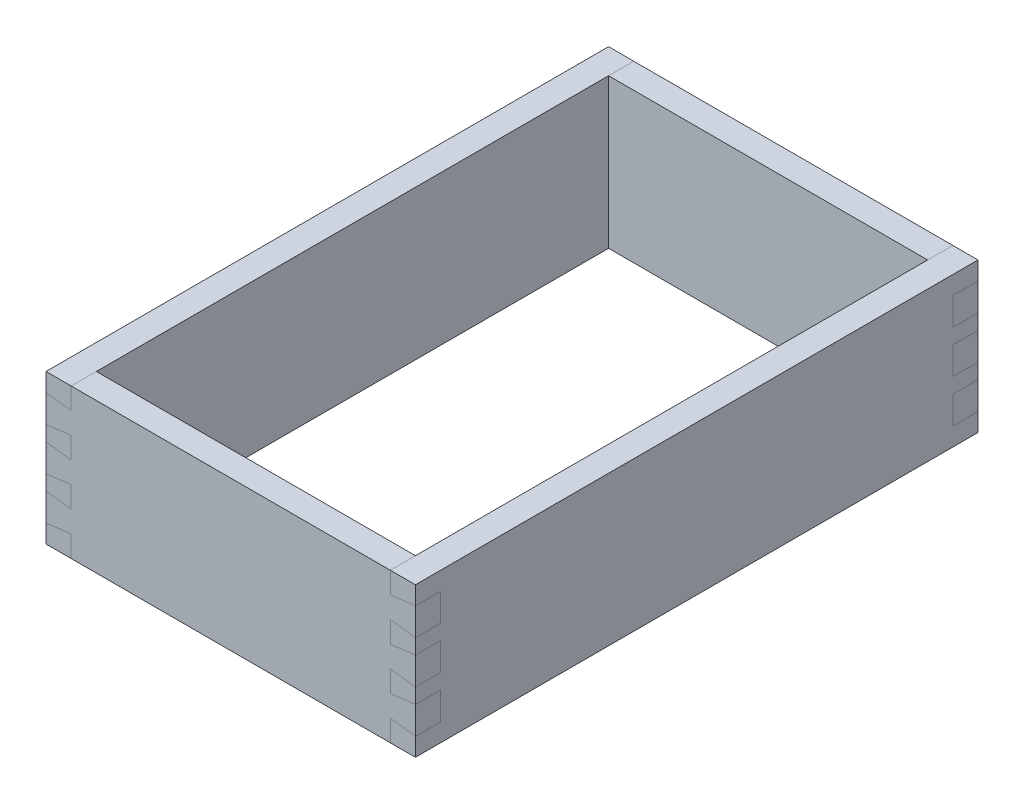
ISO-10303-21;
HEADER;
FILE_DESCRIPTION(('STEP AP214'),'2;1');
FILE_NAME('part.step','',(''),(''),'','','');
FILE_SCHEMA(('AUTOMOTIVE_DESIGN { 1 0 10303 214 1 1 1 1 }'));
ENDSEC;
DATA;
#1=APPLICATION_CONTEXT('core data for automotive mechanical design processes');
#2=APPLICATION_PROTOCOL_DEFINITION('international standard','automotive_design',2000,#1);
#3=PRODUCT_CONTEXT('',#1,'mechanical');
#4=PRODUCT('Part','Part','',(#3));
#5=PRODUCT_RELATED_PRODUCT_CATEGORY('part','',(#4));
#6=PRODUCT_DEFINITION_FORMATION('','',#4);
#7=PRODUCT_DEFINITION_CONTEXT('part definition',#1,'design');
#8=PRODUCT_DEFINITION('design','',#6,#7);
#9=PRODUCT_DEFINITION_SHAPE('','',#8);
#10=(LENGTH_UNIT() NAMED_UNIT(*) SI_UNIT(.MILLI.,.METRE.));
#11=(NAMED_UNIT(*) PLANE_ANGLE_UNIT() SI_UNIT($,.RADIAN.));
#12=(NAMED_UNIT(*) SI_UNIT($,.STERADIAN.) SOLID_ANGLE_UNIT());
#13=UNCERTAINTY_MEASURE_WITH_UNIT(LENGTH_MEASURE(1.E-05),#10,'distance_accuracy_value','');
#14=(GEOMETRIC_REPRESENTATION_CONTEXT(3) GLOBAL_UNCERTAINTY_ASSIGNED_CONTEXT((#13)) GLOBAL_UNIT_ASSIGNED_CONTEXT((#10,
#11,#12)) REPRESENTATION_CONTEXT('',''));
#15=CARTESIAN_POINT('',(0.,0.,0.));
#16=DIRECTION('',(0.,0.,1.));
#17=DIRECTION('',(1.,0.,0.));
#18=AXIS2_PLACEMENT_3D('',#15,#16,#17);
#19=CARTESIAN_POINT('',(0.,0.,-305.));
#20=DIRECTION('',(0.,0.,-1.));
#21=DIRECTION('',(-1.,0.,0.));
#22=AXIS2_PLACEMENT_3D('',#19,#20,#21);
#23=PLANE('',#22);
#24=DIRECTION('',(0.992277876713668,0.124034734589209,0.));
#25=VECTOR('',#24,1.);
#26=CARTESIAN_POINT('',(-7.92747252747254,63.4197802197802,-305.));
#27=LINE('',#26,#25);
#28=CARTESIAN_POINT('',(95.,76.2857142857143,-305.));
#29=VERTEX_POINT('',#28);
#30=CARTESIAN_POINT('',(110.,78.1607142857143,-305.));
#31=VERTEX_POINT('',#30);
#32=EDGE_CURVE('E12',#29,#31,#27,.T.);
#33=ORIENTED_EDGE('',*,*,#32,.F.);
#34=DIRECTION('',(0.,-1.,0.));
#35=VECTOR('',#34,1.);
#36=CARTESIAN_POINT('',(95.,89.,-305.));
#37=LINE('',#36,#35);
#38=CARTESIAN_POINT('',(95.,89.,-305.));
#39=VERTEX_POINT('',#38);
#40=EDGE_CURVE('E359',#39,#29,#37,.T.);
#41=ORIENTED_EDGE('',*,*,#40,.F.);
#42=DIRECTION('',(1.,0.,0.));
#43=VECTOR('',#42,1.);
#44=CARTESIAN_POINT('',(0.,89.,-305.));
#45=LINE('',#44,#43);
#46=CARTESIAN_POINT('',(-95.,89.,-305.));
#47=VERTEX_POINT('',#46);
#48=EDGE_CURVE('E349',#47,#39,#45,.T.);
#49=ORIENTED_EDGE('',*,*,#48,.F.);
#50=DIRECTION('',(0.,-1.,0.));
#51=VECTOR('',#50,1.);
#52=CARTESIAN_POINT('',(-95.,89.,-305.));
#53=LINE('',#52,#51);
#54=CARTESIAN_POINT('',(-95.,76.2857142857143,-305.));
#55=VERTEX_POINT('',#54);
#56=EDGE_CURVE('E257',#47,#55,#53,.T.);
#57=ORIENTED_EDGE('',*,*,#56,.T.);
#58=DIRECTION('',(-0.992277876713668,0.124034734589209,0.));
#59=VECTOR('',#58,1.);
#60=CARTESIAN_POINT('',(7.92747252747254,63.4197802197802,-305.));
#61=LINE('',#60,#59);
#62=CARTESIAN_POINT('',(-110.,78.1607142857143,-305.));
#63=VERTEX_POINT('',#62);
#64=EDGE_CURVE('E341',#55,#63,#61,.T.);
#65=ORIENTED_EDGE('',*,*,#64,.T.);
#66=DIRECTION('',(0.,-1.,0.));
#67=VECTOR('',#66,1.);
#68=CARTESIAN_POINT('',(-110.,0.,-305.));
#69=LINE('',#68,#67);
#70=CARTESIAN_POINT('',(-110.,61.6964285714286,-305.));
#71=VERTEX_POINT('',#70);
#72=EDGE_CURVE('E325',#63,#71,#69,.T.);
#73=ORIENTED_EDGE('',*,*,#72,.T.);
#74=DIRECTION('',(-0.992277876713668,-0.124034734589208,0.));
#75=VECTOR('',#74,1.);
#76=CARTESIAN_POINT('',(-9.28571428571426,74.2857142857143,-305.));
#77=LINE('',#76,#75);
#78=CARTESIAN_POINT('',(-95.,63.5714285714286,-305.));
#79=VERTEX_POINT('',#78);
#80=EDGE_CURVE('E324',#79,#71,#77,.T.);
#81=ORIENTED_EDGE('',*,*,#80,.F.);
#82=CARTESIAN_POINT('',(-95.,50.8571428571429,-305.));
#83=VERTEX_POINT('',#82);
#84=EDGE_CURVE('E871',#79,#83,#53,.T.);
#85=ORIENTED_EDGE('',*,*,#84,.T.);
#86=DIRECTION('',(0.992277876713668,-0.12403473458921,0.));
#87=VECTOR('',#86,1.);
#88=CARTESIAN_POINT('',(4.79780219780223,38.3824175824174,-305.));
#89=LINE('',#88,#87);
#90=CARTESIAN_POINT('',(-110.,52.7321428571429,-305.));
#91=VERTEX_POINT('',#90);
#92=EDGE_CURVE('E313',#91,#83,#89,.T.);
#93=ORIENTED_EDGE('',*,*,#92,.F.);
#94=DIRECTION('',(0.,-1.,0.));
#95=VECTOR('',#94,1.);
#96=CARTESIAN_POINT('',(-110.,0.,-305.));
#97=LINE('',#96,#95);
#98=CARTESIAN_POINT('',(-110.,36.2678571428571,-305.));
#99=VERTEX_POINT('',#98);
#100=EDGE_CURVE('E311',#91,#99,#97,.T.);
#101=ORIENTED_EDGE('',*,*,#100,.T.);
#102=DIRECTION('',(0.992277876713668,0.124034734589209,0.));
#103=VECTOR('',#102,1.);
#104=CARTESIAN_POINT('',(-6.15604395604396,49.2483516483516,-305.));
#105=LINE('',#104,#103);
#106=CARTESIAN_POINT('',(-95.,38.1428571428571,-305.));
#107=VERTEX_POINT('',#106);
#108=EDGE_CURVE('E309',#99,#107,#105,.T.);
#109=ORIENTED_EDGE('',*,*,#108,.T.);
#110=CARTESIAN_POINT('',(-95.,25.4285714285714,-305.));
#111=VERTEX_POINT('',#110);
#112=EDGE_CURVE('E292',#107,#111,#53,.T.);
#113=ORIENTED_EDGE('',*,*,#112,.T.);
#114=DIRECTION('',(-0.992277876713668,0.124034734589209,0.));
#115=VECTOR('',#114,1.);
#116=CARTESIAN_POINT('',(1.66813186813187,13.3450549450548,-305.));
#117=LINE('',#116,#115);
#118=CARTESIAN_POINT('',(-110.,27.3035714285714,-305.));
#119=VERTEX_POINT('',#118);
#120=EDGE_CURVE('E315',#111,#119,#117,.T.);
#121=ORIENTED_EDGE('',*,*,#120,.T.);
#122=DIRECTION('',(0.,-1.,0.));
#123=VECTOR('',#122,1.);
#124=CARTESIAN_POINT('',(-110.,0.,-305.));
#125=LINE('',#124,#123);
#126=CARTESIAN_POINT('',(-110.,10.8392857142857,-305.));
#127=VERTEX_POINT('',#126);
#128=EDGE_CURVE('E878',#119,#127,#125,.T.);
#129=ORIENTED_EDGE('',*,*,#128,.T.);
#130=DIRECTION('',(-0.992277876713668,-0.124034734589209,0.));
#131=VECTOR('',#130,1.);
#132=CARTESIAN_POINT('',(-3.02637362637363,24.210989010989,-305.));
#133=LINE('',#132,#131);
#134=CARTESIAN_POINT('',(-95.,12.7142857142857,-305.));
#135=VERTEX_POINT('',#134);
#136=EDGE_CURVE('E879',#135,#127,#133,.T.);
#137=ORIENTED_EDGE('',*,*,#136,.F.);
#138=CARTESIAN_POINT('',(-95.,0.,-305.));
#139=VERTEX_POINT('',#138);
#140=EDGE_CURVE('E273',#135,#139,#53,.T.);
#141=ORIENTED_EDGE('',*,*,#140,.T.);
#142=DIRECTION('',(-1.,0.,0.));
#143=VECTOR('',#142,1.);
#144=CARTESIAN_POINT('',(0.,0.,-305.));
#145=LINE('',#144,#143);
#146=CARTESIAN_POINT('',(95.,0.,-305.));
#147=VERTEX_POINT('',#146);
#148=EDGE_CURVE('E249',#147,#139,#145,.T.);
#149=ORIENTED_EDGE('',*,*,#148,.F.);
#150=CARTESIAN_POINT('',(95.,12.7142857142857,-305.));
#151=VERTEX_POINT('',#150);
#152=EDGE_CURVE('E361',#151,#147,#37,.T.);
#153=ORIENTED_EDGE('',*,*,#152,.F.);
#154=DIRECTION('',(0.992277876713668,-0.124034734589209,0.));
#155=VECTOR('',#154,1.);
#156=CARTESIAN_POINT('',(3.02637362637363,24.210989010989,-305.));
#157=LINE('',#156,#155);
#158=CARTESIAN_POINT('',(110.,10.8392857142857,-305.));
#159=VERTEX_POINT('',#158);
#160=EDGE_CURVE('E369',#151,#159,#157,.T.);
#161=ORIENTED_EDGE('',*,*,#160,.T.);
#162=DIRECTION('',(0.,-1.,0.));
#163=VECTOR('',#162,1.);
#164=CARTESIAN_POINT('',(110.,0.,-305.));
#165=LINE('',#164,#163);
#166=CARTESIAN_POINT('',(110.,27.3035714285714,-305.));
#167=VERTEX_POINT('',#166);
#168=EDGE_CURVE('E368',#167,#159,#165,.T.);
#169=ORIENTED_EDGE('',*,*,#168,.F.);
#170=DIRECTION('',(0.992277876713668,0.124034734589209,0.));
#171=VECTOR('',#170,1.);
#172=CARTESIAN_POINT('',(-1.66813186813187,13.3450549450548,-305.));
#173=LINE('',#172,#171);
#174=CARTESIAN_POINT('',(95.,25.4285714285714,-305.));
#175=VERTEX_POINT('',#174);
#176=EDGE_CURVE('E372',#175,#167,#173,.T.);
#177=ORIENTED_EDGE('',*,*,#176,.F.);
#178=CARTESIAN_POINT('',(95.,38.1428571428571,-305.));
#179=VERTEX_POINT('',#178);
#180=EDGE_CURVE('E835',#179,#175,#37,.T.);
#181=ORIENTED_EDGE('',*,*,#180,.F.);
#182=DIRECTION('',(-0.992277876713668,0.124034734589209,0.));
#183=VECTOR('',#182,1.);
#184=CARTESIAN_POINT('',(6.15604395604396,49.2483516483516,-305.));
#185=LINE('',#184,#183);
#186=CARTESIAN_POINT('',(110.,36.2678571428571,-305.));
#187=VERTEX_POINT('',#186);
#188=EDGE_CURVE('E395',#187,#179,#185,.T.);
#189=ORIENTED_EDGE('',*,*,#188,.F.);
#190=DIRECTION('',(0.,-1.,0.));
#191=VECTOR('',#190,1.);
#192=CARTESIAN_POINT('',(110.,0.,-305.));
#193=LINE('',#192,#191);
#194=CARTESIAN_POINT('',(110.,52.7321428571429,-305.));
#195=VERTEX_POINT('',#194);
#196=EDGE_CURVE('E394',#195,#187,#193,.T.);
#197=ORIENTED_EDGE('',*,*,#196,.F.);
#198=DIRECTION('',(-0.992277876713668,-0.12403473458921,0.));
#199=VECTOR('',#198,1.);
#200=CARTESIAN_POINT('',(-4.79780219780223,38.3824175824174,-305.));
#201=LINE('',#200,#199);
#202=CARTESIAN_POINT('',(95.,50.8571428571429,-305.));
#203=VERTEX_POINT('',#202);
#204=EDGE_CURVE('E381',#195,#203,#201,.T.);
#205=ORIENTED_EDGE('',*,*,#204,.T.);
#206=CARTESIAN_POINT('',(95.,63.5714285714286,-305.));
#207=VERTEX_POINT('',#206);
#208=EDGE_CURVE('E364',#207,#203,#37,.T.);
#209=ORIENTED_EDGE('',*,*,#208,.F.);
#210=DIRECTION('',(0.992277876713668,-0.124034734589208,0.));
#211=VECTOR('',#210,1.);
#212=CARTESIAN_POINT('',(9.28571428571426,74.2857142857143,-305.));
#213=LINE('',#212,#211);
#214=CARTESIAN_POINT('',(110.,61.6964285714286,-305.));
#215=VERTEX_POINT('',#214);
#216=EDGE_CURVE('E60',#207,#215,#213,.T.);
#217=ORIENTED_EDGE('',*,*,#216,.T.);
#218=DIRECTION('',(0.,-1.,0.));
#219=VECTOR('',#218,1.);
#220=CARTESIAN_POINT('',(110.,0.,-305.));
#221=LINE('',#220,#219);
#222=EDGE_CURVE('E417',#31,#215,#221,.T.);
#223=ORIENTED_EDGE('',*,*,#222,.F.);
#224=EDGE_LOOP('',(#33,#41,#49,#57,#65,#73,#81,#85,#93,#101,#109,#113,#121,#129,#137,#141,#149,
#153,#161,#169,#177,#181,#189,#197,#205,#209,#217,#223));
#225=FACE_BOUND('',#224,.T.);
#226=ADVANCED_FACE('F52',(#225),#23,.F.);
#227=CARTESIAN_POINT('',(-7.92747252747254,63.4197802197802,-305.));
#228=DIRECTION('',(-0.124034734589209,0.992277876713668,0.));
#229=DIRECTION('',(0.992277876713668,0.124034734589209,0.));
#230=AXIS2_PLACEMENT_3D('',#227,#228,#229);
#231=PLANE('',#230);
#232=DIRECTION('',(0.992277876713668,0.124034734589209,0.));
#233=VECTOR('',#232,1.);
#234=CARTESIAN_POINT('',(-7.92747252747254,63.4197802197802,-320.));
#235=LINE('',#234,#233);
#236=CARTESIAN_POINT('',(95.,76.2857142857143,-320.));
#237=VERTEX_POINT('',#236);
#238=CARTESIAN_POINT('',(110.,78.1607142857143,-320.));
#239=VERTEX_POINT('',#238);
#240=EDGE_CURVE('E423',#237,#239,#235,.T.);
#241=ORIENTED_EDGE('',*,*,#240,.F.);
#242=DIRECTION('',(0.,0.,-1.));
#243=VECTOR('',#242,1.);
#244=CARTESIAN_POINT('',(95.,76.2857142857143,-305.));
#245=LINE('',#244,#243);
#246=EDGE_CURVE('E55',#29,#237,#245,.T.);
#247=ORIENTED_EDGE('',*,*,#246,.F.);
#248=ORIENTED_EDGE('',*,*,#32,.T.);
#249=DIRECTION('',(0.,0.,-1.));
#250=VECTOR('',#249,1.);
#251=CARTESIAN_POINT('',(110.,78.1607142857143,-305.));
#252=LINE('',#251,#250);
#253=EDGE_CURVE('E75',#31,#239,#252,.T.);
#254=ORIENTED_EDGE('',*,*,#253,.T.);
#255=EDGE_LOOP('',(#241,#247,#248,#254));
#256=FACE_BOUND('',#255,.T.);
#257=ADVANCED_FACE('F445',(#256),#231,.T.);
#258=CARTESIAN_POINT('',(9.28571428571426,74.2857142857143,-305.));
#259=DIRECTION('',(0.124034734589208,0.992277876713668,0.));
#260=DIRECTION('',(0.992277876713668,-0.124034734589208,0.));
#261=AXIS2_PLACEMENT_3D('',#258,#259,#260);
#262=PLANE('',#261);
#263=DIRECTION('',(0.992277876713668,-0.124034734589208,0.));
#264=VECTOR('',#263,1.);
#265=CARTESIAN_POINT('',(9.28571428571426,74.2857142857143,-320.));
#266=LINE('',#265,#264);
#267=CARTESIAN_POINT('',(95.,63.5714285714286,-320.));
#268=VERTEX_POINT('',#267);
#269=CARTESIAN_POINT('',(110.,61.6964285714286,-320.));
#270=VERTEX_POINT('',#269);
#271=EDGE_CURVE('E420',#268,#270,#266,.T.);
#272=ORIENTED_EDGE('',*,*,#271,.T.);
#273=DIRECTION('',(0.,0.,-1.));
#274=VECTOR('',#273,1.);
#275=CARTESIAN_POINT('',(110.,61.6964285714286,-305.));
#276=LINE('',#275,#274);
#277=EDGE_CURVE('E426',#215,#270,#276,.T.);
#278=ORIENTED_EDGE('',*,*,#277,.F.);
#279=ORIENTED_EDGE('',*,*,#216,.F.);
#280=DIRECTION('',(0.,0.,-1.));
#281=VECTOR('',#280,1.);
#282=CARTESIAN_POINT('',(95.,63.5714285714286,-305.));
#283=LINE('',#282,#281);
#284=EDGE_CURVE('E419',#207,#268,#283,.T.);
#285=ORIENTED_EDGE('',*,*,#284,.T.);
#286=EDGE_LOOP('',(#272,#278,#279,#285));
#287=FACE_BOUND('',#286,.T.);
#288=ADVANCED_FACE('F432',(#287),#262,.F.);
#289=CARTESIAN_POINT('',(0.,0.,-320.));
#290=DIRECTION('',(0.,0.,1.));
#291=DIRECTION('',(1.,0.,0.));
#292=AXIS2_PLACEMENT_3D('',#289,#290,#291);
#293=PLANE('',#292);
#294=ORIENTED_EDGE('',*,*,#271,.F.);
#295=DIRECTION('',(0.,1.,0.));
#296=VECTOR('',#295,1.);
#297=CARTESIAN_POINT('',(95.,89.,-320.));
#298=LINE('',#297,#296);
#299=CARTESIAN_POINT('',(95.,50.8571428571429,-320.));
#300=VERTEX_POINT('',#299);
#301=EDGE_CURVE('E438',#300,#268,#298,.T.);
#302=ORIENTED_EDGE('',*,*,#301,.F.);
#303=DIRECTION('',(-0.992277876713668,-0.12403473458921,0.));
#304=VECTOR('',#303,1.);
#305=CARTESIAN_POINT('',(-4.79780219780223,38.3824175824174,-320.));
#306=LINE('',#305,#304);
#307=CARTESIAN_POINT('',(110.,52.7321428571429,-320.));
#308=VERTEX_POINT('',#307);
#309=EDGE_CURVE('E401',#308,#300,#306,.T.);
#310=ORIENTED_EDGE('',*,*,#309,.F.);
#311=DIRECTION('',(0.,-1.,0.));
#312=VECTOR('',#311,1.);
#313=CARTESIAN_POINT('',(110.,89.,-320.));
#314=LINE('',#313,#312);
#315=CARTESIAN_POINT('',(110.,36.2678571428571,-320.));
#316=VERTEX_POINT('',#315);
#317=EDGE_CURVE('E391',#308,#316,#314,.T.);
#318=ORIENTED_EDGE('',*,*,#317,.T.);
#319=DIRECTION('',(-0.992277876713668,0.124034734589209,0.));
#320=VECTOR('',#319,1.);
#321=CARTESIAN_POINT('',(6.15604395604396,49.2483516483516,-320.));
#322=LINE('',#321,#320);
#323=CARTESIAN_POINT('',(95.,38.1428571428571,-320.));
#324=VERTEX_POINT('',#323);
#325=EDGE_CURVE('E398',#316,#324,#322,.T.);
#326=ORIENTED_EDGE('',*,*,#325,.T.);
#327=CARTESIAN_POINT('',(95.,25.4285714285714,-320.));
#328=VERTEX_POINT('',#327);
#329=EDGE_CURVE('E357',#328,#324,#298,.T.);
#330=ORIENTED_EDGE('',*,*,#329,.F.);
#331=DIRECTION('',(0.992277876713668,0.124034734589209,0.));
#332=VECTOR('',#331,1.);
#333=CARTESIAN_POINT('',(-1.66813186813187,13.3450549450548,-320.));
#334=LINE('',#333,#332);
#335=CARTESIAN_POINT('',(110.,27.3035714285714,-320.));
#336=VERTEX_POINT('',#335);
#337=EDGE_CURVE('E375',#328,#336,#334,.T.);
#338=ORIENTED_EDGE('',*,*,#337,.T.);
#339=DIRECTION('',(0.,-1.,0.));
#340=VECTOR('',#339,1.);
#341=CARTESIAN_POINT('',(110.,89.,-320.));
#342=LINE('',#341,#340);
#343=CARTESIAN_POINT('',(110.,10.8392857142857,-320.));
#344=VERTEX_POINT('',#343);
#345=EDGE_CURVE('E367',#336,#344,#342,.T.);
#346=ORIENTED_EDGE('',*,*,#345,.T.);
#347=DIRECTION('',(0.992277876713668,-0.124034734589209,0.));
#348=VECTOR('',#347,1.);
#349=CARTESIAN_POINT('',(3.02637362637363,24.210989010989,-320.));
#350=LINE('',#349,#348);
#351=CARTESIAN_POINT('',(95.,12.7142857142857,-320.));
#352=VERTEX_POINT('',#351);
#353=EDGE_CURVE('E378',#352,#344,#350,.T.);
#354=ORIENTED_EDGE('',*,*,#353,.F.);
#355=CARTESIAN_POINT('',(95.,0.,-320.));
#356=VERTEX_POINT('',#355);
#357=EDGE_CURVE('E353',#356,#352,#298,.T.);
#358=ORIENTED_EDGE('',*,*,#357,.F.);
#359=DIRECTION('',(-1.,0.,0.));
#360=VECTOR('',#359,1.);
#361=CARTESIAN_POINT('',(0.,0.,-320.));
#362=LINE('',#361,#360);
#363=CARTESIAN_POINT('',(-95.,0.,-320.));
#364=VERTEX_POINT('',#363);
#365=EDGE_CURVE('E250',#356,#364,#362,.T.);
#366=ORIENTED_EDGE('',*,*,#365,.T.);
#367=DIRECTION('',(0.,1.,0.));
#368=VECTOR('',#367,1.);
#369=CARTESIAN_POINT('',(-95.,89.,-320.));
#370=LINE('',#369,#368);
#371=CARTESIAN_POINT('',(-95.,12.7142857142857,-320.));
#372=VERTEX_POINT('',#371);
#373=EDGE_CURVE('E266',#364,#372,#370,.T.);
#374=ORIENTED_EDGE('',*,*,#373,.T.);
#375=DIRECTION('',(-0.992277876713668,-0.124034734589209,0.));
#376=VECTOR('',#375,1.);
#377=CARTESIAN_POINT('',(-3.02637362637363,24.210989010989,-320.));
#378=LINE('',#377,#376);
#379=CARTESIAN_POINT('',(-110.,10.8392857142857,-320.));
#380=VERTEX_POINT('',#379);
#381=EDGE_CURVE('E854',#372,#380,#378,.T.);
#382=ORIENTED_EDGE('',*,*,#381,.T.);
#383=DIRECTION('',(0.,-1.,0.));
#384=VECTOR('',#383,1.);
#385=CARTESIAN_POINT('',(-110.,89.,-320.));
#386=LINE('',#385,#384);
#387=CARTESIAN_POINT('',(-110.,27.3035714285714,-320.));
#388=VERTEX_POINT('',#387);
#389=EDGE_CURVE('E861',#388,#380,#386,.T.);
#390=ORIENTED_EDGE('',*,*,#389,.F.);
#391=DIRECTION('',(-0.992277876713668,0.124034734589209,0.));
#392=VECTOR('',#391,1.);
#393=CARTESIAN_POINT('',(1.66813186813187,13.3450549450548,-320.));
#394=LINE('',#393,#392);
#395=CARTESIAN_POINT('',(-95.,25.4285714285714,-320.));
#396=VERTEX_POINT('',#395);
#397=EDGE_CURVE('E284',#396,#388,#394,.T.);
#398=ORIENTED_EDGE('',*,*,#397,.F.);
#399=CARTESIAN_POINT('',(-95.,38.1428571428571,-320.));
#400=VERTEX_POINT('',#399);
#401=EDGE_CURVE('E267',#396,#400,#370,.T.);
#402=ORIENTED_EDGE('',*,*,#401,.T.);
#403=DIRECTION('',(0.992277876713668,0.124034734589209,0.));
#404=VECTOR('',#403,1.);
#405=CARTESIAN_POINT('',(-6.15604395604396,49.2483516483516,-320.));
#406=LINE('',#405,#404);
#407=CARTESIAN_POINT('',(-110.,36.2678571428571,-320.));
#408=VERTEX_POINT('',#407);
#409=EDGE_CURVE('E281',#408,#400,#406,.T.);
#410=ORIENTED_EDGE('',*,*,#409,.F.);
#411=DIRECTION('',(0.,-1.,0.));
#412=VECTOR('',#411,1.);
#413=CARTESIAN_POINT('',(-110.,89.,-320.));
#414=LINE('',#413,#412);
#415=CARTESIAN_POINT('',(-110.,52.7321428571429,-320.));
#416=VERTEX_POINT('',#415);
#417=EDGE_CURVE('E321',#416,#408,#414,.T.);
#418=ORIENTED_EDGE('',*,*,#417,.F.);
#419=DIRECTION('',(0.992277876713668,-0.12403473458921,0.));
#420=VECTOR('',#419,1.);
#421=CARTESIAN_POINT('',(4.79780219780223,38.3824175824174,-320.));
#422=LINE('',#421,#420);
#423=CARTESIAN_POINT('',(-95.,50.8571428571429,-320.));
#424=VERTEX_POINT('',#423);
#425=EDGE_CURVE('E297',#416,#424,#422,.T.);
#426=ORIENTED_EDGE('',*,*,#425,.T.);
#427=CARTESIAN_POINT('',(-95.,63.5714285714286,-320.));
#428=VERTEX_POINT('',#427);
#429=EDGE_CURVE('E264',#424,#428,#370,.T.);
#430=ORIENTED_EDGE('',*,*,#429,.T.);
#431=DIRECTION('',(-0.992277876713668,-0.124034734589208,0.));
#432=VECTOR('',#431,1.);
#433=CARTESIAN_POINT('',(-9.28571428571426,74.2857142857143,-320.));
#434=LINE('',#433,#432);
#435=CARTESIAN_POINT('',(-110.,61.6964285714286,-320.));
#436=VERTEX_POINT('',#435);
#437=EDGE_CURVE('E329',#428,#436,#434,.T.);
#438=ORIENTED_EDGE('',*,*,#437,.T.);
#439=DIRECTION('',(0.,-1.,0.));
#440=VECTOR('',#439,1.);
#441=CARTESIAN_POINT('',(-110.,89.,-320.));
#442=LINE('',#441,#440);
#443=CARTESIAN_POINT('',(-110.,78.1607142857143,-320.));
#444=VERTEX_POINT('',#443);
#445=EDGE_CURVE('E322',#444,#436,#442,.T.);
#446=ORIENTED_EDGE('',*,*,#445,.F.);
#447=DIRECTION('',(-0.992277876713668,0.124034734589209,0.));
#448=VECTOR('',#447,1.);
#449=CARTESIAN_POINT('',(7.92747252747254,63.4197802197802,-320.));
#450=LINE('',#449,#448);
#451=CARTESIAN_POINT('',(-95.,76.2857142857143,-320.));
#452=VERTEX_POINT('',#451);
#453=EDGE_CURVE('E263',#452,#444,#450,.T.);
#454=ORIENTED_EDGE('',*,*,#453,.F.);
#455=CARTESIAN_POINT('',(-95.,89.,-320.));
#456=VERTEX_POINT('',#455);
#457=EDGE_CURVE('E254',#452,#456,#370,.T.);
#458=ORIENTED_EDGE('',*,*,#457,.T.);
#459=DIRECTION('',(1.,0.,0.));
#460=VECTOR('',#459,1.);
#461=CARTESIAN_POINT('',(0.,89.,-320.));
#462=LINE('',#461,#460);
#463=CARTESIAN_POINT('',(95.,89.,-320.));
#464=VERTEX_POINT('',#463);
#465=EDGE_CURVE('E240',#456,#464,#462,.T.);
#466=ORIENTED_EDGE('',*,*,#465,.T.);
#467=EDGE_CURVE('E344',#237,#464,#298,.T.);
#468=ORIENTED_EDGE('',*,*,#467,.F.);
#469=ORIENTED_EDGE('',*,*,#240,.T.);
#470=DIRECTION('',(0.,-1.,0.));
#471=VECTOR('',#470,1.);
#472=CARTESIAN_POINT('',(110.,89.,-320.));
#473=LINE('',#472,#471);
#474=EDGE_CURVE('E68',#239,#270,#473,.T.);
#475=ORIENTED_EDGE('',*,*,#474,.T.);
#476=EDGE_LOOP('',(#294,#302,#310,#318,#326,#330,#338,#346,#354,#358,#366,#374,#382,#390,#398,
#402,#410,#418,#426,#430,#438,#446,#454,#458,#466,#468,#469,#475));
#477=FACE_BOUND('',#476,.T.);
#478=ADVANCED_FACE('F261',(#477),#293,.F.);
#479=CARTESIAN_POINT('',(110.,89.,-152.5));
#480=DIRECTION('',(1.,0.,0.));
#481=DIRECTION('',(0.,-1.,0.));
#482=AXIS2_PLACEMENT_3D('',#479,#480,#481);
#483=PLANE('',#482);
#484=ORIENTED_EDGE('',*,*,#222,.T.);
#485=ORIENTED_EDGE('',*,*,#277,.T.);
#486=ORIENTED_EDGE('',*,*,#474,.F.);
#487=ORIENTED_EDGE('',*,*,#253,.F.);
#488=EDGE_LOOP('',(#484,#485,#486,#487));
#489=FACE_BOUND('',#488,.T.);
#490=ADVANCED_FACE('F449',(#489),#483,.T.);
#491=CARTESIAN_POINT('',(95.,89.,-152.5));
#492=DIRECTION('',(-1.,0.,0.));
#493=DIRECTION('',(0.,1.,0.));
#494=AXIS2_PLACEMENT_3D('',#491,#492,#493);
#495=PLANE('',#494);
#496=ORIENTED_EDGE('',*,*,#301,.T.);
#497=ORIENTED_EDGE('',*,*,#284,.F.);
#498=ORIENTED_EDGE('',*,*,#208,.T.);
#499=DIRECTION('',(0.,0.,-1.));
#500=VECTOR('',#499,1.);
#501=CARTESIAN_POINT('',(95.,50.8571428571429,-305.));
#502=LINE('',#501,#500);
#503=EDGE_CURVE('E402',#203,#300,#502,.T.);
#504=ORIENTED_EDGE('',*,*,#503,.T.);
#505=EDGE_LOOP('',(#496,#497,#498,#504));
#506=FACE_BOUND('',#505,.T.);
#507=ADVANCED_FACE('F451',(#506),#495,.F.);
#508=CARTESIAN_POINT('',(-4.79780219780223,38.3824175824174,-305.));
#509=DIRECTION('',(0.12403473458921,-0.992277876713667,0.));
#510=DIRECTION('',(-0.992277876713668,-0.12403473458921,0.));
#511=AXIS2_PLACEMENT_3D('',#508,#509,#510);
#512=PLANE('',#511);
#513=ORIENTED_EDGE('',*,*,#309,.T.);
#514=ORIENTED_EDGE('',*,*,#503,.F.);
#515=ORIENTED_EDGE('',*,*,#204,.F.);
#516=DIRECTION('',(0.,0.,-1.));
#517=VECTOR('',#516,1.);
#518=CARTESIAN_POINT('',(110.,52.7321428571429,-305.));
#519=LINE('',#518,#517);
#520=EDGE_CURVE('E407',#195,#308,#519,.T.);
#521=ORIENTED_EDGE('',*,*,#520,.T.);
#522=EDGE_LOOP('',(#513,#514,#515,#521));
#523=FACE_BOUND('',#522,.T.);
#524=ADVANCED_FACE('F457',(#523),#512,.F.);
#525=CARTESIAN_POINT('',(6.15604395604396,49.2483516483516,-305.));
#526=DIRECTION('',(-0.124034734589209,-0.992277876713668,0.));
#527=DIRECTION('',(-0.992277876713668,0.124034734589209,0.));
#528=AXIS2_PLACEMENT_3D('',#525,#526,#527);
#529=PLANE('',#528);
#530=ORIENTED_EDGE('',*,*,#325,.F.);
#531=DIRECTION('',(0.,0.,-1.));
#532=VECTOR('',#531,1.);
#533=CARTESIAN_POINT('',(110.,36.2678571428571,-305.));
#534=LINE('',#533,#532);
#535=EDGE_CURVE('E403',#187,#316,#534,.T.);
#536=ORIENTED_EDGE('',*,*,#535,.F.);
#537=ORIENTED_EDGE('',*,*,#188,.T.);
#538=DIRECTION('',(0.,0.,-1.));
#539=VECTOR('',#538,1.);
#540=CARTESIAN_POINT('',(95.,38.1428571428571,-305.));
#541=LINE('',#540,#539);
#542=EDGE_CURVE('E405',#179,#324,#541,.T.);
#543=ORIENTED_EDGE('',*,*,#542,.T.);
#544=EDGE_LOOP('',(#530,#536,#537,#543));
#545=FACE_BOUND('',#544,.T.);
#546=ADVANCED_FACE('F472',(#545),#529,.T.);
#547=CARTESIAN_POINT('',(110.,89.,-152.5));
#548=DIRECTION('',(1.,0.,0.));
#549=DIRECTION('',(0.,-1.,0.));
#550=AXIS2_PLACEMENT_3D('',#547,#548,#549);
#551=PLANE('',#550);
#552=ORIENTED_EDGE('',*,*,#196,.T.);
#553=ORIENTED_EDGE('',*,*,#535,.T.);
#554=ORIENTED_EDGE('',*,*,#317,.F.);
#555=ORIENTED_EDGE('',*,*,#520,.F.);
#556=EDGE_LOOP('',(#552,#553,#554,#555));
#557=FACE_BOUND('',#556,.T.);
#558=ADVANCED_FACE('F476',(#557),#551,.T.);
#559=ORIENTED_EDGE('',*,*,#246,.T.);
#560=ORIENTED_EDGE('',*,*,#467,.T.);
#561=DIRECTION('',(0.,0.,-1.));
#562=VECTOR('',#561,1.);
#563=CARTESIAN_POINT('',(95.,89.,-152.5));
#564=LINE('',#563,#562);
#565=EDGE_CURVE('E246',#39,#464,#564,.T.);
#566=ORIENTED_EDGE('',*,*,#565,.F.);
#567=ORIENTED_EDGE('',*,*,#40,.T.);
#568=EDGE_LOOP('',(#559,#560,#566,#567));
#569=FACE_BOUND('',#568,.T.);
#570=ADVANCED_FACE('F442',(#569),#495,.F.);
#571=CARTESIAN_POINT('',(-1.66813186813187,13.3450549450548,-305.));
#572=DIRECTION('',(-0.124034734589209,0.992277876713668,0.));
#573=DIRECTION('',(0.992277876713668,0.124034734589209,0.));
#574=AXIS2_PLACEMENT_3D('',#571,#572,#573);
#575=PLANE('',#574);
#576=ORIENTED_EDGE('',*,*,#337,.F.);
#577=DIRECTION('',(0.,0.,-1.));
#578=VECTOR('',#577,1.);
#579=CARTESIAN_POINT('',(95.,25.4285714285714,-305.));
#580=LINE('',#579,#578);
#581=EDGE_CURVE('E373',#175,#328,#580,.T.);
#582=ORIENTED_EDGE('',*,*,#581,.F.);
#583=ORIENTED_EDGE('',*,*,#176,.T.);
#584=DIRECTION('',(0.,0.,-1.));
#585=VECTOR('',#584,1.);
#586=CARTESIAN_POINT('',(110.,27.3035714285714,-305.));
#587=LINE('',#586,#585);
#588=EDGE_CURVE('E351',#167,#336,#587,.T.);
#589=ORIENTED_EDGE('',*,*,#588,.T.);
#590=EDGE_LOOP('',(#576,#582,#583,#589));
#591=FACE_BOUND('',#590,.T.);
#592=ADVANCED_FACE('F485',(#591),#575,.T.);
#593=CARTESIAN_POINT('',(3.02637362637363,24.210989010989,-305.));
#594=DIRECTION('',(0.124034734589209,0.992277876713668,0.));
#595=DIRECTION('',(0.992277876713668,-0.124034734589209,0.));
#596=AXIS2_PLACEMENT_3D('',#593,#594,#595);
#597=PLANE('',#596);
#598=ORIENTED_EDGE('',*,*,#353,.T.);
#599=DIRECTION('',(0.,0.,-1.));
#600=VECTOR('',#599,1.);
#601=CARTESIAN_POINT('',(110.,10.8392857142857,-305.));
#602=LINE('',#601,#600);
#603=EDGE_CURVE('E365',#159,#344,#602,.T.);
#604=ORIENTED_EDGE('',*,*,#603,.F.);
#605=ORIENTED_EDGE('',*,*,#160,.F.);
#606=DIRECTION('',(0.,0.,-1.));
#607=VECTOR('',#606,1.);
#608=CARTESIAN_POINT('',(95.,12.7142857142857,-305.));
#609=LINE('',#608,#607);
#610=EDGE_CURVE('E388',#151,#352,#609,.T.);
#611=ORIENTED_EDGE('',*,*,#610,.T.);
#612=EDGE_LOOP('',(#598,#604,#605,#611));
#613=FACE_BOUND('',#612,.T.);
#614=ADVANCED_FACE('F481',(#613),#597,.F.);
#615=CARTESIAN_POINT('',(110.,89.,-152.5));
#616=DIRECTION('',(1.,0.,0.));
#617=DIRECTION('',(0.,-1.,0.));
#618=AXIS2_PLACEMENT_3D('',#615,#616,#617);
#619=PLANE('',#618);
#620=ORIENTED_EDGE('',*,*,#588,.F.);
#621=ORIENTED_EDGE('',*,*,#168,.T.);
#622=ORIENTED_EDGE('',*,*,#603,.T.);
#623=ORIENTED_EDGE('',*,*,#345,.F.);
#624=EDGE_LOOP('',(#620,#621,#622,#623));
#625=FACE_BOUND('',#624,.T.);
#626=ADVANCED_FACE('F484',(#625),#619,.T.);
#627=ORIENTED_EDGE('',*,*,#542,.F.);
#628=ORIENTED_EDGE('',*,*,#180,.T.);
#629=ORIENTED_EDGE('',*,*,#581,.T.);
#630=ORIENTED_EDGE('',*,*,#329,.T.);
#631=EDGE_LOOP('',(#627,#628,#629,#630));
#632=FACE_BOUND('',#631,.T.);
#633=ADVANCED_FACE('F491',(#632),#495,.F.);
#634=ORIENTED_EDGE('',*,*,#610,.F.);
#635=ORIENTED_EDGE('',*,*,#152,.T.);
#636=DIRECTION('',(0.,0.,-1.));
#637=VECTOR('',#636,1.);
#638=CARTESIAN_POINT('',(95.,0.,-152.5));
#639=LINE('',#638,#637);
#640=EDGE_CURVE('E356',#147,#356,#639,.T.);
#641=ORIENTED_EDGE('',*,*,#640,.T.);
#642=ORIENTED_EDGE('',*,*,#357,.T.);
#643=EDGE_LOOP('',(#634,#635,#641,#642));
#644=FACE_BOUND('',#643,.T.);
#645=ADVANCED_FACE('F459',(#644),#495,.F.);
#646=CARTESIAN_POINT('',(0.,0.,-320.));
#647=DIRECTION('',(0.,1.,0.));
#648=DIRECTION('',(1.,0.,0.));
#649=AXIS2_PLACEMENT_3D('',#646,#647,#648);
#650=PLANE('',#649);
#651=ORIENTED_EDGE('',*,*,#365,.F.);
#652=ORIENTED_EDGE('',*,*,#640,.F.);
#653=ORIENTED_EDGE('',*,*,#148,.T.);
#654=DIRECTION('',(0.,0.,-1.));
#655=VECTOR('',#654,1.);
#656=CARTESIAN_POINT('',(-95.,0.,-152.5));
#657=LINE('',#656,#655);
#658=EDGE_CURVE('E269',#139,#364,#657,.T.);
#659=ORIENTED_EDGE('',*,*,#658,.T.);
#660=EDGE_LOOP('',(#651,#652,#653,#659));
#661=FACE_BOUND('',#660,.T.);
#662=ADVANCED_FACE('F495',(#661),#650,.F.);
#663=CARTESIAN_POINT('',(0.,89.,-320.));
#664=DIRECTION('',(0.,-1.,0.));
#665=DIRECTION('',(-1.,0.,0.));
#666=AXIS2_PLACEMENT_3D('',#663,#664,#665);
#667=PLANE('',#666);
#668=ORIENTED_EDGE('',*,*,#565,.T.);
#669=ORIENTED_EDGE('',*,*,#465,.F.);
#670=DIRECTION('',(0.,0.,-1.));
#671=VECTOR('',#670,1.);
#672=CARTESIAN_POINT('',(-95.,89.,-152.5));
#673=LINE('',#672,#671);
#674=EDGE_CURVE('E244',#47,#456,#673,.T.);
#675=ORIENTED_EDGE('',*,*,#674,.F.);
#676=ORIENTED_EDGE('',*,*,#48,.T.);
#677=EDGE_LOOP('',(#668,#669,#675,#676));
#678=FACE_BOUND('',#677,.T.);
#679=ADVANCED_FACE('F242',(#678),#667,.F.);
#680=CARTESIAN_POINT('',(7.92747252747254,63.4197802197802,-305.));
#681=DIRECTION('',(0.124034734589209,0.992277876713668,0.));
#682=DIRECTION('',(-0.992277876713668,0.124034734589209,0.));
#683=AXIS2_PLACEMENT_3D('',#680,#681,#682);
#684=PLANE('',#683);
#685=ORIENTED_EDGE('',*,*,#453,.T.);
#686=DIRECTION('',(0.,0.,-1.));
#687=VECTOR('',#686,1.);
#688=CARTESIAN_POINT('',(-110.,78.1607142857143,-305.));
#689=LINE('',#688,#687);
#690=EDGE_CURVE('E318',#63,#444,#689,.T.);
#691=ORIENTED_EDGE('',*,*,#690,.F.);
#692=ORIENTED_EDGE('',*,*,#64,.F.);
#693=DIRECTION('',(0.,0.,-1.));
#694=VECTOR('',#693,1.);
#695=CARTESIAN_POINT('',(-95.,76.2857142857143,-305.));
#696=LINE('',#695,#694);
#697=EDGE_CURVE('E333',#55,#452,#696,.T.);
#698=ORIENTED_EDGE('',*,*,#697,.T.);
#699=EDGE_LOOP('',(#685,#691,#692,#698));
#700=FACE_BOUND('',#699,.T.);
#701=ADVANCED_FACE('F502',(#700),#684,.T.);
#702=CARTESIAN_POINT('',(-9.28571428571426,74.2857142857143,-305.));
#703=DIRECTION('',(-0.124034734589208,0.992277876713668,0.));
#704=DIRECTION('',(-0.992277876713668,-0.124034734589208,0.));
#705=AXIS2_PLACEMENT_3D('',#702,#703,#704);
#706=PLANE('',#705);
#707=ORIENTED_EDGE('',*,*,#437,.F.);
#708=DIRECTION('',(0.,0.,-1.));
#709=VECTOR('',#708,1.);
#710=CARTESIAN_POINT('',(-95.,63.5714285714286,-305.));
#711=LINE('',#710,#709);
#712=EDGE_CURVE('E328',#79,#428,#711,.T.);
#713=ORIENTED_EDGE('',*,*,#712,.F.);
#714=ORIENTED_EDGE('',*,*,#80,.T.);
#715=DIRECTION('',(0.,0.,-1.));
#716=VECTOR('',#715,1.);
#717=CARTESIAN_POINT('',(-110.,61.6964285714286,-305.));
#718=LINE('',#717,#716);
#719=EDGE_CURVE('E336',#71,#436,#718,.T.);
#720=ORIENTED_EDGE('',*,*,#719,.T.);
#721=EDGE_LOOP('',(#707,#713,#714,#720));
#722=FACE_BOUND('',#721,.T.);
#723=ADVANCED_FACE('F507',(#722),#706,.F.);
#724=CARTESIAN_POINT('',(-110.,89.,-152.5));
#725=DIRECTION('',(-1.,0.,0.));
#726=DIRECTION('',(0.,-1.,0.));
#727=AXIS2_PLACEMENT_3D('',#724,#725,#726);
#728=PLANE('',#727);
#729=ORIENTED_EDGE('',*,*,#72,.F.);
#730=ORIENTED_EDGE('',*,*,#690,.T.);
#731=ORIENTED_EDGE('',*,*,#445,.T.);
#732=ORIENTED_EDGE('',*,*,#719,.F.);
#733=EDGE_LOOP('',(#729,#730,#731,#732));
#734=FACE_BOUND('',#733,.T.);
#735=ADVANCED_FACE('F503',(#734),#728,.T.);
#736=CARTESIAN_POINT('',(-95.,89.,-152.5));
#737=DIRECTION('',(1.,0.,0.));
#738=DIRECTION('',(0.,1.,0.));
#739=AXIS2_PLACEMENT_3D('',#736,#737,#738);
#740=PLANE('',#739);
#741=ORIENTED_EDGE('',*,*,#429,.F.);
#742=DIRECTION('',(0.,0.,-1.));
#743=VECTOR('',#742,1.);
#744=CARTESIAN_POINT('',(-95.,50.8571428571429,-305.));
#745=LINE('',#744,#743);
#746=EDGE_CURVE('E302',#83,#424,#745,.T.);
#747=ORIENTED_EDGE('',*,*,#746,.F.);
#748=ORIENTED_EDGE('',*,*,#84,.F.);
#749=ORIENTED_EDGE('',*,*,#712,.T.);
#750=EDGE_LOOP('',(#741,#747,#748,#749));
#751=FACE_BOUND('',#750,.T.);
#752=ADVANCED_FACE('F506',(#751),#740,.F.);
#753=CARTESIAN_POINT('',(4.79780219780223,38.3824175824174,-305.));
#754=DIRECTION('',(-0.12403473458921,-0.992277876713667,0.));
#755=DIRECTION('',(0.992277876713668,-0.12403473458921,0.));
#756=AXIS2_PLACEMENT_3D('',#753,#754,#755);
#757=PLANE('',#756);
#758=ORIENTED_EDGE('',*,*,#425,.F.);
#759=DIRECTION('',(0.,0.,-1.));
#760=VECTOR('',#759,1.);
#761=CARTESIAN_POINT('',(-110.,52.7321428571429,-305.));
#762=LINE('',#761,#760);
#763=EDGE_CURVE('E296',#91,#416,#762,.T.);
#764=ORIENTED_EDGE('',*,*,#763,.F.);
#765=ORIENTED_EDGE('',*,*,#92,.T.);
#766=ORIENTED_EDGE('',*,*,#746,.T.);
#767=EDGE_LOOP('',(#758,#764,#765,#766));
#768=FACE_BOUND('',#767,.T.);
#769=ADVANCED_FACE('F515',(#768),#757,.F.);
#770=CARTESIAN_POINT('',(-6.15604395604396,49.2483516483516,-305.));
#771=DIRECTION('',(0.124034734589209,-0.992277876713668,0.));
#772=DIRECTION('',(0.992277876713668,0.124034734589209,0.));
#773=AXIS2_PLACEMENT_3D('',#770,#771,#772);
#774=PLANE('',#773);
#775=ORIENTED_EDGE('',*,*,#409,.T.);
#776=DIRECTION('',(0.,0.,-1.));
#777=VECTOR('',#776,1.);
#778=CARTESIAN_POINT('',(-95.,38.1428571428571,-305.));
#779=LINE('',#778,#777);
#780=EDGE_CURVE('E290',#107,#400,#779,.T.);
#781=ORIENTED_EDGE('',*,*,#780,.F.);
#782=ORIENTED_EDGE('',*,*,#108,.F.);
#783=DIRECTION('',(0.,0.,-1.));
#784=VECTOR('',#783,1.);
#785=CARTESIAN_POINT('',(-110.,36.2678571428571,-305.));
#786=LINE('',#785,#784);
#787=EDGE_CURVE('E300',#99,#408,#786,.T.);
#788=ORIENTED_EDGE('',*,*,#787,.T.);
#789=EDGE_LOOP('',(#775,#781,#782,#788));
#790=FACE_BOUND('',#789,.T.);
#791=ADVANCED_FACE('F299',(#790),#774,.T.);
#792=CARTESIAN_POINT('',(-110.,89.,-152.5));
#793=DIRECTION('',(-1.,0.,0.));
#794=DIRECTION('',(0.,-1.,0.));
#795=AXIS2_PLACEMENT_3D('',#792,#793,#794);
#796=PLANE('',#795);
#797=ORIENTED_EDGE('',*,*,#100,.F.);
#798=ORIENTED_EDGE('',*,*,#763,.T.);
#799=ORIENTED_EDGE('',*,*,#417,.T.);
#800=ORIENTED_EDGE('',*,*,#787,.F.);
#801=EDGE_LOOP('',(#797,#798,#799,#800));
#802=FACE_BOUND('',#801,.T.);
#803=ADVANCED_FACE('F521',(#802),#796,.T.);
#804=ORIENTED_EDGE('',*,*,#697,.F.);
#805=ORIENTED_EDGE('',*,*,#56,.F.);
#806=ORIENTED_EDGE('',*,*,#674,.T.);
#807=ORIENTED_EDGE('',*,*,#457,.F.);
#808=EDGE_LOOP('',(#804,#805,#806,#807));
#809=FACE_BOUND('',#808,.T.);
#810=ADVANCED_FACE('F253',(#809),#740,.F.);
#811=CARTESIAN_POINT('',(1.66813186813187,13.3450549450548,-305.));
#812=DIRECTION('',(0.124034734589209,0.992277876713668,0.));
#813=DIRECTION('',(-0.992277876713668,0.124034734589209,0.));
#814=AXIS2_PLACEMENT_3D('',#811,#812,#813);
#815=PLANE('',#814);
#816=ORIENTED_EDGE('',*,*,#397,.T.);
#817=DIRECTION('',(0.,0.,-1.));
#818=VECTOR('',#817,1.);
#819=CARTESIAN_POINT('',(-110.,27.3035714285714,-305.));
#820=LINE('',#819,#818);
#821=EDGE_CURVE('E258',#119,#388,#820,.T.);
#822=ORIENTED_EDGE('',*,*,#821,.F.);
#823=ORIENTED_EDGE('',*,*,#120,.F.);
#824=DIRECTION('',(0.,0.,-1.));
#825=VECTOR('',#824,1.);
#826=CARTESIAN_POINT('',(-95.,25.4285714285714,-305.));
#827=LINE('',#826,#825);
#828=EDGE_CURVE('E288',#111,#396,#827,.T.);
#829=ORIENTED_EDGE('',*,*,#828,.T.);
#830=EDGE_LOOP('',(#816,#822,#823,#829));
#831=FACE_BOUND('',#830,.T.);
#832=ADVANCED_FACE('F529',(#831),#815,.T.);
#833=CARTESIAN_POINT('',(-3.02637362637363,24.210989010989,-305.));
#834=DIRECTION('',(-0.124034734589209,0.992277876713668,0.));
#835=DIRECTION('',(-0.992277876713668,-0.124034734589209,0.));
#836=AXIS2_PLACEMENT_3D('',#833,#834,#835);
#837=PLANE('',#836);
#838=ORIENTED_EDGE('',*,*,#381,.F.);
#839=DIRECTION('',(0.,0.,-1.));
#840=VECTOR('',#839,1.);
#841=CARTESIAN_POINT('',(-95.,12.7142857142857,-305.));
#842=LINE('',#841,#840);
#843=EDGE_CURVE('E851',#135,#372,#842,.T.);
#844=ORIENTED_EDGE('',*,*,#843,.F.);
#845=ORIENTED_EDGE('',*,*,#136,.T.);
#846=DIRECTION('',(0.,0.,-1.));
#847=VECTOR('',#846,1.);
#848=CARTESIAN_POINT('',(-110.,10.8392857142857,-305.));
#849=LINE('',#848,#847);
#850=EDGE_CURVE('E856',#127,#380,#849,.T.);
#851=ORIENTED_EDGE('',*,*,#850,.T.);
#852=EDGE_LOOP('',(#838,#844,#845,#851));
#853=FACE_BOUND('',#852,.T.);
#854=ADVANCED_FACE('F525',(#853),#837,.F.);
#855=CARTESIAN_POINT('',(-110.,89.,-152.5));
#856=DIRECTION('',(-1.,0.,0.));
#857=DIRECTION('',(0.,-1.,0.));
#858=AXIS2_PLACEMENT_3D('',#855,#856,#857);
#859=PLANE('',#858);
#860=ORIENTED_EDGE('',*,*,#821,.T.);
#861=ORIENTED_EDGE('',*,*,#389,.T.);
#862=ORIENTED_EDGE('',*,*,#850,.F.);
#863=ORIENTED_EDGE('',*,*,#128,.F.);
#864=EDGE_LOOP('',(#860,#861,#862,#863));
#865=FACE_BOUND('',#864,.T.);
#866=ADVANCED_FACE('F528',(#865),#859,.T.);
#867=ORIENTED_EDGE('',*,*,#780,.T.);
#868=ORIENTED_EDGE('',*,*,#401,.F.);
#869=ORIENTED_EDGE('',*,*,#828,.F.);
#870=ORIENTED_EDGE('',*,*,#112,.F.);
#871=EDGE_LOOP('',(#867,#868,#869,#870));
#872=FACE_BOUND('',#871,.T.);
#873=ADVANCED_FACE('F286',(#872),#740,.F.);
#874=ORIENTED_EDGE('',*,*,#843,.T.);
#875=ORIENTED_EDGE('',*,*,#373,.F.);
#876=ORIENTED_EDGE('',*,*,#658,.F.);
#877=ORIENTED_EDGE('',*,*,#140,.F.);
#878=EDGE_LOOP('',(#874,#875,#876,#877));
#879=FACE_BOUND('',#878,.T.);
#880=ADVANCED_FACE('F537',(#879),#740,.F.);
#881=CLOSED_SHELL('',(#226,#257,#288,#478,#490,#507,#524,#546,#558,#570,#592,#614,#626,#633,
#645,#662,#679,#701,#723,#735,#752,#769,#791,#803,#810,#832,#854,#866,#873,#880));
#882=MANIFOLD_SOLID_BREP('B2',#881);
#883=CARTESIAN_POINT('',(0.,0.,0.));
#884=DIRECTION('',(0.,0.,1.));
#885=DIRECTION('',(1.,0.,0.));
#886=AXIS2_PLACEMENT_3D('',#883,#884,#885);
#887=PLANE('',#886);
#888=DIRECTION('',(-0.992277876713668,0.124034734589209,0.));
#889=VECTOR('',#888,1.);
#890=CARTESIAN_POINT('',(7.92747252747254,63.4197802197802,0.));
#891=LINE('',#890,#889);
#892=CARTESIAN_POINT('',(-95.,76.2857142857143,0.));
#893=VERTEX_POINT('',#892);
#894=CARTESIAN_POINT('',(-110.,78.1607142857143,0.));
#895=VERTEX_POINT('',#894);
#896=EDGE_CURVE('E50',#893,#895,#891,.T.);
#897=ORIENTED_EDGE('',*,*,#896,.F.);
#898=DIRECTION('',(0.,-1.,0.));
#899=VECTOR('',#898,1.);
#900=CARTESIAN_POINT('',(-95.,89.,0.));
#901=LINE('',#900,#899);
#902=CARTESIAN_POINT('',(-95.,89.,0.));
#903=VERTEX_POINT('',#902);
#904=EDGE_CURVE('E1211',#903,#893,#901,.T.);
#905=ORIENTED_EDGE('',*,*,#904,.F.);
#906=DIRECTION('',(-1.,0.,0.));
#907=VECTOR('',#906,1.);
#908=CARTESIAN_POINT('',(0.,89.,0.));
#909=LINE('',#908,#907);
#910=CARTESIAN_POINT('',(95.,89.,0.));
#911=VERTEX_POINT('',#910);
#912=EDGE_CURVE('E1202',#911,#903,#909,.T.);
#913=ORIENTED_EDGE('',*,*,#912,.F.);
#914=DIRECTION('',(0.,-1.,0.));
#915=VECTOR('',#914,1.);
#916=CARTESIAN_POINT('',(95.,89.,0.));
#917=LINE('',#916,#915);
#918=CARTESIAN_POINT('',(95.,76.2857142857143,0.));
#919=VERTEX_POINT('',#918);
#920=EDGE_CURVE('E1109',#911,#919,#917,.T.);
#921=ORIENTED_EDGE('',*,*,#920,.T.);
#922=DIRECTION('',(0.992277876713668,0.124034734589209,0.));
#923=VECTOR('',#922,1.);
#924=CARTESIAN_POINT('',(-7.92747252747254,63.4197802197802,0.));
#925=LINE('',#924,#923);
#926=CARTESIAN_POINT('',(110.,78.1607142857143,0.));
#927=VERTEX_POINT('',#926);
#928=EDGE_CURVE('E1194',#919,#927,#925,.T.);
#929=ORIENTED_EDGE('',*,*,#928,.T.);
#930=DIRECTION('',(0.,-1.,0.));
#931=VECTOR('',#930,1.);
#932=CARTESIAN_POINT('',(110.,0.,0.));
#933=LINE('',#932,#931);
#934=CARTESIAN_POINT('',(110.,61.6964285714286,0.));
#935=VERTEX_POINT('',#934);
#936=EDGE_CURVE('E1178',#927,#935,#933,.T.);
#937=ORIENTED_EDGE('',*,*,#936,.T.);
#938=DIRECTION('',(0.992277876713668,-0.124034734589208,0.));
#939=VECTOR('',#938,1.);
#940=CARTESIAN_POINT('',(9.28571428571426,74.2857142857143,0.));
#941=LINE('',#940,#939);
#942=CARTESIAN_POINT('',(95.,63.5714285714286,0.));
#943=VERTEX_POINT('',#942);
#944=EDGE_CURVE('E1177',#943,#935,#941,.T.);
#945=ORIENTED_EDGE('',*,*,#944,.F.);
#946=CARTESIAN_POINT('',(95.,50.8571428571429,0.));
#947=VERTEX_POINT('',#946);
#948=EDGE_CURVE('E1319',#943,#947,#917,.T.);
#949=ORIENTED_EDGE('',*,*,#948,.T.);
#950=DIRECTION('',(-0.992277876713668,-0.12403473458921,0.));
#951=VECTOR('',#950,1.);
#952=CARTESIAN_POINT('',(-4.79780219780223,38.3824175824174,0.));
#953=LINE('',#952,#951);
#954=CARTESIAN_POINT('',(110.,52.7321428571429,0.));
#955=VERTEX_POINT('',#954);
#956=EDGE_CURVE('E1166',#955,#947,#953,.T.);
#957=ORIENTED_EDGE('',*,*,#956,.F.);
#958=DIRECTION('',(0.,-1.,0.));
#959=VECTOR('',#958,1.);
#960=CARTESIAN_POINT('',(110.,0.,0.));
#961=LINE('',#960,#959);
#962=CARTESIAN_POINT('',(110.,36.2678571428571,0.));
#963=VERTEX_POINT('',#962);
#964=EDGE_CURVE('E1164',#955,#963,#961,.T.);
#965=ORIENTED_EDGE('',*,*,#964,.T.);
#966=DIRECTION('',(-0.992277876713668,0.124034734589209,0.));
#967=VECTOR('',#966,1.);
#968=CARTESIAN_POINT('',(6.15604395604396,49.2483516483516,0.));
#969=LINE('',#968,#967);
#970=CARTESIAN_POINT('',(95.,38.1428571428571,0.));
#971=VERTEX_POINT('',#970);
#972=EDGE_CURVE('E1162',#963,#971,#969,.T.);
#973=ORIENTED_EDGE('',*,*,#972,.T.);
#974=CARTESIAN_POINT('',(95.,25.4285714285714,0.));
#975=VERTEX_POINT('',#974);
#976=EDGE_CURVE('E1145',#971,#975,#917,.T.);
#977=ORIENTED_EDGE('',*,*,#976,.T.);
#978=DIRECTION('',(0.992277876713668,0.124034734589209,0.));
#979=VECTOR('',#978,1.);
#980=CARTESIAN_POINT('',(-1.66813186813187,13.3450549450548,0.));
#981=LINE('',#980,#979);
#982=CARTESIAN_POINT('',(110.,27.3035714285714,0.));
#983=VERTEX_POINT('',#982);
#984=EDGE_CURVE('E1168',#975,#983,#981,.T.);
#985=ORIENTED_EDGE('',*,*,#984,.T.);
#986=DIRECTION('',(0.,-1.,0.));
#987=VECTOR('',#986,1.);
#988=CARTESIAN_POINT('',(110.,0.,0.));
#989=LINE('',#988,#987);
#990=CARTESIAN_POINT('',(110.,10.8392857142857,0.));
#991=VERTEX_POINT('',#990);
#992=EDGE_CURVE('E1347',#983,#991,#989,.T.);
#993=ORIENTED_EDGE('',*,*,#992,.T.);
#994=DIRECTION('',(0.992277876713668,-0.124034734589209,0.));
#995=VECTOR('',#994,1.);
#996=CARTESIAN_POINT('',(3.02637362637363,24.210989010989,0.));
#997=LINE('',#996,#995);
#998=CARTESIAN_POINT('',(95.,12.7142857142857,0.));
#999=VERTEX_POINT('',#998);
#1000=EDGE_CURVE('E1316',#999,#991,#997,.T.);
#1001=ORIENTED_EDGE('',*,*,#1000,.F.);
#1002=CARTESIAN_POINT('',(95.,0.,0.));
#1003=VERTEX_POINT('',#1002);
#1004=EDGE_CURVE('E1126',#999,#1003,#917,.T.);
#1005=ORIENTED_EDGE('',*,*,#1004,.T.);
#1006=DIRECTION('',(1.,0.,0.));
#1007=VECTOR('',#1006,1.);
#1008=CARTESIAN_POINT('',(0.,0.,0.));
#1009=LINE('',#1008,#1007);
#1010=CARTESIAN_POINT('',(-95.,0.,0.));
#1011=VERTEX_POINT('',#1010);
#1012=EDGE_CURVE('E1101',#1011,#1003,#1009,.T.);
#1013=ORIENTED_EDGE('',*,*,#1012,.F.);
#1014=CARTESIAN_POINT('',(-95.,12.7142857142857,0.));
#1015=VERTEX_POINT('',#1014);
#1016=EDGE_CURVE('E1214',#1015,#1011,#901,.T.);
#1017=ORIENTED_EDGE('',*,*,#1016,.F.);
#1018=DIRECTION('',(-0.992277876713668,-0.124034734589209,0.));
#1019=VECTOR('',#1018,1.);
#1020=CARTESIAN_POINT('',(-3.02637362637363,24.210989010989,0.));
#1021=LINE('',#1020,#1019);
#1022=CARTESIAN_POINT('',(-110.,10.8392857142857,0.));
#1023=VERTEX_POINT('',#1022);
#1024=EDGE_CURVE('E1221',#1015,#1023,#1021,.T.);
#1025=ORIENTED_EDGE('',*,*,#1024,.T.);
#1026=DIRECTION('',(0.,-1.,0.));
#1027=VECTOR('',#1026,1.);
#1028=CARTESIAN_POINT('',(-110.,0.,0.));
#1029=LINE('',#1028,#1027);
#1030=CARTESIAN_POINT('',(-110.,27.3035714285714,0.));
#1031=VERTEX_POINT('',#1030);
#1032=EDGE_CURVE('E1220',#1031,#1023,#1029,.T.);
#1033=ORIENTED_EDGE('',*,*,#1032,.F.);
#1034=DIRECTION('',(-0.992277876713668,0.124034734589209,0.));
#1035=VECTOR('',#1034,1.);
#1036=CARTESIAN_POINT('',(1.66813186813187,13.3450549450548,0.));
#1037=LINE('',#1036,#1035);
#1038=CARTESIAN_POINT('',(-95.,25.4285714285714,0.));
#1039=VERTEX_POINT('',#1038);
#1040=EDGE_CURVE('E1223',#1039,#1031,#1037,.T.);
#1041=ORIENTED_EDGE('',*,*,#1040,.F.);
#1042=CARTESIAN_POINT('',(-95.,38.1428571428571,0.));
#1043=VERTEX_POINT('',#1042);
#1044=EDGE_CURVE('E1297',#1043,#1039,#901,.T.);
#1045=ORIENTED_EDGE('',*,*,#1044,.F.);
#1046=DIRECTION('',(0.992277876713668,0.124034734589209,0.));
#1047=VECTOR('',#1046,1.);
#1048=CARTESIAN_POINT('',(-6.15604395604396,49.2483516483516,0.));
#1049=LINE('',#1048,#1047);
#1050=CARTESIAN_POINT('',(-110.,36.2678571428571,0.));
#1051=VERTEX_POINT('',#1050);
#1052=EDGE_CURVE('E1247',#1051,#1043,#1049,.T.);
#1053=ORIENTED_EDGE('',*,*,#1052,.F.);
#1054=DIRECTION('',(0.,-1.,0.));
#1055=VECTOR('',#1054,1.);
#1056=CARTESIAN_POINT('',(-110.,0.,0.));
#1057=LINE('',#1056,#1055);
#1058=CARTESIAN_POINT('',(-110.,52.7321428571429,0.));
#1059=VERTEX_POINT('',#1058);
#1060=EDGE_CURVE('E1246',#1059,#1051,#1057,.T.);
#1061=ORIENTED_EDGE('',*,*,#1060,.F.);
#1062=DIRECTION('',(0.992277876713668,-0.12403473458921,0.));
#1063=VECTOR('',#1062,1.);
#1064=CARTESIAN_POINT('',(4.79780219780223,38.3824175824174,0.));
#1065=LINE('',#1064,#1063);
#1066=CARTESIAN_POINT('',(-95.,50.8571428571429,0.));
#1067=VERTEX_POINT('',#1066);
#1068=EDGE_CURVE('E1231',#1059,#1067,#1065,.T.);
#1069=ORIENTED_EDGE('',*,*,#1068,.T.);
#1070=CARTESIAN_POINT('',(-95.,63.5714285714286,0.));
#1071=VERTEX_POINT('',#1070);
#1072=EDGE_CURVE('E1216',#1071,#1067,#901,.T.);
#1073=ORIENTED_EDGE('',*,*,#1072,.F.);
#1074=DIRECTION('',(-0.992277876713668,-0.124034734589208,0.));
#1075=VECTOR('',#1074,1.);
#1076=CARTESIAN_POINT('',(-9.28571428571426,74.2857142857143,0.));
#1077=LINE('',#1076,#1075);
#1078=CARTESIAN_POINT('',(-110.,61.6964285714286,0.));
#1079=VERTEX_POINT('',#1078);
#1080=EDGE_CURVE('E911',#1071,#1079,#1077,.T.);
#1081=ORIENTED_EDGE('',*,*,#1080,.T.);
#1082=DIRECTION('',(0.,-1.,0.));
#1083=VECTOR('',#1082,1.);
#1084=CARTESIAN_POINT('',(-110.,0.,0.));
#1085=LINE('',#1084,#1083);
#1086=EDGE_CURVE('E1275',#895,#1079,#1085,.T.);
#1087=ORIENTED_EDGE('',*,*,#1086,.F.);
#1088=EDGE_LOOP('',(#897,#905,#913,#921,#929,#937,#945,#949,#957,#965,#973,#977,#985,#993,#1001,
#1005,#1013,#1017,#1025,#1033,#1041,#1045,#1053,#1061,#1069,#1073,#1081,#1087));
#1089=FACE_BOUND('',#1088,.T.);
#1090=ADVANCED_FACE('F903',(#1089),#887,.F.);
#1091=CARTESIAN_POINT('',(7.92747252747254,63.4197802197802,0.));
#1092=DIRECTION('',(0.124034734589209,0.992277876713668,0.));
#1093=DIRECTION('',(-0.992277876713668,0.124034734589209,0.));
#1094=AXIS2_PLACEMENT_3D('',#1091,#1092,#1093);
#1095=PLANE('',#1094);
#1096=DIRECTION('',(-0.992277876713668,0.124034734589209,0.));
#1097=VECTOR('',#1096,1.);
#1098=CARTESIAN_POINT('',(7.92747252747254,63.4197802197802,15.));
#1099=LINE('',#1098,#1097);
#1100=CARTESIAN_POINT('',(-95.,76.2857142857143,15.));
#1101=VERTEX_POINT('',#1100);
#1102=CARTESIAN_POINT('',(-110.,78.1607142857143,15.));
#1103=VERTEX_POINT('',#1102);
#1104=EDGE_CURVE('E1280',#1101,#1103,#1099,.T.);
#1105=ORIENTED_EDGE('',*,*,#1104,.F.);
#1106=DIRECTION('',(0.,0.,1.));
#1107=VECTOR('',#1106,1.);
#1108=CARTESIAN_POINT('',(-95.,76.2857142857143,0.));
#1109=LINE('',#1108,#1107);
#1110=EDGE_CURVE('E906',#893,#1101,#1109,.T.);
#1111=ORIENTED_EDGE('',*,*,#1110,.F.);
#1112=ORIENTED_EDGE('',*,*,#896,.T.);
#1113=DIRECTION('',(0.,0.,1.));
#1114=VECTOR('',#1113,1.);
#1115=CARTESIAN_POINT('',(-110.,78.1607142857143,0.));
#1116=LINE('',#1115,#1114);
#1117=EDGE_CURVE('E1269',#895,#1103,#1116,.T.);
#1118=ORIENTED_EDGE('',*,*,#1117,.T.);
#1119=EDGE_LOOP('',(#1105,#1111,#1112,#1118));
#1120=FACE_BOUND('',#1119,.T.);
#1121=ADVANCED_FACE('F1376',(#1120),#1095,.T.);
#1122=CARTESIAN_POINT('',(-9.28571428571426,74.2857142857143,0.));
#1123=DIRECTION('',(-0.124034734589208,0.992277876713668,0.));
#1124=DIRECTION('',(-0.992277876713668,-0.124034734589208,0.));
#1125=AXIS2_PLACEMENT_3D('',#1122,#1123,#1124);
#1126=PLANE('',#1125);
#1127=DIRECTION('',(-0.992277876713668,-0.124034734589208,0.));
#1128=VECTOR('',#1127,1.);
#1129=CARTESIAN_POINT('',(-9.28571428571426,74.2857142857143,15.));
#1130=LINE('',#1129,#1128);
#1131=CARTESIAN_POINT('',(-95.,63.5714285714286,15.));
#1132=VERTEX_POINT('',#1131);
#1133=CARTESIAN_POINT('',(-110.,61.6964285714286,15.));
#1134=VERTEX_POINT('',#1133);
#1135=EDGE_CURVE('E1278',#1132,#1134,#1130,.T.);
#1136=ORIENTED_EDGE('',*,*,#1135,.T.);
#1137=DIRECTION('',(0.,0.,1.));
#1138=VECTOR('',#1137,1.);
#1139=CARTESIAN_POINT('',(-110.,61.6964285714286,0.));
#1140=LINE('',#1139,#1138);
#1141=EDGE_CURVE('E919',#1079,#1134,#1140,.T.);
#1142=ORIENTED_EDGE('',*,*,#1141,.F.);
#1143=ORIENTED_EDGE('',*,*,#1080,.F.);
#1144=DIRECTION('',(0.,0.,1.));
#1145=VECTOR('',#1144,1.);
#1146=CARTESIAN_POINT('',(-95.,63.5714285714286,0.));
#1147=LINE('',#1146,#1145);
#1148=EDGE_CURVE('E1277',#1071,#1132,#1147,.T.);
#1149=ORIENTED_EDGE('',*,*,#1148,.T.);
#1150=EDGE_LOOP('',(#1136,#1142,#1143,#1149));
#1151=FACE_BOUND('',#1150,.T.);
#1152=ADVANCED_FACE('F1288',(#1151),#1126,.F.);
#1153=CARTESIAN_POINT('',(0.,0.,15.));
#1154=DIRECTION('',(0.,0.,-1.));
#1155=DIRECTION('',(-1.,0.,0.));
#1156=AXIS2_PLACEMENT_3D('',#1153,#1154,#1155);
#1157=PLANE('',#1156);
#1158=ORIENTED_EDGE('',*,*,#1135,.F.);
#1159=DIRECTION('',(0.,1.,0.));
#1160=VECTOR('',#1159,1.);
#1161=CARTESIAN_POINT('',(-95.,89.,15.));
#1162=LINE('',#1161,#1160);
#1163=CARTESIAN_POINT('',(-95.,50.8571428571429,15.));
#1164=VERTEX_POINT('',#1163);
#1165=EDGE_CURVE('E1293',#1164,#1132,#1162,.T.);
#1166=ORIENTED_EDGE('',*,*,#1165,.F.);
#1167=DIRECTION('',(0.992277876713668,-0.12403473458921,0.));
#1168=VECTOR('',#1167,1.);
#1169=CARTESIAN_POINT('',(4.79780219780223,38.3824175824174,15.));
#1170=LINE('',#1169,#1168);
#1171=CARTESIAN_POINT('',(-110.,52.7321428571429,15.));
#1172=VERTEX_POINT('',#1171);
#1173=EDGE_CURVE('E1253',#1172,#1164,#1170,.T.);
#1174=ORIENTED_EDGE('',*,*,#1173,.F.);
#1175=DIRECTION('',(0.,-1.,0.));
#1176=VECTOR('',#1175,1.);
#1177=CARTESIAN_POINT('',(-110.,89.,15.));
#1178=LINE('',#1177,#1176);
#1179=CARTESIAN_POINT('',(-110.,36.2678571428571,15.));
#1180=VERTEX_POINT('',#1179);
#1181=EDGE_CURVE('E1243',#1172,#1180,#1178,.T.);
#1182=ORIENTED_EDGE('',*,*,#1181,.T.);
#1183=DIRECTION('',(0.992277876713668,0.124034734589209,0.));
#1184=VECTOR('',#1183,1.);
#1185=CARTESIAN_POINT('',(-6.15604395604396,49.2483516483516,15.));
#1186=LINE('',#1185,#1184);
#1187=CARTESIAN_POINT('',(-95.,38.1428571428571,15.));
#1188=VERTEX_POINT('',#1187);
#1189=EDGE_CURVE('E1250',#1180,#1188,#1186,.T.);
#1190=ORIENTED_EDGE('',*,*,#1189,.T.);
#1191=CARTESIAN_POINT('',(-95.,25.4285714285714,15.));
#1192=VERTEX_POINT('',#1191);
#1193=EDGE_CURVE('E1209',#1192,#1188,#1162,.T.);
#1194=ORIENTED_EDGE('',*,*,#1193,.F.);
#1195=DIRECTION('',(-0.992277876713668,0.124034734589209,0.));
#1196=VECTOR('',#1195,1.);
#1197=CARTESIAN_POINT('',(1.66813186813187,13.3450549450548,15.));
#1198=LINE('',#1197,#1196);
#1199=CARTESIAN_POINT('',(-110.,27.3035714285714,15.));
#1200=VERTEX_POINT('',#1199);
#1201=EDGE_CURVE('E1226',#1192,#1200,#1198,.T.);
#1202=ORIENTED_EDGE('',*,*,#1201,.T.);
#1203=DIRECTION('',(0.,-1.,0.));
#1204=VECTOR('',#1203,1.);
#1205=CARTESIAN_POINT('',(-110.,89.,15.));
#1206=LINE('',#1205,#1204);
#1207=CARTESIAN_POINT('',(-110.,10.8392857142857,15.));
#1208=VERTEX_POINT('',#1207);
#1209=EDGE_CURVE('E1219',#1200,#1208,#1206,.T.);
#1210=ORIENTED_EDGE('',*,*,#1209,.T.);
#1211=DIRECTION('',(-0.992277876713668,-0.124034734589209,0.));
#1212=VECTOR('',#1211,1.);
#1213=CARTESIAN_POINT('',(-3.02637362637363,24.210989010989,15.));
#1214=LINE('',#1213,#1212);
#1215=CARTESIAN_POINT('',(-95.,12.7142857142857,15.));
#1216=VERTEX_POINT('',#1215);
#1217=EDGE_CURVE('E1229',#1216,#1208,#1214,.T.);
#1218=ORIENTED_EDGE('',*,*,#1217,.F.);
#1219=CARTESIAN_POINT('',(-95.,0.,15.));
#1220=VERTEX_POINT('',#1219);
#1221=EDGE_CURVE('E1206',#1220,#1216,#1162,.T.);
#1222=ORIENTED_EDGE('',*,*,#1221,.F.);
#1223=DIRECTION('',(1.,0.,0.));
#1224=VECTOR('',#1223,1.);
#1225=CARTESIAN_POINT('',(0.,0.,15.));
#1226=LINE('',#1225,#1224);
#1227=CARTESIAN_POINT('',(95.,0.,15.));
#1228=VERTEX_POINT('',#1227);
#1229=EDGE_CURVE('E1102',#1220,#1228,#1226,.T.);
#1230=ORIENTED_EDGE('',*,*,#1229,.T.);
#1231=DIRECTION('',(0.,1.,0.));
#1232=VECTOR('',#1231,1.);
#1233=CARTESIAN_POINT('',(95.,89.,15.));
#1234=LINE('',#1233,#1232);
#1235=CARTESIAN_POINT('',(95.,12.7142857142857,15.));
#1236=VERTEX_POINT('',#1235);
#1237=EDGE_CURVE('E1119',#1228,#1236,#1234,.T.);
#1238=ORIENTED_EDGE('',*,*,#1237,.T.);
#1239=DIRECTION('',(0.992277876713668,-0.124034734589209,0.));
#1240=VECTOR('',#1239,1.);
#1241=CARTESIAN_POINT('',(3.02637362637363,24.210989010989,15.));
#1242=LINE('',#1241,#1240);
#1243=CARTESIAN_POINT('',(110.,10.8392857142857,15.));
#1244=VERTEX_POINT('',#1243);
#1245=EDGE_CURVE('E1341',#1236,#1244,#1242,.T.);
#1246=ORIENTED_EDGE('',*,*,#1245,.T.);
#1247=DIRECTION('',(0.,-1.,0.));
#1248=VECTOR('',#1247,1.);
#1249=CARTESIAN_POINT('',(110.,89.,15.));
#1250=LINE('',#1249,#1248);
#1251=CARTESIAN_POINT('',(110.,27.3035714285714,15.));
#1252=VERTEX_POINT('',#1251);
#1253=EDGE_CURVE('E1343',#1252,#1244,#1250,.T.);
#1254=ORIENTED_EDGE('',*,*,#1253,.F.);
#1255=DIRECTION('',(0.992277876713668,0.124034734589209,0.));
#1256=VECTOR('',#1255,1.);
#1257=CARTESIAN_POINT('',(-1.66813186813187,13.3450549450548,15.));
#1258=LINE('',#1257,#1256);
#1259=CARTESIAN_POINT('',(95.,25.4285714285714,15.));
#1260=VERTEX_POINT('',#1259);
#1261=EDGE_CURVE('E1137',#1260,#1252,#1258,.T.);
#1262=ORIENTED_EDGE('',*,*,#1261,.F.);
#1263=CARTESIAN_POINT('',(95.,38.1428571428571,15.));
#1264=VERTEX_POINT('',#1263);
#1265=EDGE_CURVE('E1120',#1260,#1264,#1234,.T.);
#1266=ORIENTED_EDGE('',*,*,#1265,.T.);
#1267=DIRECTION('',(-0.992277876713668,0.124034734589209,0.));
#1268=VECTOR('',#1267,1.);
#1269=CARTESIAN_POINT('',(6.15604395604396,49.2483516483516,15.));
#1270=LINE('',#1269,#1268);
#1271=CARTESIAN_POINT('',(110.,36.2678571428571,15.));
#1272=VERTEX_POINT('',#1271);
#1273=EDGE_CURVE('E1134',#1272,#1264,#1270,.T.);
#1274=ORIENTED_EDGE('',*,*,#1273,.F.);
#1275=DIRECTION('',(0.,-1.,0.));
#1276=VECTOR('',#1275,1.);
#1277=CARTESIAN_POINT('',(110.,89.,15.));
#1278=LINE('',#1277,#1276);
#1279=CARTESIAN_POINT('',(110.,52.7321428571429,15.));
#1280=VERTEX_POINT('',#1279);
#1281=EDGE_CURVE('E1174',#1280,#1272,#1278,.T.);
#1282=ORIENTED_EDGE('',*,*,#1281,.F.);
#1283=DIRECTION('',(-0.992277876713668,-0.12403473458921,0.));
#1284=VECTOR('',#1283,1.);
#1285=CARTESIAN_POINT('',(-4.79780219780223,38.3824175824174,15.));
#1286=LINE('',#1285,#1284);
#1287=CARTESIAN_POINT('',(95.,50.8571428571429,15.));
#1288=VERTEX_POINT('',#1287);
#1289=EDGE_CURVE('E1150',#1280,#1288,#1286,.T.);
#1290=ORIENTED_EDGE('',*,*,#1289,.T.);
#1291=CARTESIAN_POINT('',(95.,63.5714285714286,15.));
#1292=VERTEX_POINT('',#1291);
#1293=EDGE_CURVE('E1117',#1288,#1292,#1234,.T.);
#1294=ORIENTED_EDGE('',*,*,#1293,.T.);
#1295=DIRECTION('',(0.992277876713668,-0.124034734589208,0.));
#1296=VECTOR('',#1295,1.);
#1297=CARTESIAN_POINT('',(9.28571428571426,74.2857142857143,15.));
#1298=LINE('',#1297,#1296);
#1299=CARTESIAN_POINT('',(110.,61.6964285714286,15.));
#1300=VERTEX_POINT('',#1299);
#1301=EDGE_CURVE('E1182',#1292,#1300,#1298,.T.);
#1302=ORIENTED_EDGE('',*,*,#1301,.T.);
#1303=DIRECTION('',(0.,-1.,0.));
#1304=VECTOR('',#1303,1.);
#1305=CARTESIAN_POINT('',(110.,89.,15.));
#1306=LINE('',#1305,#1304);
#1307=CARTESIAN_POINT('',(110.,78.1607142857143,15.));
#1308=VERTEX_POINT('',#1307);
#1309=EDGE_CURVE('E1175',#1308,#1300,#1306,.T.);
#1310=ORIENTED_EDGE('',*,*,#1309,.F.);
#1311=DIRECTION('',(0.992277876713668,0.124034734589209,0.));
#1312=VECTOR('',#1311,1.);
#1313=CARTESIAN_POINT('',(-7.92747252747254,63.4197802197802,15.));
#1314=LINE('',#1313,#1312);
#1315=CARTESIAN_POINT('',(95.,76.2857142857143,15.));
#1316=VERTEX_POINT('',#1315);
#1317=EDGE_CURVE('E1116',#1316,#1308,#1314,.T.);
#1318=ORIENTED_EDGE('',*,*,#1317,.F.);
#1319=CARTESIAN_POINT('',(95.,89.,15.));
#1320=VERTEX_POINT('',#1319);
#1321=EDGE_CURVE('E1106',#1316,#1320,#1234,.T.);
#1322=ORIENTED_EDGE('',*,*,#1321,.T.);
#1323=DIRECTION('',(-1.,0.,0.));
#1324=VECTOR('',#1323,1.);
#1325=CARTESIAN_POINT('',(0.,89.,15.));
#1326=LINE('',#1325,#1324);
#1327=CARTESIAN_POINT('',(-95.,89.,15.));
#1328=VERTEX_POINT('',#1327);
#1329=EDGE_CURVE('E1091',#1320,#1328,#1326,.T.);
#1330=ORIENTED_EDGE('',*,*,#1329,.T.);
#1331=EDGE_CURVE('E1197',#1101,#1328,#1162,.T.);
#1332=ORIENTED_EDGE('',*,*,#1331,.F.);
#1333=ORIENTED_EDGE('',*,*,#1104,.T.);
#1334=DIRECTION('',(0.,-1.,0.));
#1335=VECTOR('',#1334,1.);
#1336=CARTESIAN_POINT('',(-110.,89.,15.));
#1337=LINE('',#1336,#1335);
#1338=EDGE_CURVE('E1272',#1103,#1134,#1337,.T.);
#1339=ORIENTED_EDGE('',*,*,#1338,.T.);
#1340=EDGE_LOOP('',(#1158,#1166,#1174,#1182,#1190,#1194,#1202,#1210,#1218,#1222,#1230,#1238,
#1246,#1254,#1262,#1266,#1274,#1282,#1290,#1294,#1302,#1310,#1318,#1322,#1330,#1332,#1333,#1339));
#1341=FACE_BOUND('',#1340,.T.);
#1342=ADVANCED_FACE('F1114',(#1341),#1157,.F.);
#1343=CARTESIAN_POINT('',(-110.,89.,-152.5));
#1344=DIRECTION('',(-1.,0.,0.));
#1345=DIRECTION('',(0.,-1.,0.));
#1346=AXIS2_PLACEMENT_3D('',#1343,#1344,#1345);
#1347=PLANE('',#1346);
#1348=ORIENTED_EDGE('',*,*,#1086,.T.);
#1349=ORIENTED_EDGE('',*,*,#1141,.T.);
#1350=ORIENTED_EDGE('',*,*,#1338,.F.);
#1351=ORIENTED_EDGE('',*,*,#1117,.F.);
#1352=EDGE_LOOP('',(#1348,#1349,#1350,#1351));
#1353=FACE_BOUND('',#1352,.T.);
#1354=ADVANCED_FACE('F1370',(#1353),#1347,.T.);
#1355=CARTESIAN_POINT('',(-95.,89.,-152.5));
#1356=DIRECTION('',(1.,0.,0.));
#1357=DIRECTION('',(0.,1.,0.));
#1358=AXIS2_PLACEMENT_3D('',#1355,#1356,#1357);
#1359=PLANE('',#1358);
#1360=ORIENTED_EDGE('',*,*,#1165,.T.);
#1361=ORIENTED_EDGE('',*,*,#1148,.F.);
#1362=ORIENTED_EDGE('',*,*,#1072,.T.);
#1363=DIRECTION('',(0.,0.,1.));
#1364=VECTOR('',#1363,1.);
#1365=CARTESIAN_POINT('',(-95.,50.8571428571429,0.));
#1366=LINE('',#1365,#1364);
#1367=EDGE_CURVE('E1254',#1067,#1164,#1366,.T.);
#1368=ORIENTED_EDGE('',*,*,#1367,.T.);
#1369=EDGE_LOOP('',(#1360,#1361,#1362,#1368));
#1370=FACE_BOUND('',#1369,.T.);
#1371=ADVANCED_FACE('F1291',(#1370),#1359,.F.);
#1372=CARTESIAN_POINT('',(4.79780219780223,38.3824175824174,0.));
#1373=DIRECTION('',(-0.12403473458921,-0.992277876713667,0.));
#1374=DIRECTION('',(0.992277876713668,-0.12403473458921,0.));
#1375=AXIS2_PLACEMENT_3D('',#1372,#1373,#1374);
#1376=PLANE('',#1375);
#1377=ORIENTED_EDGE('',*,*,#1173,.T.);
#1378=ORIENTED_EDGE('',*,*,#1367,.F.);
#1379=ORIENTED_EDGE('',*,*,#1068,.F.);
#1380=DIRECTION('',(0.,0.,1.));
#1381=VECTOR('',#1380,1.);
#1382=CARTESIAN_POINT('',(-110.,52.7321428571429,0.));
#1383=LINE('',#1382,#1381);
#1384=EDGE_CURVE('E1260',#1059,#1172,#1383,.T.);
#1385=ORIENTED_EDGE('',*,*,#1384,.T.);
#1386=EDGE_LOOP('',(#1377,#1378,#1379,#1385));
#1387=FACE_BOUND('',#1386,.T.);
#1388=ADVANCED_FACE('F1381',(#1387),#1376,.F.);
#1389=CARTESIAN_POINT('',(-6.15604395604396,49.2483516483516,0.));
#1390=DIRECTION('',(0.124034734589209,-0.992277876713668,0.));
#1391=DIRECTION('',(0.992277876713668,0.124034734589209,0.));
#1392=AXIS2_PLACEMENT_3D('',#1389,#1390,#1391);
#1393=PLANE('',#1392);
#1394=ORIENTED_EDGE('',*,*,#1189,.F.);
#1395=DIRECTION('',(0.,0.,1.));
#1396=VECTOR('',#1395,1.);
#1397=CARTESIAN_POINT('',(-110.,36.2678571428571,0.));
#1398=LINE('',#1397,#1396);
#1399=EDGE_CURVE('E1255',#1051,#1180,#1398,.T.);
#1400=ORIENTED_EDGE('',*,*,#1399,.F.);
#1401=ORIENTED_EDGE('',*,*,#1052,.T.);
#1402=DIRECTION('',(0.,0.,1.));
#1403=VECTOR('',#1402,1.);
#1404=CARTESIAN_POINT('',(-95.,38.1428571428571,0.));
#1405=LINE('',#1404,#1403);
#1406=EDGE_CURVE('E1257',#1043,#1188,#1405,.T.);
#1407=ORIENTED_EDGE('',*,*,#1406,.T.);
#1408=EDGE_LOOP('',(#1394,#1400,#1401,#1407));
#1409=FACE_BOUND('',#1408,.T.);
#1410=ADVANCED_FACE('F1384',(#1409),#1393,.T.);
#1411=CARTESIAN_POINT('',(-110.,89.,-152.5));
#1412=DIRECTION('',(-1.,0.,0.));
#1413=DIRECTION('',(0.,-1.,0.));
#1414=AXIS2_PLACEMENT_3D('',#1411,#1412,#1413);
#1415=PLANE('',#1414);
#1416=ORIENTED_EDGE('',*,*,#1060,.T.);
#1417=ORIENTED_EDGE('',*,*,#1399,.T.);
#1418=ORIENTED_EDGE('',*,*,#1181,.F.);
#1419=ORIENTED_EDGE('',*,*,#1384,.F.);
#1420=EDGE_LOOP('',(#1416,#1417,#1418,#1419));
#1421=FACE_BOUND('',#1420,.T.);
#1422=ADVANCED_FACE('F1386',(#1421),#1415,.T.);
#1423=ORIENTED_EDGE('',*,*,#1110,.T.);
#1424=ORIENTED_EDGE('',*,*,#1331,.T.);
#1425=DIRECTION('',(0.,0.,1.));
#1426=VECTOR('',#1425,1.);
#1427=CARTESIAN_POINT('',(-95.,89.,-152.5));
#1428=LINE('',#1427,#1426);
#1429=EDGE_CURVE('E1098',#903,#1328,#1428,.T.);
#1430=ORIENTED_EDGE('',*,*,#1429,.F.);
#1431=ORIENTED_EDGE('',*,*,#904,.T.);
#1432=EDGE_LOOP('',(#1423,#1424,#1430,#1431));
#1433=FACE_BOUND('',#1432,.T.);
#1434=ADVANCED_FACE('F1392',(#1433),#1359,.F.);
#1435=CARTESIAN_POINT('',(1.66813186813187,13.3450549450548,0.));
#1436=DIRECTION('',(0.124034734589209,0.992277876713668,0.));
#1437=DIRECTION('',(-0.992277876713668,0.124034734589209,0.));
#1438=AXIS2_PLACEMENT_3D('',#1435,#1436,#1437);
#1439=PLANE('',#1438);
#1440=ORIENTED_EDGE('',*,*,#1201,.F.);
#1441=DIRECTION('',(0.,0.,1.));
#1442=VECTOR('',#1441,1.);
#1443=CARTESIAN_POINT('',(-95.,25.4285714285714,0.));
#1444=LINE('',#1443,#1442);
#1445=EDGE_CURVE('E1224',#1039,#1192,#1444,.T.);
#1446=ORIENTED_EDGE('',*,*,#1445,.F.);
#1447=ORIENTED_EDGE('',*,*,#1040,.T.);
#1448=DIRECTION('',(0.,0.,1.));
#1449=VECTOR('',#1448,1.);
#1450=CARTESIAN_POINT('',(-110.,27.3035714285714,0.));
#1451=LINE('',#1450,#1449);
#1452=EDGE_CURVE('E1204',#1031,#1200,#1451,.T.);
#1453=ORIENTED_EDGE('',*,*,#1452,.T.);
#1454=EDGE_LOOP('',(#1440,#1446,#1447,#1453));
#1455=FACE_BOUND('',#1454,.T.);
#1456=ADVANCED_FACE('F1398',(#1455),#1439,.T.);
#1457=CARTESIAN_POINT('',(-3.02637362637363,24.210989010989,0.));
#1458=DIRECTION('',(-0.124034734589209,0.992277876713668,0.));
#1459=DIRECTION('',(-0.992277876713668,-0.124034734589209,0.));
#1460=AXIS2_PLACEMENT_3D('',#1457,#1458,#1459);
#1461=PLANE('',#1460);
#1462=ORIENTED_EDGE('',*,*,#1217,.T.);
#1463=DIRECTION('',(0.,0.,1.));
#1464=VECTOR('',#1463,1.);
#1465=CARTESIAN_POINT('',(-110.,10.8392857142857,0.));
#1466=LINE('',#1465,#1464);
#1467=EDGE_CURVE('E1217',#1023,#1208,#1466,.T.);
#1468=ORIENTED_EDGE('',*,*,#1467,.F.);
#1469=ORIENTED_EDGE('',*,*,#1024,.F.);
#1470=DIRECTION('',(0.,0.,1.));
#1471=VECTOR('',#1470,1.);
#1472=CARTESIAN_POINT('',(-95.,12.7142857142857,0.));
#1473=LINE('',#1472,#1471);
#1474=EDGE_CURVE('E1238',#1015,#1216,#1473,.T.);
#1475=ORIENTED_EDGE('',*,*,#1474,.T.);
#1476=EDGE_LOOP('',(#1462,#1468,#1469,#1475));
#1477=FACE_BOUND('',#1476,.T.);
#1478=ADVANCED_FACE('F1394',(#1477),#1461,.F.);
#1479=CARTESIAN_POINT('',(-110.,89.,-152.5));
#1480=DIRECTION('',(-1.,0.,0.));
#1481=DIRECTION('',(0.,-1.,0.));
#1482=AXIS2_PLACEMENT_3D('',#1479,#1480,#1481);
#1483=PLANE('',#1482);
#1484=ORIENTED_EDGE('',*,*,#1452,.F.);
#1485=ORIENTED_EDGE('',*,*,#1032,.T.);
#1486=ORIENTED_EDGE('',*,*,#1467,.T.);
#1487=ORIENTED_EDGE('',*,*,#1209,.F.);
#1488=EDGE_LOOP('',(#1484,#1485,#1486,#1487));
#1489=FACE_BOUND('',#1488,.T.);
#1490=ADVANCED_FACE('F1397',(#1489),#1483,.T.);
#1491=ORIENTED_EDGE('',*,*,#1406,.F.);
#1492=ORIENTED_EDGE('',*,*,#1044,.T.);
#1493=ORIENTED_EDGE('',*,*,#1445,.T.);
#1494=ORIENTED_EDGE('',*,*,#1193,.T.);
#1495=EDGE_LOOP('',(#1491,#1492,#1493,#1494));
#1496=FACE_BOUND('',#1495,.T.);
#1497=ADVANCED_FACE('F1405',(#1496),#1359,.F.);
#1498=ORIENTED_EDGE('',*,*,#1474,.F.);
#1499=ORIENTED_EDGE('',*,*,#1016,.T.);
#1500=DIRECTION('',(0.,0.,1.));
#1501=VECTOR('',#1500,1.);
#1502=CARTESIAN_POINT('',(-95.,0.,-152.5));
#1503=LINE('',#1502,#1501);
#1504=EDGE_CURVE('E1208',#1011,#1220,#1503,.T.);
#1505=ORIENTED_EDGE('',*,*,#1504,.T.);
#1506=ORIENTED_EDGE('',*,*,#1221,.T.);
#1507=EDGE_LOOP('',(#1498,#1499,#1505,#1506));
#1508=FACE_BOUND('',#1507,.T.);
#1509=ADVANCED_FACE('F1304',(#1508),#1359,.F.);
#1510=CARTESIAN_POINT('',(0.,0.,15.));
#1511=DIRECTION('',(0.,1.,0.));
#1512=DIRECTION('',(-1.,0.,0.));
#1513=AXIS2_PLACEMENT_3D('',#1510,#1511,#1512);
#1514=PLANE('',#1513);
#1515=ORIENTED_EDGE('',*,*,#1229,.F.);
#1516=ORIENTED_EDGE('',*,*,#1504,.F.);
#1517=ORIENTED_EDGE('',*,*,#1012,.T.);
#1518=DIRECTION('',(0.,0.,1.));
#1519=VECTOR('',#1518,1.);
#1520=CARTESIAN_POINT('',(95.,0.,-152.5));
#1521=LINE('',#1520,#1519);
#1522=EDGE_CURVE('E1122',#1003,#1228,#1521,.T.);
#1523=ORIENTED_EDGE('',*,*,#1522,.T.);
#1524=EDGE_LOOP('',(#1515,#1516,#1517,#1523));
#1525=FACE_BOUND('',#1524,.T.);
#1526=ADVANCED_FACE('F1309',(#1525),#1514,.F.);
#1527=CARTESIAN_POINT('',(0.,89.,15.));
#1528=DIRECTION('',(0.,-1.,0.));
#1529=DIRECTION('',(1.,0.,0.));
#1530=AXIS2_PLACEMENT_3D('',#1527,#1528,#1529);
#1531=PLANE('',#1530);
#1532=ORIENTED_EDGE('',*,*,#1429,.T.);
#1533=ORIENTED_EDGE('',*,*,#1329,.F.);
#1534=DIRECTION('',(0.,0.,1.));
#1535=VECTOR('',#1534,1.);
#1536=CARTESIAN_POINT('',(95.,89.,-152.5));
#1537=LINE('',#1536,#1535);
#1538=EDGE_CURVE('E1095',#911,#1320,#1537,.T.);
#1539=ORIENTED_EDGE('',*,*,#1538,.F.);
#1540=ORIENTED_EDGE('',*,*,#912,.T.);
#1541=EDGE_LOOP('',(#1532,#1533,#1539,#1540));
#1542=FACE_BOUND('',#1541,.T.);
#1543=ADVANCED_FACE('F1093',(#1542),#1531,.F.);
#1544=CARTESIAN_POINT('',(-7.92747252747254,63.4197802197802,0.));
#1545=DIRECTION('',(-0.124034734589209,0.992277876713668,0.));
#1546=DIRECTION('',(0.992277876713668,0.124034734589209,0.));
#1547=AXIS2_PLACEMENT_3D('',#1544,#1545,#1546);
#1548=PLANE('',#1547);
#1549=ORIENTED_EDGE('',*,*,#1317,.T.);
#1550=DIRECTION('',(0.,0.,1.));
#1551=VECTOR('',#1550,1.);
#1552=CARTESIAN_POINT('',(110.,78.1607142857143,0.));
#1553=LINE('',#1552,#1551);
#1554=EDGE_CURVE('E1171',#927,#1308,#1553,.T.);
#1555=ORIENTED_EDGE('',*,*,#1554,.F.);
#1556=ORIENTED_EDGE('',*,*,#928,.F.);
#1557=DIRECTION('',(0.,0.,1.));
#1558=VECTOR('',#1557,1.);
#1559=CARTESIAN_POINT('',(95.,76.2857142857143,0.));
#1560=LINE('',#1559,#1558);
#1561=EDGE_CURVE('E1186',#919,#1316,#1560,.T.);
#1562=ORIENTED_EDGE('',*,*,#1561,.T.);
#1563=EDGE_LOOP('',(#1549,#1555,#1556,#1562));
#1564=FACE_BOUND('',#1563,.T.);
#1565=ADVANCED_FACE('F1411',(#1564),#1548,.T.);
#1566=CARTESIAN_POINT('',(9.28571428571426,74.2857142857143,0.));
#1567=DIRECTION('',(0.124034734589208,0.992277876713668,0.));
#1568=DIRECTION('',(0.992277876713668,-0.124034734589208,0.));
#1569=AXIS2_PLACEMENT_3D('',#1566,#1567,#1568);
#1570=PLANE('',#1569);
#1571=ORIENTED_EDGE('',*,*,#1301,.F.);
#1572=DIRECTION('',(0.,0.,1.));
#1573=VECTOR('',#1572,1.);
#1574=CARTESIAN_POINT('',(95.,63.5714285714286,0.));
#1575=LINE('',#1574,#1573);
#1576=EDGE_CURVE('E1181',#943,#1292,#1575,.T.);
#1577=ORIENTED_EDGE('',*,*,#1576,.F.);
#1578=ORIENTED_EDGE('',*,*,#944,.T.);
#1579=DIRECTION('',(0.,0.,1.));
#1580=VECTOR('',#1579,1.);
#1581=CARTESIAN_POINT('',(110.,61.6964285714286,0.));
#1582=LINE('',#1581,#1580);
#1583=EDGE_CURVE('E1189',#935,#1300,#1582,.T.);
#1584=ORIENTED_EDGE('',*,*,#1583,.T.);
#1585=EDGE_LOOP('',(#1571,#1577,#1578,#1584));
#1586=FACE_BOUND('',#1585,.T.);
#1587=ADVANCED_FACE('F1417',(#1586),#1570,.F.);
#1588=CARTESIAN_POINT('',(110.,89.,-152.5));
#1589=DIRECTION('',(1.,0.,0.));
#1590=DIRECTION('',(0.,-1.,0.));
#1591=AXIS2_PLACEMENT_3D('',#1588,#1589,#1590);
#1592=PLANE('',#1591);
#1593=ORIENTED_EDGE('',*,*,#936,.F.);
#1594=ORIENTED_EDGE('',*,*,#1554,.T.);
#1595=ORIENTED_EDGE('',*,*,#1309,.T.);
#1596=ORIENTED_EDGE('',*,*,#1583,.F.);
#1597=EDGE_LOOP('',(#1593,#1594,#1595,#1596));
#1598=FACE_BOUND('',#1597,.T.);
#1599=ADVANCED_FACE('F1414',(#1598),#1592,.T.);
#1600=CARTESIAN_POINT('',(95.,89.,-152.5));
#1601=DIRECTION('',(-1.,0.,0.));
#1602=DIRECTION('',(0.,1.,0.));
#1603=AXIS2_PLACEMENT_3D('',#1600,#1601,#1602);
#1604=PLANE('',#1603);
#1605=ORIENTED_EDGE('',*,*,#1293,.F.);
#1606=DIRECTION('',(0.,0.,1.));
#1607=VECTOR('',#1606,1.);
#1608=CARTESIAN_POINT('',(95.,50.8571428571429,0.));
#1609=LINE('',#1608,#1607);
#1610=EDGE_CURVE('E1155',#947,#1288,#1609,.T.);
#1611=ORIENTED_EDGE('',*,*,#1610,.F.);
#1612=ORIENTED_EDGE('',*,*,#948,.F.);
#1613=ORIENTED_EDGE('',*,*,#1576,.T.);
#1614=EDGE_LOOP('',(#1605,#1611,#1612,#1613));
#1615=FACE_BOUND('',#1614,.T.);
#1616=ADVANCED_FACE('F1328',(#1615),#1604,.F.);
#1617=CARTESIAN_POINT('',(-4.79780219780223,38.3824175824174,0.));
#1618=DIRECTION('',(0.12403473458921,-0.992277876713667,0.));
#1619=DIRECTION('',(-0.992277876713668,-0.12403473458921,0.));
#1620=AXIS2_PLACEMENT_3D('',#1617,#1618,#1619);
#1621=PLANE('',#1620);
#1622=ORIENTED_EDGE('',*,*,#1289,.F.);
#1623=DIRECTION('',(0.,0.,1.));
#1624=VECTOR('',#1623,1.);
#1625=CARTESIAN_POINT('',(110.,52.7321428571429,0.));
#1626=LINE('',#1625,#1624);
#1627=EDGE_CURVE('E1149',#955,#1280,#1626,.T.);
#1628=ORIENTED_EDGE('',*,*,#1627,.F.);
#1629=ORIENTED_EDGE('',*,*,#956,.T.);
#1630=ORIENTED_EDGE('',*,*,#1610,.T.);
#1631=EDGE_LOOP('',(#1622,#1628,#1629,#1630));
#1632=FACE_BOUND('',#1631,.T.);
#1633=ADVANCED_FACE('F1332',(#1632),#1621,.F.);
#1634=CARTESIAN_POINT('',(6.15604395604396,49.2483516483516,0.));
#1635=DIRECTION('',(-0.124034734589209,-0.992277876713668,0.));
#1636=DIRECTION('',(-0.992277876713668,0.124034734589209,0.));
#1637=AXIS2_PLACEMENT_3D('',#1634,#1635,#1636);
#1638=PLANE('',#1637);
#1639=ORIENTED_EDGE('',*,*,#1273,.T.);
#1640=DIRECTION('',(0.,0.,1.));
#1641=VECTOR('',#1640,1.);
#1642=CARTESIAN_POINT('',(95.,38.1428571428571,0.));
#1643=LINE('',#1642,#1641);
#1644=EDGE_CURVE('E1143',#971,#1264,#1643,.T.);
#1645=ORIENTED_EDGE('',*,*,#1644,.F.);
#1646=ORIENTED_EDGE('',*,*,#972,.F.);
#1647=DIRECTION('',(0.,0.,1.));
#1648=VECTOR('',#1647,1.);
#1649=CARTESIAN_POINT('',(110.,36.2678571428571,0.));
#1650=LINE('',#1649,#1648);
#1651=EDGE_CURVE('E1153',#963,#1272,#1650,.T.);
#1652=ORIENTED_EDGE('',*,*,#1651,.T.);
#1653=EDGE_LOOP('',(#1639,#1645,#1646,#1652));
#1654=FACE_BOUND('',#1653,.T.);
#1655=ADVANCED_FACE('F1152',(#1654),#1638,.T.);
#1656=CARTESIAN_POINT('',(110.,89.,-152.5));
#1657=DIRECTION('',(1.,0.,0.));
#1658=DIRECTION('',(0.,-1.,0.));
#1659=AXIS2_PLACEMENT_3D('',#1656,#1657,#1658);
#1660=PLANE('',#1659);
#1661=ORIENTED_EDGE('',*,*,#964,.F.);
#1662=ORIENTED_EDGE('',*,*,#1627,.T.);
#1663=ORIENTED_EDGE('',*,*,#1281,.T.);
#1664=ORIENTED_EDGE('',*,*,#1651,.F.);
#1665=EDGE_LOOP('',(#1661,#1662,#1663,#1664));
#1666=FACE_BOUND('',#1665,.T.);
#1667=ADVANCED_FACE('F1335',(#1666),#1660,.T.);
#1668=ORIENTED_EDGE('',*,*,#1561,.F.);
#1669=ORIENTED_EDGE('',*,*,#920,.F.);
#1670=ORIENTED_EDGE('',*,*,#1538,.T.);
#1671=ORIENTED_EDGE('',*,*,#1321,.F.);
#1672=EDGE_LOOP('',(#1668,#1669,#1670,#1671));
#1673=FACE_BOUND('',#1672,.T.);
#1674=ADVANCED_FACE('F1105',(#1673),#1604,.F.);
#1675=CARTESIAN_POINT('',(-1.66813186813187,13.3450549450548,0.));
#1676=DIRECTION('',(-0.124034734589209,0.992277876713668,0.));
#1677=DIRECTION('',(0.992277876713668,0.124034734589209,0.));
#1678=AXIS2_PLACEMENT_3D('',#1675,#1676,#1677);
#1679=PLANE('',#1678);
#1680=ORIENTED_EDGE('',*,*,#1261,.T.);
#1681=DIRECTION('',(0.,0.,1.));
#1682=VECTOR('',#1681,1.);
#1683=CARTESIAN_POINT('',(110.,27.3035714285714,0.));
#1684=LINE('',#1683,#1682);
#1685=EDGE_CURVE('E1110',#983,#1252,#1684,.T.);
#1686=ORIENTED_EDGE('',*,*,#1685,.F.);
#1687=ORIENTED_EDGE('',*,*,#984,.F.);
#1688=DIRECTION('',(0.,0.,1.));
#1689=VECTOR('',#1688,1.);
#1690=CARTESIAN_POINT('',(95.,25.4285714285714,0.));
#1691=LINE('',#1690,#1689);
#1692=EDGE_CURVE('E1141',#975,#1260,#1691,.T.);
#1693=ORIENTED_EDGE('',*,*,#1692,.T.);
#1694=EDGE_LOOP('',(#1680,#1686,#1687,#1693));
#1695=FACE_BOUND('',#1694,.T.);
#1696=ADVANCED_FACE('F1359',(#1695),#1679,.T.);
#1697=CARTESIAN_POINT('',(3.02637362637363,24.210989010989,0.));
#1698=DIRECTION('',(0.124034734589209,0.992277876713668,0.));
#1699=DIRECTION('',(0.992277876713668,-0.124034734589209,0.));
#1700=AXIS2_PLACEMENT_3D('',#1697,#1698,#1699);
#1701=PLANE('',#1700);
#1702=ORIENTED_EDGE('',*,*,#1245,.F.);
#1703=DIRECTION('',(0.,0.,1.));
#1704=VECTOR('',#1703,1.);
#1705=CARTESIAN_POINT('',(95.,12.7142857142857,0.));
#1706=LINE('',#1705,#1704);
#1707=EDGE_CURVE('E1339',#999,#1236,#1706,.T.);
#1708=ORIENTED_EDGE('',*,*,#1707,.F.);
#1709=ORIENTED_EDGE('',*,*,#1000,.T.);
#1710=DIRECTION('',(0.,0.,1.));
#1711=VECTOR('',#1710,1.);
#1712=CARTESIAN_POINT('',(110.,10.8392857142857,0.));
#1713=LINE('',#1712,#1711);
#1714=EDGE_CURVE('E1346',#991,#1244,#1713,.T.);
#1715=ORIENTED_EDGE('',*,*,#1714,.T.);
#1716=EDGE_LOOP('',(#1702,#1708,#1709,#1715));
#1717=FACE_BOUND('',#1716,.T.);
#1718=ADVANCED_FACE('F1354',(#1717),#1701,.F.);
#1719=CARTESIAN_POINT('',(110.,89.,-152.5));
#1720=DIRECTION('',(1.,0.,0.));
#1721=DIRECTION('',(0.,-1.,0.));
#1722=AXIS2_PLACEMENT_3D('',#1719,#1720,#1721);
#1723=PLANE('',#1722);
#1724=ORIENTED_EDGE('',*,*,#1685,.T.);
#1725=ORIENTED_EDGE('',*,*,#1253,.T.);
#1726=ORIENTED_EDGE('',*,*,#1714,.F.);
#1727=ORIENTED_EDGE('',*,*,#992,.F.);
#1728=EDGE_LOOP('',(#1724,#1725,#1726,#1727));
#1729=FACE_BOUND('',#1728,.T.);
#1730=ADVANCED_FACE('F1357',(#1729),#1723,.T.);
#1731=ORIENTED_EDGE('',*,*,#1644,.T.);
#1732=ORIENTED_EDGE('',*,*,#1265,.F.);
#1733=ORIENTED_EDGE('',*,*,#1692,.F.);
#1734=ORIENTED_EDGE('',*,*,#976,.F.);
#1735=EDGE_LOOP('',(#1731,#1732,#1733,#1734));
#1736=FACE_BOUND('',#1735,.T.);
#1737=ADVANCED_FACE('F1139',(#1736),#1604,.F.);
#1738=ORIENTED_EDGE('',*,*,#1707,.T.);
#1739=ORIENTED_EDGE('',*,*,#1237,.F.);
#1740=ORIENTED_EDGE('',*,*,#1522,.F.);
#1741=ORIENTED_EDGE('',*,*,#1004,.F.);
#1742=EDGE_LOOP('',(#1738,#1739,#1740,#1741));
#1743=FACE_BOUND('',#1742,.T.);
#1744=ADVANCED_FACE('F1458',(#1743),#1604,.F.);
#1745=CLOSED_SHELL('',(#1090,#1121,#1152,#1342,#1354,#1371,#1388,#1410,#1422,#1434,#1456,#1478,
#1490,#1497,#1509,#1526,#1543,#1565,#1587,#1599,#1616,#1633,#1655,#1667,#1674,#1696,#1718,#1730,
#1737,#1744));
#1746=MANIFOLD_SOLID_BREP('B6',#1745);
#1747=CARTESIAN_POINT('',(0.,0.,0.));
#1748=DIRECTION('',(0.,0.,1.));
#1749=DIRECTION('',(1.,0.,0.));
#1750=AXIS2_PLACEMENT_3D('',#1747,#1748,#1749);
#1751=PLANE('',#1750);
#1752=DIRECTION('',(-0.992277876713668,0.124034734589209,0.));
#1753=VECTOR('',#1752,1.);
#1754=CARTESIAN_POINT('',(7.92747252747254,63.4197802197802,0.));
#1755=LINE('',#1754,#1753);
#1756=CARTESIAN_POINT('',(-95.,76.2857142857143,0.));
#1757=VERTEX_POINT('',#1756);
#1758=CARTESIAN_POINT('',(-110.,78.1607142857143,0.));
#1759=VERTEX_POINT('',#1758);
#1760=EDGE_CURVE('E1763',#1757,#1759,#1755,.T.);
#1761=ORIENTED_EDGE('',*,*,#1760,.T.);
#1762=DIRECTION('',(0.,-1.,0.));
#1763=VECTOR('',#1762,1.);
#1764=CARTESIAN_POINT('',(-110.,0.,0.));
#1765=LINE('',#1764,#1763);
#1766=CARTESIAN_POINT('',(-110.,61.6964285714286,0.));
#1767=VERTEX_POINT('',#1766);
#1768=EDGE_CURVE('E2106',#1759,#1767,#1765,.T.);
#1769=ORIENTED_EDGE('',*,*,#1768,.T.);
#1770=DIRECTION('',(-0.992277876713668,-0.124034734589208,0.));
#1771=VECTOR('',#1770,1.);
#1772=CARTESIAN_POINT('',(-9.28571428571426,74.2857142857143,0.));
#1773=LINE('',#1772,#1771);
#1774=CARTESIAN_POINT('',(-95.,63.5714285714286,0.));
#1775=VERTEX_POINT('',#1774);
#1776=EDGE_CURVE('E2102',#1775,#1767,#1773,.T.);
#1777=ORIENTED_EDGE('',*,*,#1776,.F.);
#1778=DIRECTION('',(0.,-1.,0.));
#1779=VECTOR('',#1778,1.);
#1780=CARTESIAN_POINT('',(-95.,89.,0.));
#1781=LINE('',#1780,#1779);
#1782=EDGE_CURVE('E2123',#1757,#1775,#1781,.T.);
#1783=ORIENTED_EDGE('',*,*,#1782,.F.);
#1784=EDGE_LOOP('',(#1761,#1769,#1777,#1783));
#1785=FACE_BOUND('',#1784,.T.);
#1786=ADVANCED_FACE('F1759',(#1785),#1751,.T.);
#1787=CARTESIAN_POINT('',(7.92747252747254,63.4197802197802,0.));
#1788=DIRECTION('',(0.124034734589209,0.992277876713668,0.));
#1789=DIRECTION('',(-0.992277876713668,0.124034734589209,0.));
#1790=AXIS2_PLACEMENT_3D('',#1787,#1788,#1789);
#1791=PLANE('',#1790);
#1792=DIRECTION('',(-0.992277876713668,0.124034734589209,0.));
#1793=VECTOR('',#1792,1.);
#1794=CARTESIAN_POINT('',(7.92747252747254,63.4197802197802,15.));
#1795=LINE('',#1794,#1793);
#1796=CARTESIAN_POINT('',(-95.,76.2857142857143,15.));
#1797=VERTEX_POINT('',#1796);
#1798=CARTESIAN_POINT('',(-110.,78.1607142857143,15.));
#1799=VERTEX_POINT('',#1798);
#1800=EDGE_CURVE('E2086',#1797,#1799,#1795,.T.);
#1801=ORIENTED_EDGE('',*,*,#1800,.T.);
#1802=DIRECTION('',(0.,0.,1.));
#1803=VECTOR('',#1802,1.);
#1804=CARTESIAN_POINT('',(-110.,78.1607142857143,0.));
#1805=LINE('',#1804,#1803);
#1806=EDGE_CURVE('E2050',#1759,#1799,#1805,.T.);
#1807=ORIENTED_EDGE('',*,*,#1806,.F.);
#1808=ORIENTED_EDGE('',*,*,#1760,.F.);
#1809=DIRECTION('',(0.,0.,1.));
#1810=VECTOR('',#1809,1.);
#1811=CARTESIAN_POINT('',(-95.,76.2857142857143,0.));
#1812=LINE('',#1811,#1810);
#1813=EDGE_CURVE('E2116',#1757,#1797,#1812,.T.);
#1814=ORIENTED_EDGE('',*,*,#1813,.T.);
#1815=EDGE_LOOP('',(#1801,#1807,#1808,#1814));
#1816=FACE_BOUND('',#1815,.T.);
#1817=ADVANCED_FACE('F2185',(#1816),#1791,.F.);
#1818=CARTESIAN_POINT('',(-9.28571428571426,74.2857142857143,0.));
#1819=DIRECTION('',(-0.124034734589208,0.992277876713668,0.));
#1820=DIRECTION('',(-0.992277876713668,-0.124034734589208,0.));
#1821=AXIS2_PLACEMENT_3D('',#1818,#1819,#1820);
#1822=PLANE('',#1821);
#1823=DIRECTION('',(-0.992277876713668,-0.124034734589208,0.));
#1824=VECTOR('',#1823,1.);
#1825=CARTESIAN_POINT('',(-9.28571428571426,74.2857142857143,15.));
#1826=LINE('',#1825,#1824);
#1827=CARTESIAN_POINT('',(-95.,63.5714285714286,15.));
#1828=VERTEX_POINT('',#1827);
#1829=CARTESIAN_POINT('',(-110.,61.6964285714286,15.));
#1830=VERTEX_POINT('',#1829);
#1831=EDGE_CURVE('E2058',#1828,#1830,#1826,.T.);
#1832=ORIENTED_EDGE('',*,*,#1831,.F.);
#1833=DIRECTION('',(0.,0.,1.));
#1834=VECTOR('',#1833,1.);
#1835=CARTESIAN_POINT('',(-95.,63.5714285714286,0.));
#1836=LINE('',#1835,#1834);
#1837=EDGE_CURVE('E2054',#1775,#1828,#1836,.T.);
#1838=ORIENTED_EDGE('',*,*,#1837,.F.);
#1839=ORIENTED_EDGE('',*,*,#1776,.T.);
#1840=DIRECTION('',(0.,0.,1.));
#1841=VECTOR('',#1840,1.);
#1842=CARTESIAN_POINT('',(-110.,61.6964285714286,0.));
#1843=LINE('',#1842,#1841);
#1844=EDGE_CURVE('E2132',#1767,#1830,#1843,.T.);
#1845=ORIENTED_EDGE('',*,*,#1844,.T.);
#1846=EDGE_LOOP('',(#1832,#1838,#1839,#1845));
#1847=FACE_BOUND('',#1846,.T.);
#1848=ADVANCED_FACE('F2192',(#1847),#1822,.T.);
#1849=DIRECTION('',(0.992277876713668,-0.12403473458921,0.));
#1850=VECTOR('',#1849,1.);
#1851=CARTESIAN_POINT('',(4.79780219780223,38.3824175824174,0.));
#1852=LINE('',#1851,#1850);
#1853=CARTESIAN_POINT('',(-110.,52.7321428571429,0.));
#1854=VERTEX_POINT('',#1853);
#1855=CARTESIAN_POINT('',(-95.,50.8571428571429,0.));
#1856=VERTEX_POINT('',#1855);
#1857=EDGE_CURVE('E2099',#1854,#1856,#1852,.T.);
#1858=ORIENTED_EDGE('',*,*,#1857,.F.);
#1859=CARTESIAN_POINT('',(-110.,36.2678571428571,0.));
#1860=VERTEX_POINT('',#1859);
#1861=EDGE_CURVE('E2093',#1854,#1860,#1765,.T.);
#1862=ORIENTED_EDGE('',*,*,#1861,.T.);
#1863=DIRECTION('',(0.992277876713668,0.124034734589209,0.));
#1864=VECTOR('',#1863,1.);
#1865=CARTESIAN_POINT('',(-6.15604395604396,49.2483516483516,0.));
#1866=LINE('',#1865,#1864);
#1867=CARTESIAN_POINT('',(-95.,38.1428571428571,0.));
#1868=VERTEX_POINT('',#1867);
#1869=EDGE_CURVE('E2094',#1860,#1868,#1866,.T.);
#1870=ORIENTED_EDGE('',*,*,#1869,.T.);
#1871=EDGE_CURVE('E2125',#1856,#1868,#1781,.T.);
#1872=ORIENTED_EDGE('',*,*,#1871,.F.);
#1873=EDGE_LOOP('',(#1858,#1862,#1870,#1872));
#1874=FACE_BOUND('',#1873,.T.);
#1875=ADVANCED_FACE('F2187',(#1874),#1751,.T.);
#1876=CARTESIAN_POINT('',(4.79780219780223,38.3824175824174,0.));
#1877=DIRECTION('',(-0.12403473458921,-0.992277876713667,0.));
#1878=DIRECTION('',(0.992277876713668,-0.12403473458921,0.));
#1879=AXIS2_PLACEMENT_3D('',#1876,#1877,#1878);
#1880=PLANE('',#1879);
#1881=DIRECTION('',(0.992277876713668,-0.12403473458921,0.));
#1882=VECTOR('',#1881,1.);
#1883=CARTESIAN_POINT('',(4.79780219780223,38.3824175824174,15.));
#1884=LINE('',#1883,#1882);
#1885=CARTESIAN_POINT('',(-110.,52.7321428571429,15.));
#1886=VERTEX_POINT('',#1885);
#1887=CARTESIAN_POINT('',(-95.,50.8571428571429,15.));
#1888=VERTEX_POINT('',#1887);
#1889=EDGE_CURVE('E2057',#1886,#1888,#1884,.T.);
#1890=ORIENTED_EDGE('',*,*,#1889,.F.);
#1891=DIRECTION('',(0.,0.,1.));
#1892=VECTOR('',#1891,1.);
#1893=CARTESIAN_POINT('',(-110.,52.7321428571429,0.));
#1894=LINE('',#1893,#1892);
#1895=EDGE_CURVE('E2053',#1854,#1886,#1894,.T.);
#1896=ORIENTED_EDGE('',*,*,#1895,.F.);
#1897=ORIENTED_EDGE('',*,*,#1857,.T.);
#1898=DIRECTION('',(0.,0.,1.));
#1899=VECTOR('',#1898,1.);
#1900=CARTESIAN_POINT('',(-95.,50.8571428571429,0.));
#1901=LINE('',#1900,#1899);
#1902=EDGE_CURVE('E2087',#1856,#1888,#1901,.T.);
#1903=ORIENTED_EDGE('',*,*,#1902,.T.);
#1904=EDGE_LOOP('',(#1890,#1896,#1897,#1903));
#1905=FACE_BOUND('',#1904,.T.);
#1906=ADVANCED_FACE('F2197',(#1905),#1880,.T.);
#1907=CARTESIAN_POINT('',(-6.15604395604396,49.2483516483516,0.));
#1908=DIRECTION('',(0.124034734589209,-0.992277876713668,0.));
#1909=DIRECTION('',(0.992277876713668,0.124034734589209,0.));
#1910=AXIS2_PLACEMENT_3D('',#1907,#1908,#1909);
#1911=PLANE('',#1910);
#1912=DIRECTION('',(0.992277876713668,0.124034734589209,0.));
#1913=VECTOR('',#1912,1.);
#1914=CARTESIAN_POINT('',(-6.15604395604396,49.2483516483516,15.));
#1915=LINE('',#1914,#1913);
#1916=CARTESIAN_POINT('',(-110.,36.2678571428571,15.));
#1917=VERTEX_POINT('',#1916);
#1918=CARTESIAN_POINT('',(-95.,38.1428571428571,15.));
#1919=VERTEX_POINT('',#1918);
#1920=EDGE_CURVE('E2083',#1917,#1919,#1915,.T.);
#1921=ORIENTED_EDGE('',*,*,#1920,.T.);
#1922=DIRECTION('',(0.,0.,1.));
#1923=VECTOR('',#1922,1.);
#1924=CARTESIAN_POINT('',(-95.,38.1428571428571,0.));
#1925=LINE('',#1924,#1923);
#1926=EDGE_CURVE('E2056',#1868,#1919,#1925,.T.);
#1927=ORIENTED_EDGE('',*,*,#1926,.F.);
#1928=ORIENTED_EDGE('',*,*,#1869,.F.);
#1929=DIRECTION('',(0.,0.,1.));
#1930=VECTOR('',#1929,1.);
#1931=CARTESIAN_POINT('',(-110.,36.2678571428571,0.));
#1932=LINE('',#1931,#1930);
#1933=EDGE_CURVE('E2090',#1860,#1917,#1932,.T.);
#1934=ORIENTED_EDGE('',*,*,#1933,.T.);
#1935=EDGE_LOOP('',(#1921,#1927,#1928,#1934));
#1936=FACE_BOUND('',#1935,.T.);
#1937=ADVANCED_FACE('F2201',(#1936),#1911,.F.);
#1938=DIRECTION('',(-0.992277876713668,0.124034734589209,0.));
#1939=VECTOR('',#1938,1.);
#1940=CARTESIAN_POINT('',(1.66813186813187,13.3450549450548,0.));
#1941=LINE('',#1940,#1939);
#1942=CARTESIAN_POINT('',(-95.,25.4285714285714,0.));
#1943=VERTEX_POINT('',#1942);
#1944=CARTESIAN_POINT('',(-110.,27.3035714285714,0.));
#1945=VERTEX_POINT('',#1944);
#1946=EDGE_CURVE('E2098',#1943,#1945,#1941,.T.);
#1947=ORIENTED_EDGE('',*,*,#1946,.T.);
#1948=CARTESIAN_POINT('',(-110.,10.8392857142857,0.));
#1949=VERTEX_POINT('',#1948);
#1950=EDGE_CURVE('E2114',#1945,#1949,#1765,.T.);
#1951=ORIENTED_EDGE('',*,*,#1950,.T.);
#1952=DIRECTION('',(-0.992277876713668,-0.124034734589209,0.));
#1953=VECTOR('',#1952,1.);
#1954=CARTESIAN_POINT('',(-3.02637362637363,24.210989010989,0.));
#1955=LINE('',#1954,#1953);
#1956=CARTESIAN_POINT('',(-95.,12.7142857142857,0.));
#1957=VERTEX_POINT('',#1956);
#1958=EDGE_CURVE('E2097',#1957,#1949,#1955,.T.);
#1959=ORIENTED_EDGE('',*,*,#1958,.F.);
#1960=EDGE_CURVE('E2126',#1943,#1957,#1781,.T.);
#1961=ORIENTED_EDGE('',*,*,#1960,.F.);
#1962=EDGE_LOOP('',(#1947,#1951,#1959,#1961));
#1963=FACE_BOUND('',#1962,.T.);
#1964=ADVANCED_FACE('F2188',(#1963),#1751,.T.);
#1965=CARTESIAN_POINT('',(1.66813186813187,13.3450549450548,0.));
#1966=DIRECTION('',(0.124034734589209,0.992277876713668,0.));
#1967=DIRECTION('',(-0.992277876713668,0.124034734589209,0.));
#1968=AXIS2_PLACEMENT_3D('',#1965,#1966,#1967);
#1969=PLANE('',#1968);
#1970=DIRECTION('',(-0.992277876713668,0.124034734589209,0.));
#1971=VECTOR('',#1970,1.);
#1972=CARTESIAN_POINT('',(1.66813186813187,13.3450549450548,15.));
#1973=LINE('',#1972,#1971);
#1974=CARTESIAN_POINT('',(-95.,25.4285714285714,15.));
#1975=VERTEX_POINT('',#1974);
#1976=CARTESIAN_POINT('',(-110.,27.3035714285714,15.));
#1977=VERTEX_POINT('',#1976);
#1978=EDGE_CURVE('E2117',#1975,#1977,#1973,.T.);
#1979=ORIENTED_EDGE('',*,*,#1978,.T.);
#1980=DIRECTION('',(0.,0.,1.));
#1981=VECTOR('',#1980,1.);
#1982=CARTESIAN_POINT('',(-110.,27.3035714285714,0.));
#1983=LINE('',#1982,#1981);
#1984=EDGE_CURVE('E2078',#1945,#1977,#1983,.T.);
#1985=ORIENTED_EDGE('',*,*,#1984,.F.);
#1986=ORIENTED_EDGE('',*,*,#1946,.F.);
#1987=DIRECTION('',(0.,0.,1.));
#1988=VECTOR('',#1987,1.);
#1989=CARTESIAN_POINT('',(-95.,25.4285714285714,0.));
#1990=LINE('',#1989,#1988);
#1991=EDGE_CURVE('E2089',#1943,#1975,#1990,.T.);
#1992=ORIENTED_EDGE('',*,*,#1991,.T.);
#1993=EDGE_LOOP('',(#1979,#1985,#1986,#1992));
#1994=FACE_BOUND('',#1993,.T.);
#1995=ADVANCED_FACE('F2200',(#1994),#1969,.F.);
#1996=CARTESIAN_POINT('',(-3.02637362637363,24.210989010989,0.));
#1997=DIRECTION('',(-0.124034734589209,0.992277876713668,0.));
#1998=DIRECTION('',(-0.992277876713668,-0.124034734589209,0.));
#1999=AXIS2_PLACEMENT_3D('',#1996,#1997,#1998);
#2000=PLANE('',#1999);
#2001=DIRECTION('',(-0.992277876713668,-0.124034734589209,0.));
#2002=VECTOR('',#2001,1.);
#2003=CARTESIAN_POINT('',(-3.02637362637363,24.210989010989,15.));
#2004=LINE('',#2003,#2002);
#2005=CARTESIAN_POINT('',(-95.,12.7142857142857,15.));
#2006=VERTEX_POINT('',#2005);
#2007=CARTESIAN_POINT('',(-110.,10.8392857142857,15.));
#2008=VERTEX_POINT('',#2007);
#2009=EDGE_CURVE('E2061',#2006,#2008,#2004,.T.);
#2010=ORIENTED_EDGE('',*,*,#2009,.F.);
#2011=DIRECTION('',(0.,0.,1.));
#2012=VECTOR('',#2011,1.);
#2013=CARTESIAN_POINT('',(-95.,12.7142857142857,0.));
#2014=LINE('',#2013,#2012);
#2015=EDGE_CURVE('E2080',#1957,#2006,#2014,.T.);
#2016=ORIENTED_EDGE('',*,*,#2015,.F.);
#2017=ORIENTED_EDGE('',*,*,#1958,.T.);
#2018=DIRECTION('',(0.,0.,1.));
#2019=VECTOR('',#2018,1.);
#2020=CARTESIAN_POINT('',(-110.,10.8392857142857,0.));
#2021=LINE('',#2020,#2019);
#2022=EDGE_CURVE('E2092',#1949,#2008,#2021,.T.);
#2023=ORIENTED_EDGE('',*,*,#2022,.T.);
#2024=EDGE_LOOP('',(#2010,#2016,#2017,#2023));
#2025=FACE_BOUND('',#2024,.T.);
#2026=ADVANCED_FACE('F2207',(#2025),#2000,.T.);
#2027=CARTESIAN_POINT('',(-95.,89.,-152.5));
#2028=DIRECTION('',(1.,0.,0.));
#2029=DIRECTION('',(0.,1.,0.));
#2030=AXIS2_PLACEMENT_3D('',#2027,#2028,#2029);
#2031=PLANE('',#2030);
#2032=ORIENTED_EDGE('',*,*,#1813,.F.);
#2033=ORIENTED_EDGE('',*,*,#1782,.T.);
#2034=ORIENTED_EDGE('',*,*,#1837,.T.);
#2035=DIRECTION('',(0.,1.,0.));
#2036=VECTOR('',#2035,1.);
#2037=CARTESIAN_POINT('',(-95.,89.,15.));
#2038=LINE('',#2037,#2036);
#2039=EDGE_CURVE('E1768',#1888,#1828,#2038,.T.);
#2040=ORIENTED_EDGE('',*,*,#2039,.F.);
#2041=ORIENTED_EDGE('',*,*,#1902,.F.);
#2042=ORIENTED_EDGE('',*,*,#1871,.T.);
#2043=ORIENTED_EDGE('',*,*,#1926,.T.);
#2044=EDGE_CURVE('E2109',#1975,#1919,#2038,.T.);
#2045=ORIENTED_EDGE('',*,*,#2044,.F.);
#2046=ORIENTED_EDGE('',*,*,#1991,.F.);
#2047=ORIENTED_EDGE('',*,*,#1960,.T.);
#2048=ORIENTED_EDGE('',*,*,#2015,.T.);
#2049=CARTESIAN_POINT('',(-95.,0.,15.));
#2050=VERTEX_POINT('',#2049);
#2051=EDGE_CURVE('E1770',#2050,#2006,#2038,.T.);
#2052=ORIENTED_EDGE('',*,*,#2051,.F.);
#2053=DIRECTION('',(0.,0.,1.));
#2054=VECTOR('',#2053,1.);
#2055=CARTESIAN_POINT('',(-95.,0.,-152.5));
#2056=LINE('',#2055,#2054);
#2057=CARTESIAN_POINT('',(-95.,0.,-320.));
#2058=VERTEX_POINT('',#2057);
#2059=EDGE_CURVE('E2052',#2058,#2050,#2056,.T.);
#2060=ORIENTED_EDGE('',*,*,#2059,.F.);
#2061=DIRECTION('',(0.,1.,0.));
#2062=VECTOR('',#2061,1.);
#2063=CARTESIAN_POINT('',(-95.,89.,-320.));
#2064=LINE('',#2063,#2062);
#2065=CARTESIAN_POINT('',(-95.,12.7142857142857,-320.));
#2066=VERTEX_POINT('',#2065);
#2067=EDGE_CURVE('E1987',#2058,#2066,#2064,.T.);
#2068=ORIENTED_EDGE('',*,*,#2067,.T.);
#2069=DIRECTION('',(0.,0.,-1.));
#2070=VECTOR('',#2069,1.);
#2071=CARTESIAN_POINT('',(-95.,12.7142857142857,-305.));
#2072=LINE('',#2071,#2070);
#2073=CARTESIAN_POINT('',(-95.,12.7142857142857,-305.));
#2074=VERTEX_POINT('',#2073);
#2075=EDGE_CURVE('E1994',#2074,#2066,#2072,.T.);
#2076=ORIENTED_EDGE('',*,*,#2075,.F.);
#2077=DIRECTION('',(0.,-1.,0.));
#2078=VECTOR('',#2077,1.);
#2079=CARTESIAN_POINT('',(-95.,89.,-305.));
#2080=LINE('',#2079,#2078);
#2081=CARTESIAN_POINT('',(-95.,25.4285714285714,-305.));
#2082=VERTEX_POINT('',#2081);
#2083=EDGE_CURVE('E2038',#2082,#2074,#2080,.T.);
#2084=ORIENTED_EDGE('',*,*,#2083,.F.);
#2085=DIRECTION('',(0.,0.,-1.));
#2086=VECTOR('',#2085,1.);
#2087=CARTESIAN_POINT('',(-95.,25.4285714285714,-305.));
#2088=LINE('',#2087,#2086);
#2089=CARTESIAN_POINT('',(-95.,25.4285714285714,-320.));
#2090=VERTEX_POINT('',#2089);
#2091=EDGE_CURVE('E2003',#2082,#2090,#2088,.T.);
#2092=ORIENTED_EDGE('',*,*,#2091,.T.);
#2093=CARTESIAN_POINT('',(-95.,38.1428571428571,-320.));
#2094=VERTEX_POINT('',#2093);
#2095=EDGE_CURVE('E2021',#2090,#2094,#2064,.T.);
#2096=ORIENTED_EDGE('',*,*,#2095,.T.);
#2097=DIRECTION('',(0.,0.,-1.));
#2098=VECTOR('',#2097,1.);
#2099=CARTESIAN_POINT('',(-95.,38.1428571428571,-305.));
#2100=LINE('',#2099,#2098);
#2101=CARTESIAN_POINT('',(-95.,38.1428571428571,-305.));
#2102=VERTEX_POINT('',#2101);
#2103=EDGE_CURVE('E1992',#2102,#2094,#2100,.T.);
#2104=ORIENTED_EDGE('',*,*,#2103,.F.);
#2105=CARTESIAN_POINT('',(-95.,50.8571428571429,-305.));
#2106=VERTEX_POINT('',#2105);
#2107=EDGE_CURVE('E2037',#2106,#2102,#2080,.T.);
#2108=ORIENTED_EDGE('',*,*,#2107,.F.);
#2109=DIRECTION('',(0.,0.,-1.));
#2110=VECTOR('',#2109,1.);
#2111=CARTESIAN_POINT('',(-95.,50.8571428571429,-305.));
#2112=LINE('',#2111,#2110);
#2113=CARTESIAN_POINT('',(-95.,50.8571428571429,-320.));
#2114=VERTEX_POINT('',#2113);
#2115=EDGE_CURVE('E2000',#2106,#2114,#2112,.T.);
#2116=ORIENTED_EDGE('',*,*,#2115,.T.);
#2117=CARTESIAN_POINT('',(-95.,63.5714285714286,-320.));
#2118=VERTEX_POINT('',#2117);
#2119=EDGE_CURVE('E2141',#2114,#2118,#2064,.T.);
#2120=ORIENTED_EDGE('',*,*,#2119,.T.);
#2121=DIRECTION('',(0.,0.,-1.));
#2122=VECTOR('',#2121,1.);
#2123=CARTESIAN_POINT('',(-95.,63.5714285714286,-305.));
#2124=LINE('',#2123,#2122);
#2125=CARTESIAN_POINT('',(-95.,63.5714285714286,-305.));
#2126=VERTEX_POINT('',#2125);
#2127=EDGE_CURVE('E1971',#2126,#2118,#2124,.T.);
#2128=ORIENTED_EDGE('',*,*,#2127,.F.);
#2129=CARTESIAN_POINT('',(-95.,76.2857142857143,-305.));
#2130=VERTEX_POINT('',#2129);
#2131=EDGE_CURVE('E2034',#2130,#2126,#2080,.T.);
#2132=ORIENTED_EDGE('',*,*,#2131,.F.);
#2133=DIRECTION('',(0.,0.,-1.));
#2134=VECTOR('',#2133,1.);
#2135=CARTESIAN_POINT('',(-95.,76.2857142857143,-305.));
#2136=LINE('',#2135,#2134);
#2137=CARTESIAN_POINT('',(-95.,76.2857142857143,-320.));
#2138=VERTEX_POINT('',#2137);
#2139=EDGE_CURVE('E2029',#2130,#2138,#2136,.T.);
#2140=ORIENTED_EDGE('',*,*,#2139,.T.);
#2141=CARTESIAN_POINT('',(-95.,89.,-320.));
#2142=VERTEX_POINT('',#2141);
#2143=EDGE_CURVE('E2022',#2138,#2142,#2064,.T.);
#2144=ORIENTED_EDGE('',*,*,#2143,.T.);
#2145=DIRECTION('',(0.,0.,1.));
#2146=VECTOR('',#2145,1.);
#2147=CARTESIAN_POINT('',(-95.,89.,-152.5));
#2148=LINE('',#2147,#2146);
#2149=CARTESIAN_POINT('',(-95.,89.,15.));
#2150=VERTEX_POINT('',#2149);
#2151=EDGE_CURVE('E1777',#2142,#2150,#2148,.T.);
#2152=ORIENTED_EDGE('',*,*,#2151,.T.);
#2153=EDGE_CURVE('E901',#1797,#2150,#2038,.T.);
#2154=ORIENTED_EDGE('',*,*,#2153,.F.);
#2155=EDGE_LOOP('',(#2032,#2033,#2034,#2040,#2041,#2042,#2043,#2045,#2046,#2047,#2048,#2052,
#2060,#2068,#2076,#2084,#2092,#2096,#2104,#2108,#2116,#2120,#2128,#2132,#2140,#2144,#2152,#2154));
#2156=FACE_BOUND('',#2155,.T.);
#2157=ADVANCED_FACE('F2143',(#2156),#2031,.T.);
#2158=CARTESIAN_POINT('',(-95.,0.,-152.5));
#2159=DIRECTION('',(0.,-1.,0.));
#2160=DIRECTION('',(1.,0.,0.));
#2161=AXIS2_PLACEMENT_3D('',#2158,#2159,#2160);
#2162=PLANE('',#2161);
#2163=DIRECTION('',(1.,0.,0.));
#2164=VECTOR('',#2163,1.);
#2165=CARTESIAN_POINT('',(-95.,0.,15.));
#2166=LINE('',#2165,#2164);
#2167=CARTESIAN_POINT('',(-110.,0.,15.));
#2168=VERTEX_POINT('',#2167);
#2169=EDGE_CURVE('E2063',#2168,#2050,#2166,.T.);
#2170=ORIENTED_EDGE('',*,*,#2169,.F.);
#2171=DIRECTION('',(0.,0.,1.));
#2172=VECTOR('',#2171,1.);
#2173=CARTESIAN_POINT('',(-110.,0.,-152.5));
#2174=LINE('',#2173,#2172);
#2175=CARTESIAN_POINT('',(-110.,0.,-320.));
#2176=VERTEX_POINT('',#2175);
#2177=EDGE_CURVE('E2065',#2176,#2168,#2174,.T.);
#2178=ORIENTED_EDGE('',*,*,#2177,.F.);
#2179=DIRECTION('',(1.,0.,0.));
#2180=VECTOR('',#2179,1.);
#2181=CARTESIAN_POINT('',(-95.,0.,-320.));
#2182=LINE('',#2181,#2180);
#2183=EDGE_CURVE('E1981',#2176,#2058,#2182,.T.);
#2184=ORIENTED_EDGE('',*,*,#2183,.T.);
#2185=ORIENTED_EDGE('',*,*,#2059,.T.);
#2186=EDGE_LOOP('',(#2170,#2178,#2184,#2185));
#2187=FACE_BOUND('',#2186,.T.);
#2188=ADVANCED_FACE('F2239',(#2187),#2162,.T.);
#2189=CARTESIAN_POINT('',(-95.,89.,-152.5));
#2190=DIRECTION('',(0.,1.,0.));
#2191=DIRECTION('',(0.,0.,1.));
#2192=AXIS2_PLACEMENT_3D('',#2189,#2190,#2191);
#2193=PLANE('',#2192);
#2194=DIRECTION('',(-1.,0.,0.));
#2195=VECTOR('',#2194,1.);
#2196=CARTESIAN_POINT('',(-95.,89.,15.));
#2197=LINE('',#2196,#2195);
#2198=CARTESIAN_POINT('',(-110.,89.,15.));
#2199=VERTEX_POINT('',#2198);
#2200=EDGE_CURVE('E2073',#2150,#2199,#2197,.T.);
#2201=ORIENTED_EDGE('',*,*,#2200,.F.);
#2202=ORIENTED_EDGE('',*,*,#2151,.F.);
#2203=DIRECTION('',(-1.,0.,0.));
#2204=VECTOR('',#2203,1.);
#2205=CARTESIAN_POINT('',(-95.,89.,-320.));
#2206=LINE('',#2205,#2204);
#2207=CARTESIAN_POINT('',(-110.,89.,-320.));
#2208=VERTEX_POINT('',#2207);
#2209=EDGE_CURVE('E1985',#2142,#2208,#2206,.T.);
#2210=ORIENTED_EDGE('',*,*,#2209,.T.);
#2211=DIRECTION('',(0.,0.,1.));
#2212=VECTOR('',#2211,1.);
#2213=CARTESIAN_POINT('',(-110.,89.,-152.5));
#2214=LINE('',#2213,#2212);
#2215=EDGE_CURVE('E1784',#2208,#2199,#2214,.T.);
#2216=ORIENTED_EDGE('',*,*,#2215,.T.);
#2217=EDGE_LOOP('',(#2201,#2202,#2210,#2216));
#2218=FACE_BOUND('',#2217,.T.);
#2219=ADVANCED_FACE('F2272',(#2218),#2193,.T.);
#2220=CARTESIAN_POINT('',(-110.,89.,-152.5));
#2221=DIRECTION('',(-1.,0.,0.));
#2222=DIRECTION('',(0.,-1.,0.));
#2223=AXIS2_PLACEMENT_3D('',#2220,#2221,#2222);
#2224=PLANE('',#2223);
#2225=ORIENTED_EDGE('',*,*,#1950,.F.);
#2226=ORIENTED_EDGE('',*,*,#1984,.T.);
#2227=DIRECTION('',(0.,-1.,0.));
#2228=VECTOR('',#2227,1.);
#2229=CARTESIAN_POINT('',(-110.,89.,15.));
#2230=LINE('',#2229,#2228);
#2231=EDGE_CURVE('E2221',#1917,#1977,#2230,.T.);
#2232=ORIENTED_EDGE('',*,*,#2231,.F.);
#2233=ORIENTED_EDGE('',*,*,#1933,.F.);
#2234=ORIENTED_EDGE('',*,*,#1861,.F.);
#2235=ORIENTED_EDGE('',*,*,#1895,.T.);
#2236=EDGE_CURVE('E2112',#1830,#1886,#2230,.T.);
#2237=ORIENTED_EDGE('',*,*,#2236,.F.);
#2238=ORIENTED_EDGE('',*,*,#1844,.F.);
#2239=ORIENTED_EDGE('',*,*,#1768,.F.);
#2240=ORIENTED_EDGE('',*,*,#1806,.T.);
#2241=EDGE_CURVE('E2072',#2199,#1799,#2230,.T.);
#2242=ORIENTED_EDGE('',*,*,#2241,.F.);
#2243=ORIENTED_EDGE('',*,*,#2215,.F.);
#2244=DIRECTION('',(0.,-1.,0.));
#2245=VECTOR('',#2244,1.);
#2246=CARTESIAN_POINT('',(-110.,89.,-320.));
#2247=LINE('',#2246,#2245);
#2248=CARTESIAN_POINT('',(-110.,78.1607142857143,-320.));
#2249=VERTEX_POINT('',#2248);
#2250=EDGE_CURVE('E1958',#2208,#2249,#2247,.T.);
#2251=ORIENTED_EDGE('',*,*,#2250,.T.);
#2252=DIRECTION('',(0.,0.,-1.));
#2253=VECTOR('',#2252,1.);
#2254=CARTESIAN_POINT('',(-110.,78.1607142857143,-305.));
#2255=LINE('',#2254,#2253);
#2256=CARTESIAN_POINT('',(-110.,78.1607142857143,-305.));
#2257=VERTEX_POINT('',#2256);
#2258=EDGE_CURVE('E1984',#2257,#2249,#2255,.T.);
#2259=ORIENTED_EDGE('',*,*,#2258,.F.);
#2260=DIRECTION('',(0.,-1.,0.));
#2261=VECTOR('',#2260,1.);
#2262=CARTESIAN_POINT('',(-110.,0.,-305.));
#2263=LINE('',#2262,#2261);
#2264=CARTESIAN_POINT('',(-110.,61.6964285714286,-305.));
#2265=VERTEX_POINT('',#2264);
#2266=EDGE_CURVE('E1963',#2257,#2265,#2263,.T.);
#2267=ORIENTED_EDGE('',*,*,#2266,.T.);
#2268=DIRECTION('',(0.,0.,-1.));
#2269=VECTOR('',#2268,1.);
#2270=CARTESIAN_POINT('',(-110.,61.6964285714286,-305.));
#2271=LINE('',#2270,#2269);
#2272=CARTESIAN_POINT('',(-110.,61.6964285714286,-320.));
#2273=VERTEX_POINT('',#2272);
#2274=EDGE_CURVE('E1961',#2265,#2273,#2271,.T.);
#2275=ORIENTED_EDGE('',*,*,#2274,.T.);
#2276=CARTESIAN_POINT('',(-110.,52.7321428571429,-320.));
#2277=VERTEX_POINT('',#2276);
#2278=EDGE_CURVE('E1948',#2273,#2277,#2247,.T.);
#2279=ORIENTED_EDGE('',*,*,#2278,.T.);
#2280=DIRECTION('',(0.,0.,-1.));
#2281=VECTOR('',#2280,1.);
#2282=CARTESIAN_POINT('',(-110.,52.7321428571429,-305.));
#2283=LINE('',#2282,#2281);
#2284=CARTESIAN_POINT('',(-110.,52.7321428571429,-305.));
#2285=VERTEX_POINT('',#2284);
#2286=EDGE_CURVE('E1989',#2285,#2277,#2283,.T.);
#2287=ORIENTED_EDGE('',*,*,#2286,.F.);
#2288=CARTESIAN_POINT('',(-110.,36.2678571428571,-305.));
#2289=VERTEX_POINT('',#2288);
#2290=EDGE_CURVE('E1967',#2285,#2289,#2263,.T.);
#2291=ORIENTED_EDGE('',*,*,#2290,.T.);
#2292=DIRECTION('',(0.,0.,-1.));
#2293=VECTOR('',#2292,1.);
#2294=CARTESIAN_POINT('',(-110.,36.2678571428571,-305.));
#2295=LINE('',#2294,#2293);
#2296=CARTESIAN_POINT('',(-110.,36.2678571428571,-320.));
#2297=VERTEX_POINT('',#2296);
#2298=EDGE_CURVE('E2004',#2289,#2297,#2295,.T.);
#2299=ORIENTED_EDGE('',*,*,#2298,.T.);
#2300=CARTESIAN_POINT('',(-110.,27.3035714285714,-320.));
#2301=VERTEX_POINT('',#2300);
#2302=EDGE_CURVE('E1957',#2297,#2301,#2247,.T.);
#2303=ORIENTED_EDGE('',*,*,#2302,.T.);
#2304=DIRECTION('',(0.,0.,-1.));
#2305=VECTOR('',#2304,1.);
#2306=CARTESIAN_POINT('',(-110.,27.3035714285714,-305.));
#2307=LINE('',#2306,#2305);
#2308=CARTESIAN_POINT('',(-110.,27.3035714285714,-305.));
#2309=VERTEX_POINT('',#2308);
#2310=EDGE_CURVE('E1991',#2309,#2301,#2307,.T.);
#2311=ORIENTED_EDGE('',*,*,#2310,.F.);
#2312=CARTESIAN_POINT('',(-110.,10.8392857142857,-305.));
#2313=VERTEX_POINT('',#2312);
#2314=EDGE_CURVE('E2026',#2309,#2313,#2263,.T.);
#2315=ORIENTED_EDGE('',*,*,#2314,.T.);
#2316=DIRECTION('',(0.,0.,-1.));
#2317=VECTOR('',#2316,1.);
#2318=CARTESIAN_POINT('',(-110.,10.8392857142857,-305.));
#2319=LINE('',#2318,#2317);
#2320=CARTESIAN_POINT('',(-110.,10.8392857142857,-320.));
#2321=VERTEX_POINT('',#2320);
#2322=EDGE_CURVE('E2007',#2313,#2321,#2319,.T.);
#2323=ORIENTED_EDGE('',*,*,#2322,.T.);
#2324=EDGE_CURVE('E1988',#2321,#2176,#2247,.T.);
#2325=ORIENTED_EDGE('',*,*,#2324,.T.);
#2326=ORIENTED_EDGE('',*,*,#2177,.T.);
#2327=EDGE_CURVE('E2076',#2008,#2168,#2230,.T.);
#2328=ORIENTED_EDGE('',*,*,#2327,.F.);
#2329=ORIENTED_EDGE('',*,*,#2022,.F.);
#2330=EDGE_LOOP('',(#2225,#2226,#2232,#2233,#2234,#2235,#2237,#2238,#2239,#2240,#2242,#2243,
#2251,#2259,#2267,#2275,#2279,#2287,#2291,#2299,#2303,#2311,#2315,#2323,#2325,#2326,#2328,#2329));
#2331=FACE_BOUND('',#2330,.T.);
#2332=ADVANCED_FACE('F1761',(#2331),#2224,.T.);
#2333=CARTESIAN_POINT('',(0.,0.,15.));
#2334=DIRECTION('',(0.,0.,-1.));
#2335=DIRECTION('',(-1.,0.,0.));
#2336=AXIS2_PLACEMENT_3D('',#2333,#2334,#2335);
#2337=PLANE('',#2336);
#2338=ORIENTED_EDGE('',*,*,#2051,.T.);
#2339=ORIENTED_EDGE('',*,*,#2009,.T.);
#2340=ORIENTED_EDGE('',*,*,#2327,.T.);
#2341=ORIENTED_EDGE('',*,*,#2169,.T.);
#2342=EDGE_LOOP('',(#2338,#2339,#2340,#2341));
#2343=FACE_BOUND('',#2342,.T.);
#2344=ADVANCED_FACE('F2236',(#2343),#2337,.F.);
#2345=ORIENTED_EDGE('',*,*,#1978,.F.);
#2346=ORIENTED_EDGE('',*,*,#2044,.T.);
#2347=ORIENTED_EDGE('',*,*,#1920,.F.);
#2348=ORIENTED_EDGE('',*,*,#2231,.T.);
#2349=EDGE_LOOP('',(#2345,#2346,#2347,#2348));
#2350=FACE_BOUND('',#2349,.T.);
#2351=ADVANCED_FACE('F2262',(#2350),#2337,.F.);
#2352=ORIENTED_EDGE('',*,*,#2039,.T.);
#2353=ORIENTED_EDGE('',*,*,#1831,.T.);
#2354=ORIENTED_EDGE('',*,*,#2236,.T.);
#2355=ORIENTED_EDGE('',*,*,#1889,.T.);
#2356=EDGE_LOOP('',(#2352,#2353,#2354,#2355));
#2357=FACE_BOUND('',#2356,.T.);
#2358=ADVANCED_FACE('F2247',(#2357),#2337,.F.);
#2359=ORIENTED_EDGE('',*,*,#1800,.F.);
#2360=ORIENTED_EDGE('',*,*,#2153,.T.);
#2361=ORIENTED_EDGE('',*,*,#2200,.T.);
#2362=ORIENTED_EDGE('',*,*,#2241,.T.);
#2363=EDGE_LOOP('',(#2359,#2360,#2361,#2362));
#2364=FACE_BOUND('',#2363,.T.);
#2365=ADVANCED_FACE('F2261',(#2364),#2337,.F.);
#2366=CARTESIAN_POINT('',(0.,0.,-305.));
#2367=DIRECTION('',(0.,0.,-1.));
#2368=DIRECTION('',(1.,0.,0.));
#2369=AXIS2_PLACEMENT_3D('',#2366,#2367,#2368);
#2370=PLANE('',#2369);
#2371=DIRECTION('',(-0.992277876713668,0.124034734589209,0.));
#2372=VECTOR('',#2371,1.);
#2373=CARTESIAN_POINT('',(7.92747252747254,63.4197802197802,-305.));
#2374=LINE('',#2373,#2372);
#2375=EDGE_CURVE('E2047',#2130,#2257,#2374,.T.);
#2376=ORIENTED_EDGE('',*,*,#2375,.F.);
#2377=ORIENTED_EDGE('',*,*,#2131,.T.);
#2378=DIRECTION('',(-0.992277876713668,-0.124034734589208,0.));
#2379=VECTOR('',#2378,1.);
#2380=CARTESIAN_POINT('',(-9.28571428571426,74.2857142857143,-305.));
#2381=LINE('',#2380,#2379);
#2382=EDGE_CURVE('E2016',#2126,#2265,#2381,.T.);
#2383=ORIENTED_EDGE('',*,*,#2382,.T.);
#2384=ORIENTED_EDGE('',*,*,#2266,.F.);
#2385=EDGE_LOOP('',(#2376,#2377,#2383,#2384));
#2386=FACE_BOUND('',#2385,.T.);
#2387=ADVANCED_FACE('F2182',(#2386),#2370,.T.);
#2388=CARTESIAN_POINT('',(7.92747252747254,63.4197802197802,-305.));
#2389=DIRECTION('',(0.124034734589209,0.992277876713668,0.));
#2390=DIRECTION('',(-0.992277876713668,0.124034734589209,0.));
#2391=AXIS2_PLACEMENT_3D('',#2388,#2389,#2390);
#2392=PLANE('',#2391);
#2393=DIRECTION('',(-0.992277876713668,0.124034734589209,0.));
#2394=VECTOR('',#2393,1.);
#2395=CARTESIAN_POINT('',(7.92747252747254,63.4197802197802,-320.));
#2396=LINE('',#2395,#2394);
#2397=EDGE_CURVE('E1999',#2138,#2249,#2396,.T.);
#2398=ORIENTED_EDGE('',*,*,#2397,.F.);
#2399=ORIENTED_EDGE('',*,*,#2139,.F.);
#2400=ORIENTED_EDGE('',*,*,#2375,.T.);
#2401=ORIENTED_EDGE('',*,*,#2258,.T.);
#2402=EDGE_LOOP('',(#2398,#2399,#2400,#2401));
#2403=FACE_BOUND('',#2402,.T.);
#2404=ADVANCED_FACE('F2283',(#2403),#2392,.F.);
#2405=CARTESIAN_POINT('',(-9.28571428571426,74.2857142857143,-305.));
#2406=DIRECTION('',(-0.124034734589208,0.992277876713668,0.));
#2407=DIRECTION('',(-0.992277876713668,-0.124034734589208,0.));
#2408=AXIS2_PLACEMENT_3D('',#2405,#2406,#2407);
#2409=PLANE('',#2408);
#2410=DIRECTION('',(-0.992277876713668,-0.124034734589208,0.));
#2411=VECTOR('',#2410,1.);
#2412=CARTESIAN_POINT('',(-9.28571428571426,74.2857142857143,-320.));
#2413=LINE('',#2412,#2411);
#2414=EDGE_CURVE('E1952',#2118,#2273,#2413,.T.);
#2415=ORIENTED_EDGE('',*,*,#2414,.T.);
#2416=ORIENTED_EDGE('',*,*,#2274,.F.);
#2417=ORIENTED_EDGE('',*,*,#2382,.F.);
#2418=ORIENTED_EDGE('',*,*,#2127,.T.);
#2419=EDGE_LOOP('',(#2415,#2416,#2417,#2418));
#2420=FACE_BOUND('',#2419,.T.);
#2421=ADVANCED_FACE('F1970',(#2420),#2409,.T.);
#2422=DIRECTION('',(0.992277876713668,-0.12403473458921,0.));
#2423=VECTOR('',#2422,1.);
#2424=CARTESIAN_POINT('',(4.79780219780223,38.3824175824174,-305.));
#2425=LINE('',#2424,#2423);
#2426=EDGE_CURVE('E2013',#2285,#2106,#2425,.T.);
#2427=ORIENTED_EDGE('',*,*,#2426,.T.);
#2428=ORIENTED_EDGE('',*,*,#2107,.T.);
#2429=DIRECTION('',(0.992277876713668,0.124034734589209,0.));
#2430=VECTOR('',#2429,1.);
#2431=CARTESIAN_POINT('',(-6.15604395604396,49.2483516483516,-305.));
#2432=LINE('',#2431,#2430);
#2433=EDGE_CURVE('E2008',#2289,#2102,#2432,.T.);
#2434=ORIENTED_EDGE('',*,*,#2433,.F.);
#2435=ORIENTED_EDGE('',*,*,#2290,.F.);
#2436=EDGE_LOOP('',(#2427,#2428,#2434,#2435));
#2437=FACE_BOUND('',#2436,.T.);
#2438=ADVANCED_FACE('F2158',(#2437),#2370,.T.);
#2439=CARTESIAN_POINT('',(4.79780219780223,38.3824175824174,-305.));
#2440=DIRECTION('',(-0.12403473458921,-0.992277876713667,0.));
#2441=DIRECTION('',(0.992277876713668,-0.12403473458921,0.));
#2442=AXIS2_PLACEMENT_3D('',#2439,#2440,#2441);
#2443=PLANE('',#2442);
#2444=DIRECTION('',(0.992277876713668,-0.12403473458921,0.));
#2445=VECTOR('',#2444,1.);
#2446=CARTESIAN_POINT('',(4.79780219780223,38.3824175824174,-320.));
#2447=LINE('',#2446,#2445);
#2448=EDGE_CURVE('E1954',#2277,#2114,#2447,.T.);
#2449=ORIENTED_EDGE('',*,*,#2448,.T.);
#2450=ORIENTED_EDGE('',*,*,#2115,.F.);
#2451=ORIENTED_EDGE('',*,*,#2426,.F.);
#2452=ORIENTED_EDGE('',*,*,#2286,.T.);
#2453=EDGE_LOOP('',(#2449,#2450,#2451,#2452));
#2454=FACE_BOUND('',#2453,.T.);
#2455=ADVANCED_FACE('F2444',(#2454),#2443,.T.);
#2456=CARTESIAN_POINT('',(-6.15604395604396,49.2483516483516,-305.));
#2457=DIRECTION('',(0.124034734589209,-0.992277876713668,0.));
#2458=DIRECTION('',(0.992277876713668,0.124034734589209,0.));
#2459=AXIS2_PLACEMENT_3D('',#2456,#2457,#2458);
#2460=PLANE('',#2459);
#2461=DIRECTION('',(0.992277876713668,0.124034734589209,0.));
#2462=VECTOR('',#2461,1.);
#2463=CARTESIAN_POINT('',(-6.15604395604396,49.2483516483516,-320.));
#2464=LINE('',#2463,#2462);
#2465=EDGE_CURVE('E1996',#2297,#2094,#2464,.T.);
#2466=ORIENTED_EDGE('',*,*,#2465,.F.);
#2467=ORIENTED_EDGE('',*,*,#2298,.F.);
#2468=ORIENTED_EDGE('',*,*,#2433,.T.);
#2469=ORIENTED_EDGE('',*,*,#2103,.T.);
#2470=EDGE_LOOP('',(#2466,#2467,#2468,#2469));
#2471=FACE_BOUND('',#2470,.T.);
#2472=ADVANCED_FACE('F2150',(#2471),#2460,.F.);
#2473=DIRECTION('',(-0.992277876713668,0.124034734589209,0.));
#2474=VECTOR('',#2473,1.);
#2475=CARTESIAN_POINT('',(1.66813186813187,13.3450549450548,-305.));
#2476=LINE('',#2475,#2474);
#2477=EDGE_CURVE('E2012',#2082,#2309,#2476,.T.);
#2478=ORIENTED_EDGE('',*,*,#2477,.F.);
#2479=ORIENTED_EDGE('',*,*,#2083,.T.);
#2480=DIRECTION('',(-0.992277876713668,-0.124034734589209,0.));
#2481=VECTOR('',#2480,1.);
#2482=CARTESIAN_POINT('',(-3.02637362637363,24.210989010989,-305.));
#2483=LINE('',#2482,#2481);
#2484=EDGE_CURVE('E2011',#2074,#2313,#2483,.T.);
#2485=ORIENTED_EDGE('',*,*,#2484,.T.);
#2486=ORIENTED_EDGE('',*,*,#2314,.F.);
#2487=EDGE_LOOP('',(#2478,#2479,#2485,#2486));
#2488=FACE_BOUND('',#2487,.T.);
#2489=ADVANCED_FACE('F2162',(#2488),#2370,.T.);
#2490=CARTESIAN_POINT('',(1.66813186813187,13.3450549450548,-305.));
#2491=DIRECTION('',(0.124034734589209,0.992277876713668,0.));
#2492=DIRECTION('',(-0.992277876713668,0.124034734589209,0.));
#2493=AXIS2_PLACEMENT_3D('',#2490,#2491,#2492);
#2494=PLANE('',#2493);
#2495=DIRECTION('',(-0.992277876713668,0.124034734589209,0.));
#2496=VECTOR('',#2495,1.);
#2497=CARTESIAN_POINT('',(1.66813186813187,13.3450549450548,-320.));
#2498=LINE('',#2497,#2496);
#2499=EDGE_CURVE('E1976',#2090,#2301,#2498,.T.);
#2500=ORIENTED_EDGE('',*,*,#2499,.F.);
#2501=ORIENTED_EDGE('',*,*,#2091,.F.);
#2502=ORIENTED_EDGE('',*,*,#2477,.T.);
#2503=ORIENTED_EDGE('',*,*,#2310,.T.);
#2504=EDGE_LOOP('',(#2500,#2501,#2502,#2503));
#2505=FACE_BOUND('',#2504,.T.);
#2506=ADVANCED_FACE('F2172',(#2505),#2494,.F.);
#2507=CARTESIAN_POINT('',(-3.02637362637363,24.210989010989,-305.));
#2508=DIRECTION('',(-0.124034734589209,0.992277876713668,0.));
#2509=DIRECTION('',(-0.992277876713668,-0.124034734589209,0.));
#2510=AXIS2_PLACEMENT_3D('',#2507,#2508,#2509);
#2511=PLANE('',#2510);
#2512=DIRECTION('',(-0.992277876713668,-0.124034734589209,0.));
#2513=VECTOR('',#2512,1.);
#2514=CARTESIAN_POINT('',(-3.02637362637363,24.210989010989,-320.));
#2515=LINE('',#2514,#2513);
#2516=EDGE_CURVE('E1972',#2066,#2321,#2515,.T.);
#2517=ORIENTED_EDGE('',*,*,#2516,.T.);
#2518=ORIENTED_EDGE('',*,*,#2322,.F.);
#2519=ORIENTED_EDGE('',*,*,#2484,.F.);
#2520=ORIENTED_EDGE('',*,*,#2075,.T.);
#2521=EDGE_LOOP('',(#2517,#2518,#2519,#2520));
#2522=FACE_BOUND('',#2521,.T.);
#2523=ADVANCED_FACE('F2168',(#2522),#2511,.T.);
#2524=CARTESIAN_POINT('',(0.,0.,-320.));
#2525=DIRECTION('',(0.,0.,1.));
#2526=DIRECTION('',(-1.,0.,0.));
#2527=AXIS2_PLACEMENT_3D('',#2524,#2525,#2526);
#2528=PLANE('',#2527);
#2529=ORIENTED_EDGE('',*,*,#2067,.F.);
#2530=ORIENTED_EDGE('',*,*,#2183,.F.);
#2531=ORIENTED_EDGE('',*,*,#2324,.F.);
#2532=ORIENTED_EDGE('',*,*,#2516,.F.);
#2533=EDGE_LOOP('',(#2529,#2530,#2531,#2532));
#2534=FACE_BOUND('',#2533,.T.);
#2535=ADVANCED_FACE('F2179',(#2534),#2528,.F.);
#2536=ORIENTED_EDGE('',*,*,#2499,.T.);
#2537=ORIENTED_EDGE('',*,*,#2302,.F.);
#2538=ORIENTED_EDGE('',*,*,#2465,.T.);
#2539=ORIENTED_EDGE('',*,*,#2095,.F.);
#2540=EDGE_LOOP('',(#2536,#2537,#2538,#2539));
#2541=FACE_BOUND('',#2540,.T.);
#2542=ADVANCED_FACE('F2153',(#2541),#2528,.F.);
#2543=ORIENTED_EDGE('',*,*,#2119,.F.);
#2544=ORIENTED_EDGE('',*,*,#2448,.F.);
#2545=ORIENTED_EDGE('',*,*,#2278,.F.);
#2546=ORIENTED_EDGE('',*,*,#2414,.F.);
#2547=EDGE_LOOP('',(#2543,#2544,#2545,#2546));
#2548=FACE_BOUND('',#2547,.T.);
#2549=ADVANCED_FACE('F1950',(#2548),#2528,.F.);
#2550=ORIENTED_EDGE('',*,*,#2397,.T.);
#2551=ORIENTED_EDGE('',*,*,#2250,.F.);
#2552=ORIENTED_EDGE('',*,*,#2209,.F.);
#2553=ORIENTED_EDGE('',*,*,#2143,.F.);
#2554=EDGE_LOOP('',(#2550,#2551,#2552,#2553));
#2555=FACE_BOUND('',#2554,.T.);
#2556=ADVANCED_FACE('F2286',(#2555),#2528,.F.);
#2557=CLOSED_SHELL('',(#1786,#1817,#1848,#1875,#1906,#1937,#1964,#1995,#2026,#2157,#2188,#2219,
#2332,#2344,#2351,#2358,#2365,#2387,#2404,#2421,#2438,#2455,#2472,#2489,#2506,#2523,#2535,#2542,
#2549,#2556));
#2558=MANIFOLD_SOLID_BREP('B44',#2557);
#2559=CARTESIAN_POINT('',(0.,0.,0.));
#2560=DIRECTION('',(0.,0.,1.));
#2561=DIRECTION('',(-1.,0.,0.));
#2562=AXIS2_PLACEMENT_3D('',#2559,#2560,#2561);
#2563=PLANE('',#2562);
#2564=DIRECTION('',(0.992277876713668,0.124034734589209,0.));
#2565=VECTOR('',#2564,1.);
#2566=CARTESIAN_POINT('',(-7.92747252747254,63.4197802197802,0.));
#2567=LINE('',#2566,#2565);
#2568=CARTESIAN_POINT('',(95.,76.2857142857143,0.));
#2569=VERTEX_POINT('',#2568);
#2570=CARTESIAN_POINT('',(110.,78.1607142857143,0.));
#2571=VERTEX_POINT('',#2570);
#2572=EDGE_CURVE('E2516',#2569,#2571,#2567,.T.);
#2573=ORIENTED_EDGE('',*,*,#2572,.F.);
#2574=DIRECTION('',(0.,-1.,0.));
#2575=VECTOR('',#2574,1.);
#2576=CARTESIAN_POINT('',(95.,89.,0.));
#2577=LINE('',#2576,#2575);
#2578=CARTESIAN_POINT('',(95.,63.5714285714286,0.));
#2579=VERTEX_POINT('',#2578);
#2580=EDGE_CURVE('E2883',#2569,#2579,#2577,.T.);
#2581=ORIENTED_EDGE('',*,*,#2580,.T.);
#2582=DIRECTION('',(0.992277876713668,-0.124034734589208,0.));
#2583=VECTOR('',#2582,1.);
#2584=CARTESIAN_POINT('',(9.28571428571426,74.2857142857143,0.));
#2585=LINE('',#2584,#2583);
#2586=CARTESIAN_POINT('',(110.,61.6964285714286,0.));
#2587=VERTEX_POINT('',#2586);
#2588=EDGE_CURVE('E2861',#2579,#2587,#2585,.T.);
#2589=ORIENTED_EDGE('',*,*,#2588,.T.);
#2590=DIRECTION('',(0.,-1.,0.));
#2591=VECTOR('',#2590,1.);
#2592=CARTESIAN_POINT('',(110.,0.,0.));
#2593=LINE('',#2592,#2591);
#2594=EDGE_CURVE('E2865',#2571,#2587,#2593,.T.);
#2595=ORIENTED_EDGE('',*,*,#2594,.F.);
#2596=EDGE_LOOP('',(#2573,#2581,#2589,#2595));
#2597=FACE_BOUND('',#2596,.T.);
#2598=ADVANCED_FACE('F2512',(#2597),#2563,.T.);
#2599=CARTESIAN_POINT('',(-7.92747252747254,63.4197802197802,0.));
#2600=DIRECTION('',(-0.124034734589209,0.992277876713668,0.));
#2601=DIRECTION('',(0.992277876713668,0.124034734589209,0.));
#2602=AXIS2_PLACEMENT_3D('',#2599,#2600,#2601);
#2603=PLANE('',#2602);
#2604=DIRECTION('',(0.992277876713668,0.124034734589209,0.));
#2605=VECTOR('',#2604,1.);
#2606=CARTESIAN_POINT('',(-7.92747252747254,63.4197802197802,15.));
#2607=LINE('',#2606,#2605);
#2608=CARTESIAN_POINT('',(95.,76.2857142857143,15.));
#2609=VERTEX_POINT('',#2608);
#2610=CARTESIAN_POINT('',(110.,78.1607142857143,15.));
#2611=VERTEX_POINT('',#2610);
#2612=EDGE_CURVE('E2843',#2609,#2611,#2607,.T.);
#2613=ORIENTED_EDGE('',*,*,#2612,.F.);
#2614=DIRECTION('',(0.,0.,1.));
#2615=VECTOR('',#2614,1.);
#2616=CARTESIAN_POINT('',(95.,76.2857142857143,0.));
#2617=LINE('',#2616,#2615);
#2618=EDGE_CURVE('E2875',#2569,#2609,#2617,.T.);
#2619=ORIENTED_EDGE('',*,*,#2618,.F.);
#2620=ORIENTED_EDGE('',*,*,#2572,.T.);
#2621=DIRECTION('',(0.,0.,1.));
#2622=VECTOR('',#2621,1.);
#2623=CARTESIAN_POINT('',(110.,78.1607142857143,0.));
#2624=LINE('',#2623,#2622);
#2625=EDGE_CURVE('E2805',#2571,#2611,#2624,.T.);
#2626=ORIENTED_EDGE('',*,*,#2625,.T.);
#2627=EDGE_LOOP('',(#2613,#2619,#2620,#2626));
#2628=FACE_BOUND('',#2627,.T.);
#2629=ADVANCED_FACE('F2954',(#2628),#2603,.F.);
#2630=CARTESIAN_POINT('',(9.28571428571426,74.2857142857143,0.));
#2631=DIRECTION('',(0.124034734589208,0.992277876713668,0.));
#2632=DIRECTION('',(0.992277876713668,-0.124034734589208,0.));
#2633=AXIS2_PLACEMENT_3D('',#2630,#2631,#2632);
#2634=PLANE('',#2633);
#2635=DIRECTION('',(0.992277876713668,-0.124034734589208,0.));
#2636=VECTOR('',#2635,1.);
#2637=CARTESIAN_POINT('',(9.28571428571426,74.2857142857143,15.));
#2638=LINE('',#2637,#2636);
#2639=CARTESIAN_POINT('',(95.,63.5714285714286,15.));
#2640=VERTEX_POINT('',#2639);
#2641=CARTESIAN_POINT('',(110.,61.6964285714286,15.));
#2642=VERTEX_POINT('',#2641);
#2643=EDGE_CURVE('E2815',#2640,#2642,#2638,.T.);
#2644=ORIENTED_EDGE('',*,*,#2643,.T.);
#2645=DIRECTION('',(0.,0.,1.));
#2646=VECTOR('',#2645,1.);
#2647=CARTESIAN_POINT('',(110.,61.6964285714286,0.));
#2648=LINE('',#2647,#2646);
#2649=EDGE_CURVE('E2895',#2587,#2642,#2648,.T.);
#2650=ORIENTED_EDGE('',*,*,#2649,.F.);
#2651=ORIENTED_EDGE('',*,*,#2588,.F.);
#2652=DIRECTION('',(0.,0.,1.));
#2653=VECTOR('',#2652,1.);
#2654=CARTESIAN_POINT('',(95.,63.5714285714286,0.));
#2655=LINE('',#2654,#2653);
#2656=EDGE_CURVE('E2810',#2579,#2640,#2655,.T.);
#2657=ORIENTED_EDGE('',*,*,#2656,.T.);
#2658=EDGE_LOOP('',(#2644,#2650,#2651,#2657));
#2659=FACE_BOUND('',#2658,.T.);
#2660=ADVANCED_FACE('F2961',(#2659),#2634,.T.);
#2661=DIRECTION('',(-0.992277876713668,-0.12403473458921,0.));
#2662=VECTOR('',#2661,1.);
#2663=CARTESIAN_POINT('',(-4.79780219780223,38.3824175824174,0.));
#2664=LINE('',#2663,#2662);
#2665=CARTESIAN_POINT('',(110.,52.7321428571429,0.));
#2666=VERTEX_POINT('',#2665);
#2667=CARTESIAN_POINT('',(95.,50.8571428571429,0.));
#2668=VERTEX_POINT('',#2667);
#2669=EDGE_CURVE('E2858',#2666,#2668,#2664,.T.);
#2670=ORIENTED_EDGE('',*,*,#2669,.T.);
#2671=CARTESIAN_POINT('',(95.,38.1428571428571,0.));
#2672=VERTEX_POINT('',#2671);
#2673=EDGE_CURVE('E2886',#2668,#2672,#2577,.T.);
#2674=ORIENTED_EDGE('',*,*,#2673,.T.);
#2675=DIRECTION('',(-0.992277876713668,0.124034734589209,0.));
#2676=VECTOR('',#2675,1.);
#2677=CARTESIAN_POINT('',(6.15604395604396,49.2483516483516,0.));
#2678=LINE('',#2677,#2676);
#2679=CARTESIAN_POINT('',(110.,36.2678571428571,0.));
#2680=VERTEX_POINT('',#2679);
#2681=EDGE_CURVE('E2853',#2680,#2672,#2678,.T.);
#2682=ORIENTED_EDGE('',*,*,#2681,.F.);
#2683=EDGE_CURVE('E2852',#2666,#2680,#2593,.T.);
#2684=ORIENTED_EDGE('',*,*,#2683,.F.);
#2685=EDGE_LOOP('',(#2670,#2674,#2682,#2684));
#2686=FACE_BOUND('',#2685,.T.);
#2687=ADVANCED_FACE('F2956',(#2686),#2563,.T.);
#2688=CARTESIAN_POINT('',(-4.79780219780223,38.3824175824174,0.));
#2689=DIRECTION('',(0.12403473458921,-0.992277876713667,0.));
#2690=DIRECTION('',(-0.992277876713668,-0.12403473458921,0.));
#2691=AXIS2_PLACEMENT_3D('',#2688,#2689,#2690);
#2692=PLANE('',#2691);
#2693=DIRECTION('',(-0.992277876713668,-0.12403473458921,0.));
#2694=VECTOR('',#2693,1.);
#2695=CARTESIAN_POINT('',(-4.79780219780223,38.3824175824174,15.));
#2696=LINE('',#2695,#2694);
#2697=CARTESIAN_POINT('',(110.,52.7321428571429,15.));
#2698=VERTEX_POINT('',#2697);
#2699=CARTESIAN_POINT('',(95.,50.8571428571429,15.));
#2700=VERTEX_POINT('',#2699);
#2701=EDGE_CURVE('E2814',#2698,#2700,#2696,.T.);
#2702=ORIENTED_EDGE('',*,*,#2701,.T.);
#2703=DIRECTION('',(0.,0.,1.));
#2704=VECTOR('',#2703,1.);
#2705=CARTESIAN_POINT('',(95.,50.8571428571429,0.));
#2706=LINE('',#2705,#2704);
#2707=EDGE_CURVE('E2844',#2668,#2700,#2706,.T.);
#2708=ORIENTED_EDGE('',*,*,#2707,.F.);
#2709=ORIENTED_EDGE('',*,*,#2669,.F.);
#2710=DIRECTION('',(0.,0.,1.));
#2711=VECTOR('',#2710,1.);
#2712=CARTESIAN_POINT('',(110.,52.7321428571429,0.));
#2713=LINE('',#2712,#2711);
#2714=EDGE_CURVE('E2809',#2666,#2698,#2713,.T.);
#2715=ORIENTED_EDGE('',*,*,#2714,.T.);
#2716=EDGE_LOOP('',(#2702,#2708,#2709,#2715));
#2717=FACE_BOUND('',#2716,.T.);
#2718=ADVANCED_FACE('F2965',(#2717),#2692,.T.);
#2719=CARTESIAN_POINT('',(6.15604395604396,49.2483516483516,0.));
#2720=DIRECTION('',(-0.124034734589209,-0.992277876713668,0.));
#2721=DIRECTION('',(-0.992277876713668,0.124034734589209,0.));
#2722=AXIS2_PLACEMENT_3D('',#2719,#2720,#2721);
#2723=PLANE('',#2722);
#2724=DIRECTION('',(-0.992277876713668,0.124034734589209,0.));
#2725=VECTOR('',#2724,1.);
#2726=CARTESIAN_POINT('',(6.15604395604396,49.2483516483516,15.));
#2727=LINE('',#2726,#2725);
#2728=CARTESIAN_POINT('',(110.,36.2678571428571,15.));
#2729=VERTEX_POINT('',#2728);
#2730=CARTESIAN_POINT('',(95.,38.1428571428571,15.));
#2731=VERTEX_POINT('',#2730);
#2732=EDGE_CURVE('E2840',#2729,#2731,#2727,.T.);
#2733=ORIENTED_EDGE('',*,*,#2732,.F.);
#2734=DIRECTION('',(0.,0.,1.));
#2735=VECTOR('',#2734,1.);
#2736=CARTESIAN_POINT('',(110.,36.2678571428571,0.));
#2737=LINE('',#2736,#2735);
#2738=EDGE_CURVE('E2848',#2680,#2729,#2737,.T.);
#2739=ORIENTED_EDGE('',*,*,#2738,.F.);
#2740=ORIENTED_EDGE('',*,*,#2681,.T.);
#2741=DIRECTION('',(0.,0.,1.));
#2742=VECTOR('',#2741,1.);
#2743=CARTESIAN_POINT('',(95.,38.1428571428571,0.));
#2744=LINE('',#2743,#2742);
#2745=EDGE_CURVE('E2813',#2672,#2731,#2744,.T.);
#2746=ORIENTED_EDGE('',*,*,#2745,.T.);
#2747=EDGE_LOOP('',(#2733,#2739,#2740,#2746));
#2748=FACE_BOUND('',#2747,.T.);
#2749=ADVANCED_FACE('F2969',(#2748),#2723,.F.);
#2750=DIRECTION('',(0.992277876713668,0.124034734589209,0.));
#2751=VECTOR('',#2750,1.);
#2752=CARTESIAN_POINT('',(-1.66813186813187,13.3450549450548,0.));
#2753=LINE('',#2752,#2751);
#2754=CARTESIAN_POINT('',(95.,25.4285714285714,0.));
#2755=VERTEX_POINT('',#2754);
#2756=CARTESIAN_POINT('',(110.,27.3035714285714,0.));
#2757=VERTEX_POINT('',#2756);
#2758=EDGE_CURVE('E2857',#2755,#2757,#2753,.T.);
#2759=ORIENTED_EDGE('',*,*,#2758,.F.);
#2760=CARTESIAN_POINT('',(95.,12.7142857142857,0.));
#2761=VERTEX_POINT('',#2760);
#2762=EDGE_CURVE('E2887',#2755,#2761,#2577,.T.);
#2763=ORIENTED_EDGE('',*,*,#2762,.T.);
#2764=DIRECTION('',(0.992277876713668,-0.124034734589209,0.));
#2765=VECTOR('',#2764,1.);
#2766=CARTESIAN_POINT('',(3.02637362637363,24.210989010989,0.));
#2767=LINE('',#2766,#2765);
#2768=CARTESIAN_POINT('',(110.,10.8392857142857,0.));
#2769=VERTEX_POINT('',#2768);
#2770=EDGE_CURVE('E2856',#2761,#2769,#2767,.T.);
#2771=ORIENTED_EDGE('',*,*,#2770,.T.);
#2772=EDGE_CURVE('E2872',#2757,#2769,#2593,.T.);
#2773=ORIENTED_EDGE('',*,*,#2772,.F.);
#2774=EDGE_LOOP('',(#2759,#2763,#2771,#2773));
#2775=FACE_BOUND('',#2774,.T.);
#2776=ADVANCED_FACE('F2957',(#2775),#2563,.T.);
#2777=CARTESIAN_POINT('',(-1.66813186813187,13.3450549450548,0.));
#2778=DIRECTION('',(-0.124034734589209,0.992277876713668,0.));
#2779=DIRECTION('',(0.992277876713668,0.124034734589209,0.));
#2780=AXIS2_PLACEMENT_3D('',#2777,#2778,#2779);
#2781=PLANE('',#2780);
#2782=DIRECTION('',(0.992277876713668,0.124034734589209,0.));
#2783=VECTOR('',#2782,1.);
#2784=CARTESIAN_POINT('',(-1.66813186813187,13.3450549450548,15.));
#2785=LINE('',#2784,#2783);
#2786=CARTESIAN_POINT('',(95.,25.4285714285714,15.));
#2787=VERTEX_POINT('',#2786);
#2788=CARTESIAN_POINT('',(110.,27.3035714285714,15.));
#2789=VERTEX_POINT('',#2788);
#2790=EDGE_CURVE('E2876',#2787,#2789,#2785,.T.);
#2791=ORIENTED_EDGE('',*,*,#2790,.F.);
#2792=DIRECTION('',(0.,0.,1.));
#2793=VECTOR('',#2792,1.);
#2794=CARTESIAN_POINT('',(95.,25.4285714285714,0.));
#2795=LINE('',#2794,#2793);
#2796=EDGE_CURVE('E2847',#2755,#2787,#2795,.T.);
#2797=ORIENTED_EDGE('',*,*,#2796,.F.);
#2798=ORIENTED_EDGE('',*,*,#2758,.T.);
#2799=DIRECTION('',(0.,0.,1.));
#2800=VECTOR('',#2799,1.);
#2801=CARTESIAN_POINT('',(110.,27.3035714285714,0.));
#2802=LINE('',#2801,#2800);
#2803=EDGE_CURVE('E2834',#2757,#2789,#2802,.T.);
#2804=ORIENTED_EDGE('',*,*,#2803,.T.);
#2805=EDGE_LOOP('',(#2791,#2797,#2798,#2804));
#2806=FACE_BOUND('',#2805,.T.);
#2807=ADVANCED_FACE('F2968',(#2806),#2781,.F.);
#2808=CARTESIAN_POINT('',(3.02637362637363,24.210989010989,0.));
#2809=DIRECTION('',(0.124034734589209,0.992277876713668,0.));
#2810=DIRECTION('',(0.992277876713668,-0.124034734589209,0.));
#2811=AXIS2_PLACEMENT_3D('',#2808,#2809,#2810);
#2812=PLANE('',#2811);
#2813=DIRECTION('',(0.992277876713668,-0.124034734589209,0.));
#2814=VECTOR('',#2813,1.);
#2815=CARTESIAN_POINT('',(3.02637362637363,24.210989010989,15.));
#2816=LINE('',#2815,#2814);
#2817=CARTESIAN_POINT('',(95.,12.7142857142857,15.));
#2818=VERTEX_POINT('',#2817);
#2819=CARTESIAN_POINT('',(110.,10.8392857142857,15.));
#2820=VERTEX_POINT('',#2819);
#2821=EDGE_CURVE('E2818',#2818,#2820,#2816,.T.);
#2822=ORIENTED_EDGE('',*,*,#2821,.T.);
#2823=DIRECTION('',(0.,0.,1.));
#2824=VECTOR('',#2823,1.);
#2825=CARTESIAN_POINT('',(110.,10.8392857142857,0.));
#2826=LINE('',#2825,#2824);
#2827=EDGE_CURVE('E2851',#2769,#2820,#2826,.T.);
#2828=ORIENTED_EDGE('',*,*,#2827,.F.);
#2829=ORIENTED_EDGE('',*,*,#2770,.F.);
#2830=DIRECTION('',(0.,0.,1.));
#2831=VECTOR('',#2830,1.);
#2832=CARTESIAN_POINT('',(95.,12.7142857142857,0.));
#2833=LINE('',#2832,#2831);
#2834=EDGE_CURVE('E2837',#2761,#2818,#2833,.T.);
#2835=ORIENTED_EDGE('',*,*,#2834,.T.);
#2836=EDGE_LOOP('',(#2822,#2828,#2829,#2835));
#2837=FACE_BOUND('',#2836,.T.);
#2838=ADVANCED_FACE('F2975',(#2837),#2812,.T.);
#2839=CARTESIAN_POINT('',(95.,89.,-152.5));
#2840=DIRECTION('',(-1.,0.,0.));
#2841=DIRECTION('',(0.,1.,0.));
#2842=AXIS2_PLACEMENT_3D('',#2839,#2840,#2841);
#2843=PLANE('',#2842);
#2844=ORIENTED_EDGE('',*,*,#2618,.T.);
#2845=DIRECTION('',(0.,1.,0.));
#2846=VECTOR('',#2845,1.);
#2847=CARTESIAN_POINT('',(95.,89.,15.));
#2848=LINE('',#2847,#2846);
#2849=CARTESIAN_POINT('',(95.,89.,15.));
#2850=VERTEX_POINT('',#2849);
#2851=EDGE_CURVE('E1757',#2609,#2850,#2848,.T.);
#2852=ORIENTED_EDGE('',*,*,#2851,.T.);
#2853=DIRECTION('',(0.,0.,1.));
#2854=VECTOR('',#2853,1.);
#2855=CARTESIAN_POINT('',(95.,89.,-152.5));
#2856=LINE('',#2855,#2854);
#2857=CARTESIAN_POINT('',(95.,89.,-320.));
#2858=VERTEX_POINT('',#2857);
#2859=EDGE_CURVE('E2819',#2858,#2850,#2856,.T.);
#2860=ORIENTED_EDGE('',*,*,#2859,.F.);
#2861=DIRECTION('',(0.,1.,0.));
#2862=VECTOR('',#2861,1.);
#2863=CARTESIAN_POINT('',(95.,89.,-320.));
#2864=LINE('',#2863,#2862);
#2865=CARTESIAN_POINT('',(95.,76.2857142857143,-320.));
#2866=VERTEX_POINT('',#2865);
#2867=EDGE_CURVE('E2777',#2866,#2858,#2864,.T.);
#2868=ORIENTED_EDGE('',*,*,#2867,.F.);
#2869=DIRECTION('',(0.,0.,-1.));
#2870=VECTOR('',#2869,1.);
#2871=CARTESIAN_POINT('',(95.,76.2857142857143,-305.));
#2872=LINE('',#2871,#2870);
#2873=CARTESIAN_POINT('',(95.,76.2857142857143,-305.));
#2874=VERTEX_POINT('',#2873);
#2875=EDGE_CURVE('E2784',#2874,#2866,#2872,.T.);
#2876=ORIENTED_EDGE('',*,*,#2875,.F.);
#2877=DIRECTION('',(0.,-1.,0.));
#2878=VECTOR('',#2877,1.);
#2879=CARTESIAN_POINT('',(95.,89.,-305.));
#2880=LINE('',#2879,#2878);
#2881=CARTESIAN_POINT('',(95.,63.5714285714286,-305.));
#2882=VERTEX_POINT('',#2881);
#2883=EDGE_CURVE('E2789',#2874,#2882,#2880,.T.);
#2884=ORIENTED_EDGE('',*,*,#2883,.T.);
#2885=DIRECTION('',(0.,0.,-1.));
#2886=VECTOR('',#2885,1.);
#2887=CARTESIAN_POINT('',(95.,63.5714285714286,-305.));
#2888=LINE('',#2887,#2886);
#2889=CARTESIAN_POINT('',(95.,63.5714285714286,-320.));
#2890=VERTEX_POINT('',#2889);
#2891=EDGE_CURVE('E2729',#2882,#2890,#2888,.T.);
#2892=ORIENTED_EDGE('',*,*,#2891,.T.);
#2893=CARTESIAN_POINT('',(95.,50.8571428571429,-320.));
#2894=VERTEX_POINT('',#2893);
#2895=EDGE_CURVE('E2724',#2894,#2890,#2864,.T.);
#2896=ORIENTED_EDGE('',*,*,#2895,.F.);
#2897=DIRECTION('',(0.,0.,-1.));
#2898=VECTOR('',#2897,1.);
#2899=CARTESIAN_POINT('',(95.,50.8571428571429,-305.));
#2900=LINE('',#2899,#2898);
#2901=CARTESIAN_POINT('',(95.,50.8571428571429,-305.));
#2902=VERTEX_POINT('',#2901);
#2903=EDGE_CURVE('E2756',#2902,#2894,#2900,.T.);
#2904=ORIENTED_EDGE('',*,*,#2903,.F.);
#2905=CARTESIAN_POINT('',(95.,38.1428571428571,-305.));
#2906=VERTEX_POINT('',#2905);
#2907=EDGE_CURVE('E2792',#2902,#2906,#2880,.T.);
#2908=ORIENTED_EDGE('',*,*,#2907,.T.);
#2909=DIRECTION('',(0.,0.,-1.));
#2910=VECTOR('',#2909,1.);
#2911=CARTESIAN_POINT('',(95.,38.1428571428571,-305.));
#2912=LINE('',#2911,#2910);
#2913=CARTESIAN_POINT('',(95.,38.1428571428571,-320.));
#2914=VERTEX_POINT('',#2913);
#2915=EDGE_CURVE('E2748',#2906,#2914,#2912,.T.);
#2916=ORIENTED_EDGE('',*,*,#2915,.T.);
#2917=CARTESIAN_POINT('',(95.,25.4285714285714,-320.));
#2918=VERTEX_POINT('',#2917);
#2919=EDGE_CURVE('E2776',#2918,#2914,#2864,.T.);
#2920=ORIENTED_EDGE('',*,*,#2919,.F.);
#2921=DIRECTION('',(0.,0.,-1.));
#2922=VECTOR('',#2921,1.);
#2923=CARTESIAN_POINT('',(95.,25.4285714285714,-305.));
#2924=LINE('',#2923,#2922);
#2925=CARTESIAN_POINT('',(95.,25.4285714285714,-305.));
#2926=VERTEX_POINT('',#2925);
#2927=EDGE_CURVE('E2759',#2926,#2918,#2924,.T.);
#2928=ORIENTED_EDGE('',*,*,#2927,.F.);
#2929=CARTESIAN_POINT('',(95.,12.7142857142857,-305.));
#2930=VERTEX_POINT('',#2929);
#2931=EDGE_CURVE('E2793',#2926,#2930,#2880,.T.);
#2932=ORIENTED_EDGE('',*,*,#2931,.T.);
#2933=DIRECTION('',(0.,0.,-1.));
#2934=VECTOR('',#2933,1.);
#2935=CARTESIAN_POINT('',(95.,12.7142857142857,-305.));
#2936=LINE('',#2935,#2934);
#2937=CARTESIAN_POINT('',(95.,12.7142857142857,-320.));
#2938=VERTEX_POINT('',#2937);
#2939=EDGE_CURVE('E2750',#2930,#2938,#2936,.T.);
#2940=ORIENTED_EDGE('',*,*,#2939,.T.);
#2941=CARTESIAN_POINT('',(95.,0.,-320.));
#2942=VERTEX_POINT('',#2941);
#2943=EDGE_CURVE('E2744',#2942,#2938,#2864,.T.);
#2944=ORIENTED_EDGE('',*,*,#2943,.F.);
#2945=DIRECTION('',(0.,0.,1.));
#2946=VECTOR('',#2945,1.);
#2947=CARTESIAN_POINT('',(95.,0.,-152.5));
#2948=LINE('',#2947,#2946);
#2949=CARTESIAN_POINT('',(95.,0.,15.));
#2950=VERTEX_POINT('',#2949);
#2951=EDGE_CURVE('E2808',#2942,#2950,#2948,.T.);
#2952=ORIENTED_EDGE('',*,*,#2951,.T.);
#2953=EDGE_CURVE('E2523',#2950,#2818,#2848,.T.);
#2954=ORIENTED_EDGE('',*,*,#2953,.T.);
#2955=ORIENTED_EDGE('',*,*,#2834,.F.);
#2956=ORIENTED_EDGE('',*,*,#2762,.F.);
#2957=ORIENTED_EDGE('',*,*,#2796,.T.);
#2958=EDGE_CURVE('E2867',#2787,#2731,#2848,.T.);
#2959=ORIENTED_EDGE('',*,*,#2958,.T.);
#2960=ORIENTED_EDGE('',*,*,#2745,.F.);
#2961=ORIENTED_EDGE('',*,*,#2673,.F.);
#2962=ORIENTED_EDGE('',*,*,#2707,.T.);
#2963=EDGE_CURVE('E2521',#2700,#2640,#2848,.T.);
#2964=ORIENTED_EDGE('',*,*,#2963,.T.);
#2965=ORIENTED_EDGE('',*,*,#2656,.F.);
#2966=ORIENTED_EDGE('',*,*,#2580,.F.);
#2967=EDGE_LOOP('',(#2844,#2852,#2860,#2868,#2876,#2884,#2892,#2896,#2904,#2908,#2916,#2920,
#2928,#2932,#2940,#2944,#2952,#2954,#2955,#2956,#2957,#2959,#2960,#2961,#2962,#2964,#2965,#2966));
#2968=FACE_BOUND('',#2967,.T.);
#2969=ADVANCED_FACE('F2913',(#2968),#2843,.T.);
#2970=CARTESIAN_POINT('',(95.,0.,-152.5));
#2971=DIRECTION('',(0.,-1.,0.));
#2972=DIRECTION('',(-1.,0.,0.));
#2973=AXIS2_PLACEMENT_3D('',#2970,#2971,#2972);
#2974=PLANE('',#2973);
#2975=DIRECTION('',(-1.,0.,0.));
#2976=VECTOR('',#2975,1.);
#2977=CARTESIAN_POINT('',(95.,0.,15.));
#2978=LINE('',#2977,#2976);
#2979=CARTESIAN_POINT('',(110.,0.,15.));
#2980=VERTEX_POINT('',#2979);
#2981=EDGE_CURVE('E2821',#2980,#2950,#2978,.T.);
#2982=ORIENTED_EDGE('',*,*,#2981,.T.);
#2983=ORIENTED_EDGE('',*,*,#2951,.F.);
#2984=DIRECTION('',(-1.,0.,0.));
#2985=VECTOR('',#2984,1.);
#2986=CARTESIAN_POINT('',(95.,0.,-320.));
#2987=LINE('',#2986,#2985);
#2988=CARTESIAN_POINT('',(110.,0.,-320.));
#2989=VERTEX_POINT('',#2988);
#2990=EDGE_CURVE('E2737',#2989,#2942,#2987,.T.);
#2991=ORIENTED_EDGE('',*,*,#2990,.F.);
#2992=DIRECTION('',(0.,0.,1.));
#2993=VECTOR('',#2992,1.);
#2994=CARTESIAN_POINT('',(110.,0.,-152.5));
#2995=LINE('',#2994,#2993);
#2996=EDGE_CURVE('E2824',#2989,#2980,#2995,.T.);
#2997=ORIENTED_EDGE('',*,*,#2996,.T.);
#2998=EDGE_LOOP('',(#2982,#2983,#2991,#2997));
#2999=FACE_BOUND('',#2998,.T.);
#3000=ADVANCED_FACE('F2928',(#2999),#2974,.T.);
#3001=CARTESIAN_POINT('',(95.,89.,-152.5));
#3002=DIRECTION('',(0.,1.,0.));
#3003=DIRECTION('',(0.,0.,1.));
#3004=AXIS2_PLACEMENT_3D('',#3001,#3002,#3003);
#3005=PLANE('',#3004);
#3006=DIRECTION('',(1.,0.,0.));
#3007=VECTOR('',#3006,1.);
#3008=CARTESIAN_POINT('',(95.,89.,15.));
#3009=LINE('',#3008,#3007);
#3010=CARTESIAN_POINT('',(110.,89.,15.));
#3011=VERTEX_POINT('',#3010);
#3012=EDGE_CURVE('E2530',#2850,#3011,#3009,.T.);
#3013=ORIENTED_EDGE('',*,*,#3012,.T.);
#3014=DIRECTION('',(0.,0.,1.));
#3015=VECTOR('',#3014,1.);
#3016=CARTESIAN_POINT('',(110.,89.,-152.5));
#3017=LINE('',#3016,#3015);
#3018=CARTESIAN_POINT('',(110.,89.,-320.));
#3019=VERTEX_POINT('',#3018);
#3020=EDGE_CURVE('E2822',#3019,#3011,#3017,.T.);
#3021=ORIENTED_EDGE('',*,*,#3020,.F.);
#3022=DIRECTION('',(1.,0.,0.));
#3023=VECTOR('',#3022,1.);
#3024=CARTESIAN_POINT('',(95.,89.,-320.));
#3025=LINE('',#3024,#3023);
#3026=EDGE_CURVE('E2741',#2858,#3019,#3025,.T.);
#3027=ORIENTED_EDGE('',*,*,#3026,.F.);
#3028=ORIENTED_EDGE('',*,*,#2859,.T.);
#3029=EDGE_LOOP('',(#3013,#3021,#3027,#3028));
#3030=FACE_BOUND('',#3029,.T.);
#3031=ADVANCED_FACE('F3141',(#3030),#3005,.T.);
#3032=CARTESIAN_POINT('',(110.,89.,-152.5));
#3033=DIRECTION('',(1.,0.,0.));
#3034=DIRECTION('',(0.,-1.,0.));
#3035=AXIS2_PLACEMENT_3D('',#3032,#3033,#3034);
#3036=PLANE('',#3035);
#3037=ORIENTED_EDGE('',*,*,#2772,.T.);
#3038=ORIENTED_EDGE('',*,*,#2827,.T.);
#3039=DIRECTION('',(0.,-1.,0.));
#3040=VECTOR('',#3039,1.);
#3041=CARTESIAN_POINT('',(110.,89.,15.));
#3042=LINE('',#3041,#3040);
#3043=EDGE_CURVE('E2831',#2820,#2980,#3042,.T.);
#3044=ORIENTED_EDGE('',*,*,#3043,.T.);
#3045=ORIENTED_EDGE('',*,*,#2996,.F.);
#3046=DIRECTION('',(0.,-1.,0.));
#3047=VECTOR('',#3046,1.);
#3048=CARTESIAN_POINT('',(110.,89.,-320.));
#3049=LINE('',#3048,#3047);
#3050=CARTESIAN_POINT('',(110.,10.8392857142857,-320.));
#3051=VERTEX_POINT('',#3050);
#3052=EDGE_CURVE('E2745',#3051,#2989,#3049,.T.);
#3053=ORIENTED_EDGE('',*,*,#3052,.F.);
#3054=DIRECTION('',(0.,0.,-1.));
#3055=VECTOR('',#3054,1.);
#3056=CARTESIAN_POINT('',(110.,10.8392857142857,-305.));
#3057=LINE('',#3056,#3055);
#3058=CARTESIAN_POINT('',(110.,10.8392857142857,-305.));
#3059=VERTEX_POINT('',#3058);
#3060=EDGE_CURVE('E2763',#3059,#3051,#3057,.T.);
#3061=ORIENTED_EDGE('',*,*,#3060,.F.);
#3062=DIRECTION('',(0.,-1.,0.));
#3063=VECTOR('',#3062,1.);
#3064=CARTESIAN_POINT('',(110.,0.,-305.));
#3065=LINE('',#3064,#3063);
#3066=CARTESIAN_POINT('',(110.,27.3035714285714,-305.));
#3067=VERTEX_POINT('',#3066);
#3068=EDGE_CURVE('E2781',#3067,#3059,#3065,.T.);
#3069=ORIENTED_EDGE('',*,*,#3068,.F.);
#3070=DIRECTION('',(0.,0.,-1.));
#3071=VECTOR('',#3070,1.);
#3072=CARTESIAN_POINT('',(110.,27.3035714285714,-305.));
#3073=LINE('',#3072,#3071);
#3074=CARTESIAN_POINT('',(110.,27.3035714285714,-320.));
#3075=VERTEX_POINT('',#3074);
#3076=EDGE_CURVE('E2747',#3067,#3075,#3073,.T.);
#3077=ORIENTED_EDGE('',*,*,#3076,.T.);
#3078=CARTESIAN_POINT('',(110.,36.2678571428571,-320.));
#3079=VERTEX_POINT('',#3078);
#3080=EDGE_CURVE('E2710',#3079,#3075,#3049,.T.);
#3081=ORIENTED_EDGE('',*,*,#3080,.F.);
#3082=DIRECTION('',(0.,0.,-1.));
#3083=VECTOR('',#3082,1.);
#3084=CARTESIAN_POINT('',(110.,36.2678571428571,-305.));
#3085=LINE('',#3084,#3083);
#3086=CARTESIAN_POINT('',(110.,36.2678571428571,-305.));
#3087=VERTEX_POINT('',#3086);
#3088=EDGE_CURVE('E2760',#3087,#3079,#3085,.T.);
#3089=ORIENTED_EDGE('',*,*,#3088,.F.);
#3090=CARTESIAN_POINT('',(110.,52.7321428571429,-305.));
#3091=VERTEX_POINT('',#3090);
#3092=EDGE_CURVE('E2720',#3091,#3087,#3065,.T.);
#3093=ORIENTED_EDGE('',*,*,#3092,.F.);
#3094=DIRECTION('',(0.,0.,-1.));
#3095=VECTOR('',#3094,1.);
#3096=CARTESIAN_POINT('',(110.,52.7321428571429,-305.));
#3097=LINE('',#3096,#3095);
#3098=CARTESIAN_POINT('',(110.,52.7321428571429,-320.));
#3099=VERTEX_POINT('',#3098);
#3100=EDGE_CURVE('E2705',#3091,#3099,#3097,.T.);
#3101=ORIENTED_EDGE('',*,*,#3100,.T.);
#3102=CARTESIAN_POINT('',(110.,61.6964285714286,-320.));
#3103=VERTEX_POINT('',#3102);
#3104=EDGE_CURVE('E2698',#3103,#3099,#3049,.T.);
#3105=ORIENTED_EDGE('',*,*,#3104,.F.);
#3106=DIRECTION('',(0.,0.,-1.));
#3107=VECTOR('',#3106,1.);
#3108=CARTESIAN_POINT('',(110.,61.6964285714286,-305.));
#3109=LINE('',#3108,#3107);
#3110=CARTESIAN_POINT('',(110.,61.6964285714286,-305.));
#3111=VERTEX_POINT('',#3110);
#3112=EDGE_CURVE('E2702',#3111,#3103,#3109,.T.);
#3113=ORIENTED_EDGE('',*,*,#3112,.F.);
#3114=CARTESIAN_POINT('',(110.,78.1607142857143,-305.));
#3115=VERTEX_POINT('',#3114);
#3116=EDGE_CURVE('E2721',#3115,#3111,#3065,.T.);
#3117=ORIENTED_EDGE('',*,*,#3116,.F.);
#3118=DIRECTION('',(0.,0.,-1.));
#3119=VECTOR('',#3118,1.);
#3120=CARTESIAN_POINT('',(110.,78.1607142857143,-305.));
#3121=LINE('',#3120,#3119);
#3122=CARTESIAN_POINT('',(110.,78.1607142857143,-320.));
#3123=VERTEX_POINT('',#3122);
#3124=EDGE_CURVE('E2740',#3115,#3123,#3121,.T.);
#3125=ORIENTED_EDGE('',*,*,#3124,.T.);
#3126=EDGE_CURVE('E2711',#3019,#3123,#3049,.T.);
#3127=ORIENTED_EDGE('',*,*,#3126,.F.);
#3128=ORIENTED_EDGE('',*,*,#3020,.T.);
#3129=EDGE_CURVE('E2535',#3011,#2611,#3042,.T.);
#3130=ORIENTED_EDGE('',*,*,#3129,.T.);
#3131=ORIENTED_EDGE('',*,*,#2625,.F.);
#3132=ORIENTED_EDGE('',*,*,#2594,.T.);
#3133=ORIENTED_EDGE('',*,*,#2649,.T.);
#3134=EDGE_CURVE('E2869',#2642,#2698,#3042,.T.);
#3135=ORIENTED_EDGE('',*,*,#3134,.T.);
#3136=ORIENTED_EDGE('',*,*,#2714,.F.);
#3137=ORIENTED_EDGE('',*,*,#2683,.T.);
#3138=ORIENTED_EDGE('',*,*,#2738,.T.);
#3139=EDGE_CURVE('E2997',#2729,#2789,#3042,.T.);
#3140=ORIENTED_EDGE('',*,*,#3139,.T.);
#3141=ORIENTED_EDGE('',*,*,#2803,.F.);
#3142=EDGE_LOOP('',(#3037,#3038,#3044,#3045,#3053,#3061,#3069,#3077,#3081,#3089,#3093,#3101,
#3105,#3113,#3117,#3125,#3127,#3128,#3130,#3131,#3132,#3133,#3135,#3136,#3137,#3138,#3140,#3141));
#3143=FACE_BOUND('',#3142,.T.);
#3144=ADVANCED_FACE('F2514',(#3143),#3036,.T.);
#3145=CARTESIAN_POINT('',(0.,0.,15.));
#3146=DIRECTION('',(0.,0.,-1.));
#3147=DIRECTION('',(1.,0.,0.));
#3148=AXIS2_PLACEMENT_3D('',#3145,#3146,#3147);
#3149=PLANE('',#3148);
#3150=ORIENTED_EDGE('',*,*,#2953,.F.);
#3151=ORIENTED_EDGE('',*,*,#2981,.F.);
#3152=ORIENTED_EDGE('',*,*,#3043,.F.);
#3153=ORIENTED_EDGE('',*,*,#2821,.F.);
#3154=EDGE_LOOP('',(#3150,#3151,#3152,#3153));
#3155=FACE_BOUND('',#3154,.T.);
#3156=ADVANCED_FACE('F2996',(#3155),#3149,.F.);
#3157=ORIENTED_EDGE('',*,*,#2790,.T.);
#3158=ORIENTED_EDGE('',*,*,#3139,.F.);
#3159=ORIENTED_EDGE('',*,*,#2732,.T.);
#3160=ORIENTED_EDGE('',*,*,#2958,.F.);
#3161=EDGE_LOOP('',(#3157,#3158,#3159,#3160));
#3162=FACE_BOUND('',#3161,.T.);
#3163=ADVANCED_FACE('F3008',(#3162),#3149,.F.);
#3164=ORIENTED_EDGE('',*,*,#2963,.F.);
#3165=ORIENTED_EDGE('',*,*,#2701,.F.);
#3166=ORIENTED_EDGE('',*,*,#3134,.F.);
#3167=ORIENTED_EDGE('',*,*,#2643,.F.);
#3168=EDGE_LOOP('',(#3164,#3165,#3166,#3167));
#3169=FACE_BOUND('',#3168,.T.);
#3170=ADVANCED_FACE('F3002',(#3169),#3149,.F.);
#3171=ORIENTED_EDGE('',*,*,#2612,.T.);
#3172=ORIENTED_EDGE('',*,*,#3129,.F.);
#3173=ORIENTED_EDGE('',*,*,#3012,.F.);
#3174=ORIENTED_EDGE('',*,*,#2851,.F.);
#3175=EDGE_LOOP('',(#3171,#3172,#3173,#3174));
#3176=FACE_BOUND('',#3175,.T.);
#3177=ADVANCED_FACE('F3006',(#3176),#3149,.F.);
#3178=CARTESIAN_POINT('',(0.,0.,-305.));
#3179=DIRECTION('',(0.,0.,-1.));
#3180=DIRECTION('',(-1.,0.,0.));
#3181=AXIS2_PLACEMENT_3D('',#3178,#3179,#3180);
#3182=PLANE('',#3181);
#3183=DIRECTION('',(0.992277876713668,0.124034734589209,0.));
#3184=VECTOR('',#3183,1.);
#3185=CARTESIAN_POINT('',(-7.92747252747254,63.4197802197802,-305.));
#3186=LINE('',#3185,#3184);
#3187=EDGE_CURVE('E2802',#2874,#3115,#3186,.T.);
#3188=ORIENTED_EDGE('',*,*,#3187,.T.);
#3189=ORIENTED_EDGE('',*,*,#3116,.T.);
#3190=DIRECTION('',(0.992277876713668,-0.124034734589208,0.));
#3191=VECTOR('',#3190,1.);
#3192=CARTESIAN_POINT('',(9.28571428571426,74.2857142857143,-305.));
#3193=LINE('',#3192,#3191);
#3194=EDGE_CURVE('E2718',#2882,#3111,#3193,.T.);
#3195=ORIENTED_EDGE('',*,*,#3194,.F.);
#3196=ORIENTED_EDGE('',*,*,#2883,.F.);
#3197=EDGE_LOOP('',(#3188,#3189,#3195,#3196));
#3198=FACE_BOUND('',#3197,.T.);
#3199=ADVANCED_FACE('F2950',(#3198),#3182,.T.);
#3200=CARTESIAN_POINT('',(-7.92747252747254,63.4197802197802,-305.));
#3201=DIRECTION('',(-0.124034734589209,0.992277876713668,0.));
#3202=DIRECTION('',(0.992277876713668,0.124034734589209,0.));
#3203=AXIS2_PLACEMENT_3D('',#3200,#3201,#3202);
#3204=PLANE('',#3203);
#3205=DIRECTION('',(0.992277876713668,0.124034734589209,0.));
#3206=VECTOR('',#3205,1.);
#3207=CARTESIAN_POINT('',(-7.92747252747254,63.4197802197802,-320.));
#3208=LINE('',#3207,#3206);
#3209=EDGE_CURVE('E2755',#2866,#3123,#3208,.T.);
#3210=ORIENTED_EDGE('',*,*,#3209,.T.);
#3211=ORIENTED_EDGE('',*,*,#3124,.F.);
#3212=ORIENTED_EDGE('',*,*,#3187,.F.);
#3213=ORIENTED_EDGE('',*,*,#2875,.T.);
#3214=EDGE_LOOP('',(#3210,#3211,#3212,#3213));
#3215=FACE_BOUND('',#3214,.T.);
#3216=ADVANCED_FACE('F3013',(#3215),#3204,.F.);
#3217=CARTESIAN_POINT('',(9.28571428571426,74.2857142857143,-305.));
#3218=DIRECTION('',(0.124034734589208,0.992277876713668,0.));
#3219=DIRECTION('',(0.992277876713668,-0.124034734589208,0.));
#3220=AXIS2_PLACEMENT_3D('',#3217,#3218,#3219);
#3221=PLANE('',#3220);
#3222=DIRECTION('',(0.992277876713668,-0.124034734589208,0.));
#3223=VECTOR('',#3222,1.);
#3224=CARTESIAN_POINT('',(9.28571428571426,74.2857142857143,-320.));
#3225=LINE('',#3224,#3223);
#3226=EDGE_CURVE('E2716',#2890,#3103,#3225,.T.);
#3227=ORIENTED_EDGE('',*,*,#3226,.F.);
#3228=ORIENTED_EDGE('',*,*,#2891,.F.);
#3229=ORIENTED_EDGE('',*,*,#3194,.T.);
#3230=ORIENTED_EDGE('',*,*,#3112,.T.);
#3231=EDGE_LOOP('',(#3227,#3228,#3229,#3230));
#3232=FACE_BOUND('',#3231,.T.);
#3233=ADVANCED_FACE('F2715',(#3232),#3221,.T.);
#3234=DIRECTION('',(-0.992277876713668,-0.12403473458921,0.));
#3235=VECTOR('',#3234,1.);
#3236=CARTESIAN_POINT('',(-4.79780219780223,38.3824175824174,-305.));
#3237=LINE('',#3236,#3235);
#3238=EDGE_CURVE('E2769',#3091,#2902,#3237,.T.);
#3239=ORIENTED_EDGE('',*,*,#3238,.F.);
#3240=ORIENTED_EDGE('',*,*,#3092,.T.);
#3241=DIRECTION('',(-0.992277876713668,0.124034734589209,0.));
#3242=VECTOR('',#3241,1.);
#3243=CARTESIAN_POINT('',(6.15604395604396,49.2483516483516,-305.));
#3244=LINE('',#3243,#3242);
#3245=EDGE_CURVE('E2764',#3087,#2906,#3244,.T.);
#3246=ORIENTED_EDGE('',*,*,#3245,.T.);
#3247=ORIENTED_EDGE('',*,*,#2907,.F.);
#3248=EDGE_LOOP('',(#3239,#3240,#3246,#3247));
#3249=FACE_BOUND('',#3248,.T.);
#3250=ADVANCED_FACE('F2951',(#3249),#3182,.T.);
#3251=CARTESIAN_POINT('',(-4.79780219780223,38.3824175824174,-305.));
#3252=DIRECTION('',(0.12403473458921,-0.992277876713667,0.));
#3253=DIRECTION('',(-0.992277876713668,-0.12403473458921,0.));
#3254=AXIS2_PLACEMENT_3D('',#3251,#3252,#3253);
#3255=PLANE('',#3254);
#3256=DIRECTION('',(-0.992277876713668,-0.12403473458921,0.));
#3257=VECTOR('',#3256,1.);
#3258=CARTESIAN_POINT('',(-4.79780219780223,38.3824175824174,-320.));
#3259=LINE('',#3258,#3257);
#3260=EDGE_CURVE('E2726',#3099,#2894,#3259,.T.);
#3261=ORIENTED_EDGE('',*,*,#3260,.F.);
#3262=ORIENTED_EDGE('',*,*,#3100,.F.);
#3263=ORIENTED_EDGE('',*,*,#3238,.T.);
#3264=ORIENTED_EDGE('',*,*,#2903,.T.);
#3265=EDGE_LOOP('',(#3261,#3262,#3263,#3264));
#3266=FACE_BOUND('',#3265,.T.);
#3267=ADVANCED_FACE('F3068',(#3266),#3255,.T.);
#3268=CARTESIAN_POINT('',(6.15604395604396,49.2483516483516,-305.));
#3269=DIRECTION('',(-0.124034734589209,-0.992277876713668,0.));
#3270=DIRECTION('',(-0.992277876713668,0.124034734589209,0.));
#3271=AXIS2_PLACEMENT_3D('',#3268,#3269,#3270);
#3272=PLANE('',#3271);
#3273=DIRECTION('',(-0.992277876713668,0.124034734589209,0.));
#3274=VECTOR('',#3273,1.);
#3275=CARTESIAN_POINT('',(6.15604395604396,49.2483516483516,-320.));
#3276=LINE('',#3275,#3274);
#3277=EDGE_CURVE('E2752',#3079,#2914,#3276,.T.);
#3278=ORIENTED_EDGE('',*,*,#3277,.T.);
#3279=ORIENTED_EDGE('',*,*,#2915,.F.);
#3280=ORIENTED_EDGE('',*,*,#3245,.F.);
#3281=ORIENTED_EDGE('',*,*,#3088,.T.);
#3282=EDGE_LOOP('',(#3278,#3279,#3280,#3281));
#3283=FACE_BOUND('',#3282,.T.);
#3284=ADVANCED_FACE('F2917',(#3283),#3272,.F.);
#3285=DIRECTION('',(0.992277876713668,0.124034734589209,0.));
#3286=VECTOR('',#3285,1.);
#3287=CARTESIAN_POINT('',(-1.66813186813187,13.3450549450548,-305.));
#3288=LINE('',#3287,#3286);
#3289=EDGE_CURVE('E2768',#2926,#3067,#3288,.T.);
#3290=ORIENTED_EDGE('',*,*,#3289,.T.);
#3291=ORIENTED_EDGE('',*,*,#3068,.T.);
#3292=DIRECTION('',(0.992277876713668,-0.124034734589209,0.));
#3293=VECTOR('',#3292,1.);
#3294=CARTESIAN_POINT('',(3.02637362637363,24.210989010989,-305.));
#3295=LINE('',#3294,#3293);
#3296=EDGE_CURVE('E2767',#2930,#3059,#3295,.T.);
#3297=ORIENTED_EDGE('',*,*,#3296,.F.);
#3298=ORIENTED_EDGE('',*,*,#2931,.F.);
#3299=EDGE_LOOP('',(#3290,#3291,#3297,#3298));
#3300=FACE_BOUND('',#3299,.T.);
#3301=ADVANCED_FACE('F2939',(#3300),#3182,.T.);
#3302=CARTESIAN_POINT('',(-1.66813186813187,13.3450549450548,-305.));
#3303=DIRECTION('',(-0.124034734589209,0.992277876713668,0.));
#3304=DIRECTION('',(0.992277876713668,0.124034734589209,0.));
#3305=AXIS2_PLACEMENT_3D('',#3302,#3303,#3304);
#3306=PLANE('',#3305);
#3307=DIRECTION('',(0.992277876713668,0.124034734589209,0.));
#3308=VECTOR('',#3307,1.);
#3309=CARTESIAN_POINT('',(-1.66813186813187,13.3450549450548,-320.));
#3310=LINE('',#3309,#3308);
#3311=EDGE_CURVE('E2732',#2918,#3075,#3310,.T.);
#3312=ORIENTED_EDGE('',*,*,#3311,.T.);
#3313=ORIENTED_EDGE('',*,*,#3076,.F.);
#3314=ORIENTED_EDGE('',*,*,#3289,.F.);
#3315=ORIENTED_EDGE('',*,*,#2927,.T.);
#3316=EDGE_LOOP('',(#3312,#3313,#3314,#3315));
#3317=FACE_BOUND('',#3316,.T.);
#3318=ADVANCED_FACE('F2941',(#3317),#3306,.F.);
#3319=CARTESIAN_POINT('',(3.02637362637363,24.210989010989,-305.));
#3320=DIRECTION('',(0.124034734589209,0.992277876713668,0.));
#3321=DIRECTION('',(0.992277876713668,-0.124034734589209,0.));
#3322=AXIS2_PLACEMENT_3D('',#3319,#3320,#3321);
#3323=PLANE('',#3322);
#3324=DIRECTION('',(0.992277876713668,-0.124034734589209,0.));
#3325=VECTOR('',#3324,1.);
#3326=CARTESIAN_POINT('',(3.02637362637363,24.210989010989,-320.));
#3327=LINE('',#3326,#3325);
#3328=EDGE_CURVE('E2727',#2938,#3051,#3327,.T.);
#3329=ORIENTED_EDGE('',*,*,#3328,.F.);
#3330=ORIENTED_EDGE('',*,*,#2939,.F.);
#3331=ORIENTED_EDGE('',*,*,#3296,.T.);
#3332=ORIENTED_EDGE('',*,*,#3060,.T.);
#3333=EDGE_LOOP('',(#3329,#3330,#3331,#3332));
#3334=FACE_BOUND('',#3333,.T.);
#3335=ADVANCED_FACE('F2935',(#3334),#3323,.T.);
#3336=CARTESIAN_POINT('',(0.,0.,-320.));
#3337=DIRECTION('',(0.,0.,1.));
#3338=DIRECTION('',(1.,0.,0.));
#3339=AXIS2_PLACEMENT_3D('',#3336,#3337,#3338);
#3340=PLANE('',#3339);
#3341=ORIENTED_EDGE('',*,*,#2943,.T.);
#3342=ORIENTED_EDGE('',*,*,#3328,.T.);
#3343=ORIENTED_EDGE('',*,*,#3052,.T.);
#3344=ORIENTED_EDGE('',*,*,#2990,.T.);
#3345=EDGE_LOOP('',(#3341,#3342,#3343,#3344));
#3346=FACE_BOUND('',#3345,.T.);
#3347=ADVANCED_FACE('F2924',(#3346),#3340,.F.);
#3348=ORIENTED_EDGE('',*,*,#3311,.F.);
#3349=ORIENTED_EDGE('',*,*,#2919,.T.);
#3350=ORIENTED_EDGE('',*,*,#3277,.F.);
#3351=ORIENTED_EDGE('',*,*,#3080,.T.);
#3352=EDGE_LOOP('',(#3348,#3349,#3350,#3351));
#3353=FACE_BOUND('',#3352,.T.);
#3354=ADVANCED_FACE('F2910',(#3353),#3340,.F.);
#3355=ORIENTED_EDGE('',*,*,#2895,.T.);
#3356=ORIENTED_EDGE('',*,*,#3226,.T.);
#3357=ORIENTED_EDGE('',*,*,#3104,.T.);
#3358=ORIENTED_EDGE('',*,*,#3260,.T.);
#3359=EDGE_LOOP('',(#3355,#3356,#3357,#3358));
#3360=FACE_BOUND('',#3359,.T.);
#3361=ADVANCED_FACE('F2723',(#3360),#3340,.F.);
#3362=ORIENTED_EDGE('',*,*,#3209,.F.);
#3363=ORIENTED_EDGE('',*,*,#2867,.T.);
#3364=ORIENTED_EDGE('',*,*,#3026,.T.);
#3365=ORIENTED_EDGE('',*,*,#3126,.T.);
#3366=EDGE_LOOP('',(#3362,#3363,#3364,#3365));
#3367=FACE_BOUND('',#3366,.T.);
#3368=ADVANCED_FACE('F3111',(#3367),#3340,.F.);
#3369=CLOSED_SHELL('',(#2598,#2629,#2660,#2687,#2718,#2749,#2776,#2807,#2838,#2969,#3000,#3031,
#3144,#3156,#3163,#3170,#3177,#3199,#3216,#3233,#3250,#3267,#3284,#3301,#3318,#3335,#3347,#3354,
#3361,#3368));
#3370=MANIFOLD_SOLID_BREP('B895',#3369);
#3371=ADVANCED_BREP_SHAPE_REPRESENTATION('',(#18,#882,#1746,#2558,#3370),#14);
#3372=SHAPE_DEFINITION_REPRESENTATION(#9,#3371);
ENDSEC;
END-ISO-10303-21;
